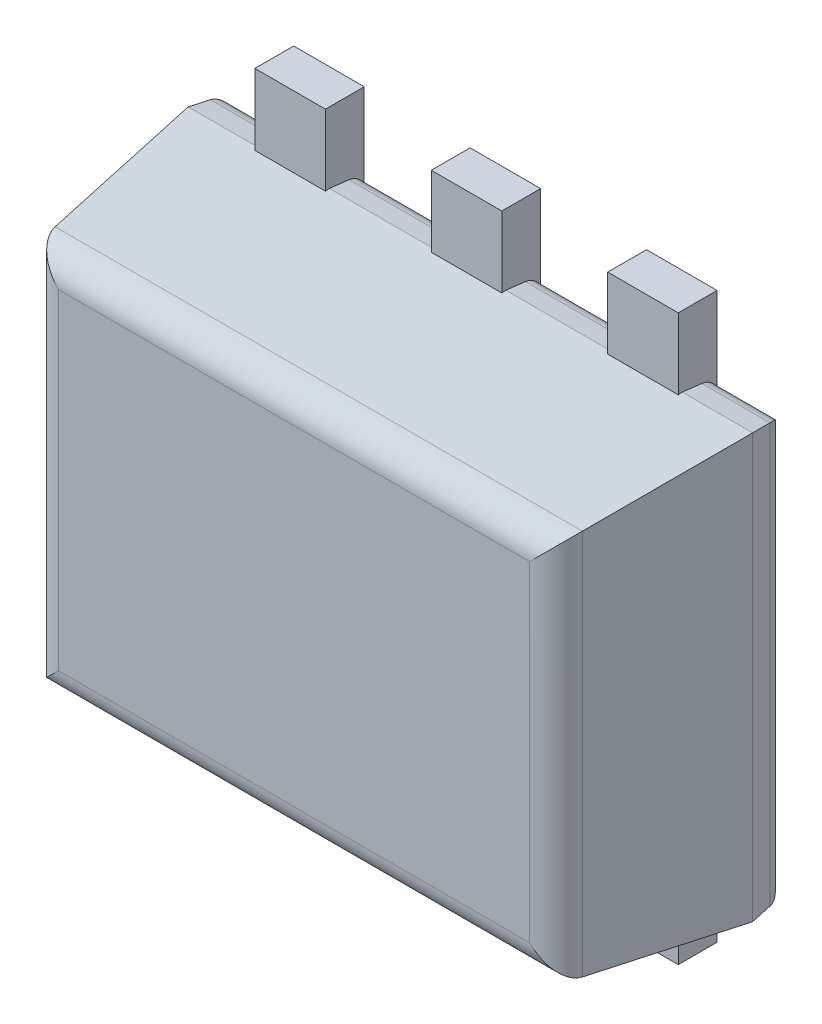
ISO-10303-21;
HEADER;
FILE_DESCRIPTION(('STEP AP214'),'2;1');
FILE_NAME('part.step','',(''),(''),'','','');
FILE_SCHEMA(('AUTOMOTIVE_DESIGN { 1 0 10303 214 1 1 1 1 }'));
ENDSEC;
DATA;
#1=APPLICATION_CONTEXT('core data for automotive mechanical design processes');
#2=APPLICATION_PROTOCOL_DEFINITION('international standard','automotive_design',2000,#1);
#3=PRODUCT_CONTEXT('',#1,'mechanical');
#4=PRODUCT('Part','Part','',(#3));
#5=PRODUCT_RELATED_PRODUCT_CATEGORY('part','',(#4));
#6=PRODUCT_DEFINITION_FORMATION('','',#4);
#7=PRODUCT_DEFINITION_CONTEXT('part definition',#1,'design');
#8=PRODUCT_DEFINITION('design','',#6,#7);
#9=PRODUCT_DEFINITION_SHAPE('','',#8);
#10=(LENGTH_UNIT() NAMED_UNIT(*) SI_UNIT(.MILLI.,.METRE.));
#11=(NAMED_UNIT(*) PLANE_ANGLE_UNIT() SI_UNIT($,.RADIAN.));
#12=(NAMED_UNIT(*) SI_UNIT($,.STERADIAN.) SOLID_ANGLE_UNIT());
#13=UNCERTAINTY_MEASURE_WITH_UNIT(LENGTH_MEASURE(1.E-05),#10,'distance_accuracy_value','');
#14=(GEOMETRIC_REPRESENTATION_CONTEXT(3) GLOBAL_UNCERTAINTY_ASSIGNED_CONTEXT((#13)) GLOBAL_UNIT_ASSIGNED_CONTEXT((#10,
#11,#12)) REPRESENTATION_CONTEXT('',''));
#15=CARTESIAN_POINT('',(0.,0.,0.));
#16=DIRECTION('',(0.,0.,1.));
#17=DIRECTION('',(1.,0.,0.));
#18=AXIS2_PLACEMENT_3D('',#15,#16,#17);
#19=CARTESIAN_POINT('',(2.899999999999,11.6520504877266,0.0900000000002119));
#20=DIRECTION('',(-0.992546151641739,6.8322092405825E-13,0.121869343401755));
#21=DIRECTION('',(6.88351793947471E-13,1.,0.));
#22=AXIS2_PLACEMENT_3D('',#19,#20,#21);
#23=PLANE('',#22);
#24=DIRECTION('',(-6.88343996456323E-13,-1.,0.));
#25=VECTOR('',#24,1.);
#26=CARTESIAN_POINT('',(2.899999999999,11.6520504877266,0.0900000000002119));
#27=LINE('',#26,#25);
#28=CARTESIAN_POINT('',(2.8999999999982,10.5000133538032,0.0900000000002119));
#29=VERTEX_POINT('',#28);
#30=CARTESIAN_POINT('',(2.89999999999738,9.30001335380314,0.090000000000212));
#31=VERTEX_POINT('',#30);
#32=EDGE_CURVE('P0_E11',#29,#31,#27,.T.);
#33=ORIENTED_EDGE('',*,*,#32,.T.);
#34=DIRECTION('',(0.120974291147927,-0.120974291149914,0.985256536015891));
#35=VECTOR('',#34,1.);
#36=CARTESIAN_POINT('',(2.85527382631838,9.34473952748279,-0.27426545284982));
#37=LINE('',#36,#35);
#38=CARTESIAN_POINT('',(2.89311258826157,9.30690076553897,0.0339065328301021));
#39=VERTEX_POINT('',#38);
#40=EDGE_CURVE('P0_E214',#39,#31,#37,.T.);
#41=ORIENTED_EDGE('',*,*,#40,.F.);
#42=DIRECTION('',(-6.88343996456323E-13,-1.,0.));
#43=VECTOR('',#42,1.);
#44=CARTESIAN_POINT('',(2.89311258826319,11.6520504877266,0.0339065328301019));
#45=LINE('',#44,#43);
#46=CARTESIAN_POINT('',(2.89311258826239,10.4931259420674,0.033906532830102));
#47=VERTEX_POINT('',#46);
#48=EDGE_CURVE('P0_E254',#47,#39,#45,.T.);
#49=ORIENTED_EDGE('',*,*,#48,.F.);
#50=DIRECTION('',(-0.120974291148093,-0.120974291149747,-0.985256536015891));
#51=VECTOR('',#50,1.);
#52=CARTESIAN_POINT('',(2.86206044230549,10.4620737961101,-0.2189929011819));
#53=LINE('',#52,#51);
#54=EDGE_CURVE('P0_E167',#29,#47,#53,.T.);
#55=ORIENTED_EDGE('',*,*,#54,.F.);
#56=EDGE_LOOP('',(#33,#41,#49,#55));
#57=FACE_BOUND('',#56,.T.);
#58=ADVANCED_FACE('P0_F17',(#57),#23,.F.);
#59=CARTESIAN_POINT('',(2.84723339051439,11.6520504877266,0.519749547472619));
#60=DIRECTION('',(-0.992546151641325,6.83205445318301E-13,-0.121869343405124));
#61=DIRECTION('',(-0.121869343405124,0.,0.992546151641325));
#62=AXIS2_PLACEMENT_3D('',#59,#60,#61);
#63=PLANE('',#62);
#64=ORIENTED_EDGE('',*,*,#32,.F.);
#65=DIRECTION('',(0.120974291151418,0.120974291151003,-0.985256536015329));
#66=VECTOR('',#65,1.);
#67=CARTESIAN_POINT('',(2.81006606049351,10.4100794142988,0.822453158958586));
#68=LINE('',#67,#66);
#69=CARTESIAN_POINT('',(2.84723339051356,10.4472467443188,0.519749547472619));
#70=VERTEX_POINT('',#69);
#71=EDGE_CURVE('P0_E160',#70,#29,#68,.T.);
#72=ORIENTED_EDGE('',*,*,#71,.F.);
#73=DIRECTION('',(-6.88343996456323E-13,-1.,0.));
#74=VECTOR('',#73,1.);
#75=CARTESIAN_POINT('',(2.84723339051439,11.6520504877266,0.519749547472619));
#76=LINE('',#75,#74);
#77=CARTESIAN_POINT('',(2.8472333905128,9.35277996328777,0.519749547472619));
#78=VERTEX_POINT('',#77);
#79=EDGE_CURVE('P0_E20',#70,#78,#76,.T.);
#80=ORIENTED_EDGE('',*,*,#79,.T.);
#81=DIRECTION('',(-0.120974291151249,0.120974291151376,0.985256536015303));
#82=VECTOR('',#81,1.);
#83=CARTESIAN_POINT('',(2.86206044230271,9.33795291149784,0.398992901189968));
#84=LINE('',#83,#82);
#85=EDGE_CURVE('P0_E231',#31,#78,#84,.T.);
#86=ORIENTED_EDGE('',*,*,#85,.F.);
#87=EDGE_LOOP('',(#64,#72,#80,#86));
#88=FACE_BOUND('',#87,.T.);
#89=ADVANCED_FACE('P0_F267',(#88),#63,.F.);
#90=CARTESIAN_POINT('',(2.76782969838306,11.6520504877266,0.510000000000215));
#91=DIRECTION('',(6.88343996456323E-13,1.,0.));
#92=DIRECTION('',(0.,0.,-1.));
#93=AXIS2_PLACEMENT_3D('',#90,#91,#92);
#94=CYLINDRICAL_SURFACE('',#93,0.0800000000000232);
#95=ORIENTED_EDGE('',*,*,#79,.F.);
#96=CARTESIAN_POINT('',(2.76782969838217,10.3678430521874,0.510000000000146));
#97=DIRECTION('',(-0.707106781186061,0.707106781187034,0.));
#98=DIRECTION('',(0.707106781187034,0.707106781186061,0.));
#99=AXIS2_PLACEMENT_3D('',#96,#97,#98);
#100=ELLIPSE('',#99,0.113137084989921,0.0800000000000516);
#101=CARTESIAN_POINT('',(2.76782969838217,10.3678430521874,0.590000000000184));
#102=VERTEX_POINT('',#101);
#103=EDGE_CURVE('P0_E135',#102,#70,#100,.T.);
#104=ORIENTED_EDGE('',*,*,#103,.F.);
#105=DIRECTION('',(-6.88343996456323E-13,-1.,0.));
#106=VECTOR('',#105,1.);
#107=CARTESIAN_POINT('',(2.76782969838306,11.6520504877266,0.590000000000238));
#108=LINE('',#107,#106);
#109=CARTESIAN_POINT('',(2.76782969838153,9.43218365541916,0.590000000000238));
#110=VERTEX_POINT('',#109);
#111=EDGE_CURVE('P0_E143',#102,#110,#108,.T.);
#112=ORIENTED_EDGE('',*,*,#111,.T.);
#113=CARTESIAN_POINT('',(2.76782969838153,9.43218365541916,0.510000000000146));
#114=DIRECTION('',(-0.707106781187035,-0.70710678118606,0.));
#115=DIRECTION('',(0.70710678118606,-0.707106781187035,0.));
#116=AXIS2_PLACEMENT_3D('',#113,#114,#115);
#117=ELLIPSE('',#116,0.113137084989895,0.0800000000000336);
#118=EDGE_CURVE('P0_E237',#78,#110,#117,.T.);
#119=ORIENTED_EDGE('',*,*,#118,.F.);
#120=EDGE_LOOP('',(#95,#104,#112,#119));
#121=FACE_BOUND('',#120,.T.);
#122=ADVANCED_FACE('P0_F269',(#121),#94,.T.);
#123=CARTESIAN_POINT('',(2.84348528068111,11.6520504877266,0.0400000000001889));
#124=DIRECTION('',(6.88343996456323E-13,1.,0.));
#125=DIRECTION('',(0.,0.,-1.));
#126=AXIS2_PLACEMENT_3D('',#123,#124,#125);
#127=CYLINDRICAL_SURFACE('',#126,0.0499999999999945);
#128=ORIENTED_EDGE('',*,*,#48,.T.);
#129=CARTESIAN_POINT('',(2.84348528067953,9.35652807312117,0.0400000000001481));
#130=DIRECTION('',(-0.707106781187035,-0.70710678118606,0.));
#131=DIRECTION('',(0.70710678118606,-0.707106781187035,0.));
#132=AXIS2_PLACEMENT_3D('',#129,#130,#131);
#133=ELLIPSE('',#132,0.0707106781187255,0.05000000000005);
#134=CARTESIAN_POINT('',(2.84348528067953,9.35652807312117,-0.00999999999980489));
#135=VERTEX_POINT('',#134);
#136=EDGE_CURVE('P0_E176',#135,#39,#133,.T.);
#137=ORIENTED_EDGE('',*,*,#136,.F.);
#138=DIRECTION('',(-6.88343996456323E-13,-1.,0.));
#139=VECTOR('',#138,1.);
#140=CARTESIAN_POINT('',(2.84348528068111,11.6520504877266,-0.00999999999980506));
#141=LINE('',#140,#139);
#142=CARTESIAN_POINT('',(2.84348528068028,10.4434986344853,-0.00999999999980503));
#143=VERTEX_POINT('',#142);
#144=EDGE_CURVE('P0_E145',#143,#135,#141,.T.);
#145=ORIENTED_EDGE('',*,*,#144,.F.);
#146=CARTESIAN_POINT('',(2.84348528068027,10.4434986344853,0.0400000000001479));
#147=DIRECTION('',(-0.707106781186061,0.707106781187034,0.));
#148=DIRECTION('',(0.707106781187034,0.707106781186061,0.));
#149=AXIS2_PLACEMENT_3D('',#146,#147,#148);
#150=ELLIPSE('',#149,0.0707106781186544,0.05);
#151=EDGE_CURVE('P0_E193',#47,#143,#150,.T.);
#152=ORIENTED_EDGE('',*,*,#151,.F.);
#153=EDGE_LOOP('',(#128,#137,#145,#152));
#154=FACE_BOUND('',#153,.T.);
#155=ADVANCED_FACE('P0_F311',(#154),#127,.T.);
#156=CARTESIAN_POINT('',(1.35276660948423,11.6520504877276,0.519749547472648));
#157=DIRECTION('',(0.992546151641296,-6.83220924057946E-13,-0.121869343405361));
#158=DIRECTION('',(0.,-1.,5.60617547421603E-12));
#159=AXIS2_PLACEMENT_3D('',#156,#157,#158);
#160=PLANE('',#159);
#161=DIRECTION('',(-6.88343996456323E-13,-1.,0.));
#162=VECTOR('',#161,1.);
#163=CARTESIAN_POINT('',(1.35276660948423,11.6520504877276,0.519749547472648));
#164=LINE('',#163,#162);
#165=CARTESIAN_POINT('',(1.3527666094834,10.4472467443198,0.519749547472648));
#166=VERTEX_POINT('',#165);
#167=CARTESIAN_POINT('',(1.35276660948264,9.3527799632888,0.519749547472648));
#168=VERTEX_POINT('',#167);
#169=EDGE_CURVE('P0_E49',#166,#168,#164,.T.);
#170=ORIENTED_EDGE('',*,*,#169,.F.);
#171=DIRECTION('',(0.120974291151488,-0.120974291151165,0.9852565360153));
#172=VECTOR('',#171,1.);
#173=CARTESIAN_POINT('',(1.3374704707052,10.4625428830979,0.395172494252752));
#174=LINE('',#173,#172);
#175=CARTESIAN_POINT('',(1.29999999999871,10.5000133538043,0.0900000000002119));
#176=VERTEX_POINT('',#175);
#177=EDGE_CURVE('P0_E244',#176,#166,#174,.T.);
#178=ORIENTED_EDGE('',*,*,#177,.F.);
#179=DIRECTION('',(-6.88343996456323E-13,-1.,0.));
#180=VECTOR('',#179,1.);
#181=CARTESIAN_POINT('',(1.29999999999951,11.6520504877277,0.0900000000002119));
#182=LINE('',#181,#180);
#183=CARTESIAN_POINT('',(1.29999999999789,9.30001335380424,0.0900000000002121));
#184=VERTEX_POINT('',#183);
#185=EDGE_CURVE('P0_E249',#176,#184,#182,.T.);
#186=ORIENTED_EDGE('',*,*,#185,.T.);
#187=DIRECTION('',(-0.120974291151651,-0.120974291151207,-0.985256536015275));
#188=VECTOR('',#187,1.);
#189=CARTESIAN_POINT('',(1.28547608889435,9.28548944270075,-0.0282877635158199));
#190=LINE('',#189,#188);
#191=EDGE_CURVE('P0_E213',#168,#184,#190,.T.);
#192=ORIENTED_EDGE('',*,*,#191,.F.);
#193=EDGE_LOOP('',(#170,#178,#186,#192));
#194=FACE_BOUND('',#193,.T.);
#195=ADVANCED_FACE('P0_F276',(#194),#160,.F.);
#196=CARTESIAN_POINT('',(1.43217030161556,11.6520504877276,0.510000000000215));
#197=DIRECTION('',(6.88343996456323E-13,1.,0.));
#198=DIRECTION('',(0.,0.,-1.));
#199=AXIS2_PLACEMENT_3D('',#196,#197,#198);
#200=CYLINDRICAL_SURFACE('',#199,0.0799999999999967);
#201=DIRECTION('',(-6.88343996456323E-13,-1.,0.));
#202=VECTOR('',#201,1.);
#203=CARTESIAN_POINT('',(1.43217030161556,11.6520504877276,0.590000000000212));
#204=LINE('',#203,#202);
#205=CARTESIAN_POINT('',(1.43217030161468,10.3678430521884,0.590000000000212));
#206=VERTEX_POINT('',#205);
#207=CARTESIAN_POINT('',(1.43217030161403,9.43218365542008,0.590000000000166));
#208=VERTEX_POINT('',#207);
#209=EDGE_CURVE('P0_E141',#206,#208,#204,.T.);
#210=ORIENTED_EDGE('',*,*,#209,.F.);
#211=CARTESIAN_POINT('',(1.43217030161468,10.3678430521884,0.510000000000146));
#212=DIRECTION('',(0.707106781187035,0.70710678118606,0.));
#213=DIRECTION('',(0.70710678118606,-0.707106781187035,0.));
#214=AXIS2_PLACEMENT_3D('',#211,#212,#213);
#215=ELLIPSE('',#214,0.113137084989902,0.0800000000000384);
#216=EDGE_CURVE('P0_E124',#166,#206,#215,.T.);
#217=ORIENTED_EDGE('',*,*,#216,.F.);
#218=ORIENTED_EDGE('',*,*,#169,.T.);
#219=CARTESIAN_POINT('',(1.43217030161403,9.43218365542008,0.510000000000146));
#220=DIRECTION('',(0.707106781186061,-0.707106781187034,0.));
#221=DIRECTION('',(0.707106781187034,0.707106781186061,0.));
#222=AXIS2_PLACEMENT_3D('',#219,#220,#221);
#223=ELLIPSE('',#222,0.113137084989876,0.0800000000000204);
#224=EDGE_CURVE('P0_E149',#208,#168,#223,.T.);
#225=ORIENTED_EDGE('',*,*,#224,.F.);
#226=EDGE_LOOP('',(#210,#217,#218,#225));
#227=FACE_BOUND('',#226,.T.);
#228=ADVANCED_FACE('P0_F147',(#227),#200,.T.);
#229=CARTESIAN_POINT('',(1.35651471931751,11.6520504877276,0.0400000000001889));
#230=DIRECTION('',(6.88343996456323E-13,1.,0.));
#231=DIRECTION('',(0.,0.,-1.));
#232=AXIS2_PLACEMENT_3D('',#229,#230,#231);
#233=CYLINDRICAL_SURFACE('',#232,0.0499999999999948);
#234=DIRECTION('',(-6.88343996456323E-13,-1.,0.));
#235=VECTOR('',#234,1.);
#236=CARTESIAN_POINT('',(1.35651471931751,11.6520504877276,-0.0099999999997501));
#237=LINE('',#236,#235);
#238=CARTESIAN_POINT('',(1.35651471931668,10.4434986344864,-0.00999999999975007));
#239=VERTEX_POINT('',#238);
#240=CARTESIAN_POINT('',(1.35651471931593,9.35652807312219,-0.00999999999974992));
#241=VERTEX_POINT('',#240);
#242=EDGE_CURVE('P0_E181',#239,#241,#237,.T.);
#243=ORIENTED_EDGE('',*,*,#242,.T.);
#244=CARTESIAN_POINT('',(1.35651471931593,9.35652807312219,0.0400000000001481));
#245=DIRECTION('',(0.707106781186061,-0.707106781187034,0.));
#246=DIRECTION('',(0.707106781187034,0.707106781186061,0.));
#247=AXIS2_PLACEMENT_3D('',#244,#245,#246);
#248=ELLIPSE('',#247,0.0707106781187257,0.0500000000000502);
#249=CARTESIAN_POINT('',(1.30688741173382,9.30690076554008,0.0339065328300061));
#250=VERTEX_POINT('',#249);
#251=EDGE_CURVE('P0_E175',#250,#241,#248,.T.);
#252=ORIENTED_EDGE('',*,*,#251,.F.);
#253=DIRECTION('',(-6.88343996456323E-13,-1.,0.));
#254=VECTOR('',#253,1.);
#255=CARTESIAN_POINT('',(1.30688741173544,11.6520504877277,0.0339065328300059));
#256=LINE('',#255,#254);
#257=CARTESIAN_POINT('',(1.30688741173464,10.4931259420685,0.0339065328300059));
#258=VERTEX_POINT('',#257);
#259=EDGE_CURVE('P0_E247',#258,#250,#256,.T.);
#260=ORIENTED_EDGE('',*,*,#259,.F.);
#261=CARTESIAN_POINT('',(1.35651471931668,10.4434986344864,0.0400000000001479));
#262=DIRECTION('',(0.707106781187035,0.70710678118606,0.));
#263=DIRECTION('',(0.70710678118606,-0.707106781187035,0.));
#264=AXIS2_PLACEMENT_3D('',#261,#262,#263);
#265=ELLIPSE('',#264,0.0707106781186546,0.05);
#266=EDGE_CURVE('P0_E203',#239,#258,#265,.T.);
#267=ORIENTED_EDGE('',*,*,#266,.F.);
#268=EDGE_LOOP('',(#243,#252,#260,#267));
#269=FACE_BOUND('',#268,.T.);
#270=ADVANCED_FACE('P0_F318',(#269),#233,.T.);
#271=CARTESIAN_POINT('',(1.29999999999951,11.6520504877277,0.0900000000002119));
#272=DIRECTION('',(0.992546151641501,-6.83205445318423E-13,0.12186934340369));
#273=DIRECTION('',(0.,-1.,-5.60604846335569E-12));
#274=AXIS2_PLACEMENT_3D('',#271,#272,#273);
#275=PLANE('',#274);
#276=ORIENTED_EDGE('',*,*,#259,.T.);
#277=DIRECTION('',(0.120974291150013,0.12097429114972,-0.985256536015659));
#278=VECTOR('',#277,1.);
#279=CARTESIAN_POINT('',(1.29226270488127,9.29227605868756,0.153015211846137));
#280=LINE('',#279,#278);
#281=EDGE_CURVE('P0_E221',#184,#250,#280,.T.);
#282=ORIENTED_EDGE('',*,*,#281,.F.);
#283=ORIENTED_EDGE('',*,*,#185,.F.);
#284=DIRECTION('',(-0.120974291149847,0.120974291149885,0.985256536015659));
#285=VECTOR('',#284,1.);
#286=CARTESIAN_POINT('',(1.28547608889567,10.5145372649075,0.208287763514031));
#287=LINE('',#286,#285);
#288=EDGE_CURVE('P0_E168',#258,#176,#287,.T.);
#289=ORIENTED_EDGE('',*,*,#288,.F.);
#290=EDGE_LOOP('',(#276,#282,#283,#289));
#291=FACE_BOUND('',#290,.T.);
#292=ADVANCED_FACE('P0_F279',(#291),#275,.F.);
#293=CARTESIAN_POINT('',(0.307575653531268,10.4472467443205,0.519749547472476));
#294=DIRECTION('',(-6.83207302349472E-13,-0.992546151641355,-0.121869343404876));
#295=DIRECTION('',(0.,0.121869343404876,-0.992546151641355));
#296=AXIS2_PLACEMENT_3D('',#293,#294,#295);
#297=PLANE('',#296);
#298=DIRECTION('',(1.,-6.88343996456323E-13,0.));
#299=VECTOR('',#298,1.);
#300=CARTESIAN_POINT('',(0.307575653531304,10.5000133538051,0.0899999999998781));
#301=LINE('',#300,#299);
#302=EDGE_CURVE('P0_E163',#176,#29,#301,.T.);
#303=ORIENTED_EDGE('',*,*,#302,.F.);
#304=ORIENTED_EDGE('',*,*,#177,.T.);
#305=DIRECTION('',(1.,-6.88343996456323E-13,0.));
#306=VECTOR('',#305,1.);
#307=CARTESIAN_POINT('',(0.307575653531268,10.4472467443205,0.519749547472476));
#308=LINE('',#307,#306);
#309=EDGE_CURVE('P0_E131',#166,#70,#308,.T.);
#310=ORIENTED_EDGE('',*,*,#309,.T.);
#311=ORIENTED_EDGE('',*,*,#71,.T.);
#312=EDGE_LOOP('',(#303,#304,#310,#311));
#313=FACE_BOUND('',#312,.T.);
#314=ADVANCED_FACE('P0_F289',(#313),#297,.F.);
#315=CARTESIAN_POINT('',(0.307575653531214,10.3678430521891,0.510000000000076));
#316=DIRECTION('',(-1.,6.88343996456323E-13,0.));
#317=DIRECTION('',(0.,0.,-1.));
#318=AXIS2_PLACEMENT_3D('',#315,#316,#317);
#319=CYLINDRICAL_SURFACE('',#318,0.08000000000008);
#320=ORIENTED_EDGE('',*,*,#309,.F.);
#321=ORIENTED_EDGE('',*,*,#216,.T.);
#322=DIRECTION('',(-1.,6.88343996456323E-13,0.));
#323=VECTOR('',#322,1.);
#324=CARTESIAN_POINT('',(0.307575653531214,10.3678430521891,0.590000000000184));
#325=LINE('',#324,#323);
#326=EDGE_CURVE('P0_E128',#102,#206,#325,.T.);
#327=ORIENTED_EDGE('',*,*,#326,.F.);
#328=ORIENTED_EDGE('',*,*,#103,.T.);
#329=EDGE_LOOP('',(#320,#321,#327,#328));
#330=FACE_BOUND('',#329,.T.);
#331=ADVANCED_FACE('P0_F126',(#330),#319,.T.);
#332=CARTESIAN_POINT('',(0.307575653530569,9.43218365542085,0.510000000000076));
#333=DIRECTION('',(-1.,6.88343996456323E-13,0.));
#334=DIRECTION('',(0.,0.,-1.));
#335=AXIS2_PLACEMENT_3D('',#332,#333,#334);
#336=CYLINDRICAL_SURFACE('',#335,0.080000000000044);
#337=DIRECTION('',(-1.,6.88343996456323E-13,0.));
#338=VECTOR('',#337,1.);
#339=CARTESIAN_POINT('',(0.307575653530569,9.43218365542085,0.590000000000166));
#340=LINE('',#339,#338);
#341=EDGE_CURVE('P0_E152',#110,#208,#340,.T.);
#342=ORIENTED_EDGE('',*,*,#341,.T.);
#343=ORIENTED_EDGE('',*,*,#224,.T.);
#344=DIRECTION('',(1.,-6.88343996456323E-13,0.));
#345=VECTOR('',#344,1.);
#346=CARTESIAN_POINT('',(0.307575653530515,9.3527799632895,0.519749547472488));
#347=LINE('',#346,#345);
#348=EDGE_CURVE('P0_E209',#168,#78,#347,.T.);
#349=ORIENTED_EDGE('',*,*,#348,.T.);
#350=ORIENTED_EDGE('',*,*,#118,.T.);
#351=EDGE_LOOP('',(#342,#343,#349,#350));
#352=FACE_BOUND('',#351,.T.);
#353=ADVANCED_FACE('P0_F275',(#352),#336,.T.);
#354=CARTESIAN_POINT('',(0.307575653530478,9.30001335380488,0.0899999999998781));
#355=DIRECTION('',(6.8321906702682E-13,0.99254615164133,-0.121869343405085));
#356=DIRECTION('',(-1.,0.,-5.60616023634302E-12));
#357=AXIS2_PLACEMENT_3D('',#354,#355,#356);
#358=PLANE('',#357);
#359=ORIENTED_EDGE('',*,*,#348,.F.);
#360=ORIENTED_EDGE('',*,*,#191,.T.);
#361=DIRECTION('',(1.,-6.88343996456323E-13,0.));
#362=VECTOR('',#361,1.);
#363=CARTESIAN_POINT('',(0.307575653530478,9.30001335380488,0.0899999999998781));
#364=LINE('',#363,#362);
#365=EDGE_CURVE('P0_E217',#184,#31,#364,.T.);
#366=ORIENTED_EDGE('',*,*,#365,.T.);
#367=ORIENTED_EDGE('',*,*,#85,.T.);
#368=EDGE_LOOP('',(#359,#360,#366,#367));
#369=FACE_BOUND('',#368,.T.);
#370=ADVANCED_FACE('P0_F273',(#369),#358,.F.);
#371=CARTESIAN_POINT('',(0.307575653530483,9.30690076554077,0.0339065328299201));
#372=DIRECTION('',(6.83207302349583E-13,0.992546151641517,0.121869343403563));
#373=DIRECTION('',(1.,0.,-5.60606370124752E-12));
#374=AXIS2_PLACEMENT_3D('',#371,#372,#373);
#375=PLANE('',#374);
#376=ORIENTED_EDGE('',*,*,#365,.F.);
#377=ORIENTED_EDGE('',*,*,#281,.T.);
#378=DIRECTION('',(1.,-6.88343996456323E-13,0.));
#379=VECTOR('',#378,1.);
#380=CARTESIAN_POINT('',(0.307575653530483,9.30690076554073,0.0339065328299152));
#381=LINE('',#380,#379);
#382=EDGE_CURVE('P0_E171',#250,#39,#381,.T.);
#383=ORIENTED_EDGE('',*,*,#382,.T.);
#384=ORIENTED_EDGE('',*,*,#40,.T.);
#385=EDGE_LOOP('',(#376,#377,#383,#384));
#386=FACE_BOUND('',#385,.T.);
#387=ADVANCED_FACE('P0_F283',(#386),#375,.F.);
#388=CARTESIAN_POINT('',(0.307575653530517,9.35652807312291,0.0400000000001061));
#389=DIRECTION('',(-1.,6.88343996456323E-13,0.));
#390=DIRECTION('',(0.,0.,-1.));
#391=AXIS2_PLACEMENT_3D('',#388,#389,#390);
#392=CYLINDRICAL_SURFACE('',#391,0.0500000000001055);
#393=DIRECTION('',(1.,-6.88343996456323E-13,0.));
#394=VECTOR('',#393,1.);
#395=CARTESIAN_POINT('',(0.307575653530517,9.35652807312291,-0.01));
#396=LINE('',#395,#394);
#397=EDGE_CURVE('P0_E180',#241,#135,#396,.T.);
#398=ORIENTED_EDGE('',*,*,#397,.T.);
#399=ORIENTED_EDGE('',*,*,#136,.T.);
#400=ORIENTED_EDGE('',*,*,#382,.F.);
#401=ORIENTED_EDGE('',*,*,#251,.T.);
#402=EDGE_LOOP('',(#398,#399,#400,#401));
#403=FACE_BOUND('',#402,.T.);
#404=ADVANCED_FACE('P0_F305',(#403),#392,.T.);
#405=CARTESIAN_POINT('',(0.307575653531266,10.4434986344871,0.0400000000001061));
#406=DIRECTION('',(-1.,6.88343996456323E-13,0.));
#407=DIRECTION('',(0.,0.,-1.));
#408=AXIS2_PLACEMENT_3D('',#405,#406,#407);
#409=CYLINDRICAL_SURFACE('',#408,0.050000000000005);
#410=DIRECTION('',(1.,-6.88343996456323E-13,0.));
#411=VECTOR('',#410,1.);
#412=CARTESIAN_POINT('',(0.3075756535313,10.4931259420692,0.0339065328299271));
#413=LINE('',#412,#411);
#414=EDGE_CURVE('P0_E189',#258,#47,#413,.T.);
#415=ORIENTED_EDGE('',*,*,#414,.T.);
#416=ORIENTED_EDGE('',*,*,#151,.T.);
#417=DIRECTION('',(1.,-6.88343996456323E-13,0.));
#418=VECTOR('',#417,1.);
#419=CARTESIAN_POINT('',(0.307575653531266,10.4434986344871,-0.01));
#420=LINE('',#419,#418);
#421=EDGE_CURVE('P0_E185',#239,#143,#420,.T.);
#422=ORIENTED_EDGE('',*,*,#421,.F.);
#423=ORIENTED_EDGE('',*,*,#266,.T.);
#424=EDGE_LOOP('',(#415,#416,#422,#423));
#425=FACE_BOUND('',#424,.T.);
#426=ADVANCED_FACE('P0_F316',(#425),#409,.T.);
#427=CARTESIAN_POINT('',(0.307575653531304,10.5000133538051,0.0899999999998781));
#428=DIRECTION('',(-6.83219067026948E-13,-0.992546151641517,0.121869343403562));
#429=DIRECTION('',(-1.,6.88349922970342E-13,0.));
#430=AXIS2_PLACEMENT_3D('',#427,#428,#429);
#431=PLANE('',#430);
#432=ORIENTED_EDGE('',*,*,#414,.F.);
#433=ORIENTED_EDGE('',*,*,#288,.T.);
#434=ORIENTED_EDGE('',*,*,#302,.T.);
#435=ORIENTED_EDGE('',*,*,#54,.T.);
#436=EDGE_LOOP('',(#432,#433,#434,#435));
#437=FACE_BOUND('',#436,.T.);
#438=ADVANCED_FACE('P0_F315',(#437),#431,.F.);
#439=CARTESIAN_POINT('',(0.307575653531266,10.4434986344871,-0.01));
#440=DIRECTION('',(0.,0.,1.));
#441=DIRECTION('',(1.,0.,0.));
#442=AXIS2_PLACEMENT_3D('',#439,#440,#441);
#443=PLANE('',#442);
#444=ORIENTED_EDGE('',*,*,#144,.T.);
#445=ORIENTED_EDGE('',*,*,#397,.F.);
#446=ORIENTED_EDGE('',*,*,#242,.F.);
#447=ORIENTED_EDGE('',*,*,#421,.T.);
#448=EDGE_LOOP('',(#444,#445,#446,#447));
#449=FACE_BOUND('',#448,.T.);
#450=ADVANCED_FACE('P0_F309',(#449),#443,.F.);
#451=CARTESIAN_POINT('',(2.21151313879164,9.90522856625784,0.590000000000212));
#452=DIRECTION('',(0.,0.,-1.));
#453=DIRECTION('',(-1.,0.,0.));
#454=AXIS2_PLACEMENT_3D('',#451,#452,#453);
#455=PLANE('',#454);
#456=ORIENTED_EDGE('',*,*,#209,.T.);
#457=ORIENTED_EDGE('',*,*,#341,.F.);
#458=ORIENTED_EDGE('',*,*,#111,.F.);
#459=ORIENTED_EDGE('',*,*,#326,.T.);
#460=EDGE_LOOP('',(#456,#457,#458,#459));
#461=FACE_BOUND('',#460,.T.);
#462=ADVANCED_FACE('P0_F139',(#461),#455,.F.);
#463=CLOSED_SHELL('',(#58,#89,#122,#155,#195,#228,#270,#292,#314,#331,#353,#370,#387,#404,#426,
#438,#450,#462));
#464=MANIFOLD_SOLID_BREP('P0_B1',#463);
#465=CARTESIAN_POINT('',(2.19999999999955,10.7,-0.752358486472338));
#466=DIRECTION('',(-1.,0.,0.));
#467=DIRECTION('',(0.,1.,0.));
#468=AXIS2_PLACEMENT_3D('',#465,#466,#467);
#469=PLANE('',#468);
#470=DIRECTION('',(0.,0.,1.));
#471=VECTOR('',#470,1.);
#472=CARTESIAN_POINT('',(2.19999999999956,10.3499999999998,-0.752358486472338));
#473=LINE('',#472,#471);
#474=CARTESIAN_POINT('',(2.19999999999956,10.3499999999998,0.090900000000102));
#475=VERTEX_POINT('',#474);
#476=CARTESIAN_POINT('',(2.19999999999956,10.3499999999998,0.2009));
#477=VERTEX_POINT('',#476);
#478=EDGE_CURVE('P1_E133',#475,#477,#473,.T.);
#479=ORIENTED_EDGE('',*,*,#478,.F.);
#480=DIRECTION('',(0.,1.,0.));
#481=VECTOR('',#480,1.);
#482=CARTESIAN_POINT('',(2.19999999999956,10.2236637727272,0.090900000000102));
#483=LINE('',#482,#481);
#484=CARTESIAN_POINT('',(2.19999999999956,10.2999999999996,0.090900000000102));
#485=VERTEX_POINT('',#484);
#486=EDGE_CURVE('P1_E127',#485,#475,#483,.T.);
#487=ORIENTED_EDGE('',*,*,#486,.F.);
#488=DIRECTION('',(0.,0.447213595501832,-0.894427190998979));
#489=VECTOR('',#488,1.);
#490=CARTESIAN_POINT('',(2.19999999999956,10.3499999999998,-0.00909999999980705));
#491=LINE('',#490,#489);
#492=CARTESIAN_POINT('',(2.19999999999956,10.3499999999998,-0.00909999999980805));
#493=VERTEX_POINT('',#492);
#494=EDGE_CURVE('P1_E131',#485,#493,#491,.T.);
#495=ORIENTED_EDGE('',*,*,#494,.T.);
#496=DIRECTION('',(0.,-1.,0.));
#497=VECTOR('',#496,1.);
#498=CARTESIAN_POINT('',(2.19999999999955,10.7,-0.00909999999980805));
#499=LINE('',#498,#497);
#500=CARTESIAN_POINT('',(2.19999999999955,10.7,-0.00909999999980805));
#501=VERTEX_POINT('',#500);
#502=EDGE_CURVE('P1_E171',#501,#493,#499,.T.);
#503=ORIENTED_EDGE('',*,*,#502,.F.);
#504=DIRECTION('',(0.,0.,1.));
#505=VECTOR('',#504,1.);
#506=CARTESIAN_POINT('',(2.19999999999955,10.7,-0.752358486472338));
#507=LINE('',#506,#505);
#508=CARTESIAN_POINT('',(2.19999999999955,10.7,0.100900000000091));
#509=VERTEX_POINT('',#508);
#510=EDGE_CURVE('P1_E218',#501,#509,#507,.T.);
#511=ORIENTED_EDGE('',*,*,#510,.T.);
#512=DIRECTION('',(0.,1.,0.));
#513=VECTOR('',#512,1.);
#514=CARTESIAN_POINT('',(2.19999999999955,10.3999999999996,0.100900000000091));
#515=LINE('',#514,#513);
#516=CARTESIAN_POINT('',(2.19999999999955,10.3999999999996,0.100900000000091));
#517=VERTEX_POINT('',#516);
#518=EDGE_CURVE('P1_E196',#517,#509,#515,.T.);
#519=ORIENTED_EDGE('',*,*,#518,.F.);
#520=DIRECTION('',(0.,0.447213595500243,-0.894427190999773));
#521=VECTOR('',#520,1.);
#522=CARTESIAN_POINT('',(2.19999999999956,10.3499999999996,0.200899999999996));
#523=LINE('',#522,#521);
#524=EDGE_CURVE('P1_E246',#477,#517,#523,.T.);
#525=ORIENTED_EDGE('',*,*,#524,.F.);
#526=EDGE_LOOP('',(#479,#487,#495,#503,#511,#519,#525));
#527=FACE_BOUND('',#526,.T.);
#528=ADVANCED_FACE('P1_F17',(#527),#469,.F.);
#529=CARTESIAN_POINT('',(1.99999999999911,10.3499999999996,-0.752358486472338));
#530=DIRECTION('',(1.,-1.42749083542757E-12,0.));
#531=DIRECTION('',(-1.42749083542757E-12,-1.,0.));
#532=AXIS2_PLACEMENT_3D('',#529,#530,#531);
#533=PLANE('',#532);
#534=DIRECTION('',(-1.42749083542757E-12,-1.,0.));
#535=VECTOR('',#534,1.);
#536=CARTESIAN_POINT('',(1.99999999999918,10.3999999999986,0.100900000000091));
#537=LINE('',#536,#535);
#538=CARTESIAN_POINT('',(1.99999999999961,10.7,0.100900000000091));
#539=VERTEX_POINT('',#538);
#540=CARTESIAN_POINT('',(1.99999999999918,10.3999999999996,0.100900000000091));
#541=VERTEX_POINT('',#540);
#542=EDGE_CURVE('P1_E199',#539,#541,#537,.T.);
#543=ORIENTED_EDGE('',*,*,#542,.F.);
#544=DIRECTION('',(0.,0.,1.));
#545=VECTOR('',#544,1.);
#546=CARTESIAN_POINT('',(1.99999999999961,10.7,-0.752358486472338));
#547=LINE('',#546,#545);
#548=CARTESIAN_POINT('',(1.99999999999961,10.7,-0.00909999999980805));
#549=VERTEX_POINT('',#548);
#550=EDGE_CURVE('P1_E222',#549,#539,#547,.T.);
#551=ORIENTED_EDGE('',*,*,#550,.F.);
#552=DIRECTION('',(1.42749083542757E-12,1.,0.));
#553=VECTOR('',#552,1.);
#554=CARTESIAN_POINT('',(1.99999999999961,10.6999999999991,-0.00909999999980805));
#555=LINE('',#554,#553);
#556=CARTESIAN_POINT('',(1.99999999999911,10.3499999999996,-0.00909999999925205));
#557=VERTEX_POINT('',#556);
#558=EDGE_CURVE('P1_E210',#557,#549,#555,.T.);
#559=ORIENTED_EDGE('',*,*,#558,.F.);
#560=DIRECTION('',(0.,0.,1.));
#561=VECTOR('',#560,1.);
#562=CARTESIAN_POINT('',(1.99999999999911,10.3499999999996,-0.752358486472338));
#563=LINE('',#562,#561);
#564=CARTESIAN_POINT('',(1.99999999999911,10.3499999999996,0.2009));
#565=VERTEX_POINT('',#564);
#566=EDGE_CURVE('P1_E20',#557,#565,#563,.T.);
#567=ORIENTED_EDGE('',*,*,#566,.T.);
#568=DIRECTION('',(-6.38338541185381E-13,-0.447213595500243,0.894427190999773));
#569=VECTOR('',#568,1.);
#570=CARTESIAN_POINT('',(1.99999999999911,10.3499999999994,0.200900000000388));
#571=LINE('',#570,#569);
#572=EDGE_CURVE('P1_E174',#541,#565,#571,.T.);
#573=ORIENTED_EDGE('',*,*,#572,.F.);
#574=EDGE_LOOP('',(#543,#551,#559,#567,#573));
#575=FACE_BOUND('',#574,.T.);
#576=ADVANCED_FACE('P1_F283',(#575),#533,.F.);
#577=CARTESIAN_POINT('',(2.33999999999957,10.1499999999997,-0.752358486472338));
#578=DIRECTION('',(0.,1.,0.));
#579=DIRECTION('',(1.,0.,0.));
#580=AXIS2_PLACEMENT_3D('',#577,#578,#579);
#581=PLANE('',#580);
#582=DIRECTION('',(0.,0.,1.));
#583=VECTOR('',#582,1.);
#584=CARTESIAN_POINT('',(2.33999999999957,10.1499999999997,-0.752358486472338));
#585=LINE('',#584,#583);
#586=CARTESIAN_POINT('',(2.33999999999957,10.1499999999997,0.090900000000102));
#587=VERTEX_POINT('',#586);
#588=CARTESIAN_POINT('',(2.33999999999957,10.1499999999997,0.2009));
#589=VERTEX_POINT('',#588);
#590=EDGE_CURVE('P1_E189',#587,#589,#585,.T.);
#591=ORIENTED_EDGE('',*,*,#590,.T.);
#592=DIRECTION('',(-1.,0.,0.));
#593=VECTOR('',#592,1.);
#594=CARTESIAN_POINT('',(2.33999999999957,10.1499999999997,0.2009));
#595=LINE('',#594,#593);
#596=CARTESIAN_POINT('',(2.09999999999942,10.1499999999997,0.2009));
#597=VERTEX_POINT('',#596);
#598=EDGE_CURVE('P1_E232',#589,#597,#595,.T.);
#599=ORIENTED_EDGE('',*,*,#598,.T.);
#600=DIRECTION('',(0.,0.,1.));
#601=VECTOR('',#600,1.);
#602=CARTESIAN_POINT('',(2.09999999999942,10.1499999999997,-0.752358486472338));
#603=LINE('',#602,#601);
#604=CARTESIAN_POINT('',(2.09999999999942,10.1499999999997,0.090900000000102));
#605=VERTEX_POINT('',#604);
#606=EDGE_CURVE('P1_E11',#605,#597,#603,.T.);
#607=ORIENTED_EDGE('',*,*,#606,.F.);
#608=DIRECTION('',(-1.,0.,0.));
#609=VECTOR('',#608,1.);
#610=CARTESIAN_POINT('',(1.31999999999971,10.1499999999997,0.090900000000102));
#611=LINE('',#610,#609);
#612=EDGE_CURVE('P1_E137',#587,#605,#611,.T.);
#613=ORIENTED_EDGE('',*,*,#612,.F.);
#614=EDGE_LOOP('',(#591,#599,#607,#613));
#615=FACE_BOUND('',#614,.T.);
#616=ADVANCED_FACE('P1_F271',(#615),#581,.F.);
#617=CARTESIAN_POINT('',(2.09999999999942,10.1499999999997,-0.752358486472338));
#618=DIRECTION('',(1.,0.,0.));
#619=DIRECTION('',(0.,0.,-1.));
#620=AXIS2_PLACEMENT_3D('',#617,#618,#619);
#621=PLANE('',#620);
#622=ORIENTED_EDGE('',*,*,#606,.T.);
#623=DIRECTION('',(0.,1.,0.));
#624=VECTOR('',#623,1.);
#625=CARTESIAN_POINT('',(2.09999999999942,10.1499999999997,0.2009));
#626=LINE('',#625,#624);
#627=CARTESIAN_POINT('',(2.09999999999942,10.2499999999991,0.2009));
#628=VERTEX_POINT('',#627);
#629=EDGE_CURVE('P1_E243',#597,#628,#626,.T.);
#630=ORIENTED_EDGE('',*,*,#629,.T.);
#631=DIRECTION('',(0.,0.,1.));
#632=VECTOR('',#631,1.);
#633=CARTESIAN_POINT('',(2.09999999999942,10.2499999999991,-0.752358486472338));
#634=LINE('',#633,#632);
#635=CARTESIAN_POINT('',(2.09999999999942,10.2499999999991,0.090900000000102));
#636=VERTEX_POINT('',#635);
#637=EDGE_CURVE('P1_E39',#636,#628,#634,.T.);
#638=ORIENTED_EDGE('',*,*,#637,.F.);
#639=DIRECTION('',(0.,1.,0.));
#640=VECTOR('',#639,1.);
#641=CARTESIAN_POINT('',(2.09999999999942,10.2999999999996,0.090900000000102));
#642=LINE('',#641,#640);
#643=EDGE_CURVE('P1_E163',#605,#636,#642,.T.);
#644=ORIENTED_EDGE('',*,*,#643,.F.);
#645=EDGE_LOOP('',(#622,#630,#638,#644));
#646=FACE_BOUND('',#645,.T.);
#647=ADVANCED_FACE('P1_F274',(#646),#621,.F.);
#648=CARTESIAN_POINT('',(2.09999999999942,10.2499999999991,-0.752358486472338));
#649=DIRECTION('',(0.707106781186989,0.707106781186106,0.));
#650=DIRECTION('',(0.,0.,-1.));
#651=AXIS2_PLACEMENT_3D('',#648,#649,#650);
#652=PLANE('',#651);
#653=DIRECTION('',(-0.707106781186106,0.707106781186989,0.));
#654=VECTOR('',#653,1.);
#655=CARTESIAN_POINT('',(1.68499999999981,10.6649999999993,0.090900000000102));
#656=LINE('',#655,#654);
#657=CARTESIAN_POINT('',(2.04999999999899,10.2999999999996,0.090900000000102));
#658=VERTEX_POINT('',#657);
#659=EDGE_CURVE('P1_E144',#636,#658,#656,.T.);
#660=ORIENTED_EDGE('',*,*,#659,.F.);
#661=ORIENTED_EDGE('',*,*,#637,.T.);
#662=DIRECTION('',(-0.707106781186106,0.707106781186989,0.));
#663=VECTOR('',#662,1.);
#664=CARTESIAN_POINT('',(2.09999999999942,10.2499999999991,0.2009));
#665=LINE('',#664,#663);
#666=EDGE_CURVE('P1_E240',#628,#565,#665,.T.);
#667=ORIENTED_EDGE('',*,*,#666,.T.);
#668=ORIENTED_EDGE('',*,*,#566,.F.);
#669=DIRECTION('',(-0.408248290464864,0.408248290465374,-0.81649658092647));
#670=VECTOR('',#669,1.);
#671=CARTESIAN_POINT('',(1.88666666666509,10.4633333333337,-0.235766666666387));
#672=LINE('',#671,#670);
#673=EDGE_CURVE('P1_E149',#658,#557,#672,.T.);
#674=ORIENTED_EDGE('',*,*,#673,.F.);
#675=EDGE_LOOP('',(#660,#661,#667,#668,#674));
#676=FACE_BOUND('',#675,.T.);
#677=ADVANCED_FACE('P1_F258',(#676),#652,.F.);
#678=CARTESIAN_POINT('',(1.31999999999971,10.3499999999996,0.2009));
#679=DIRECTION('',(0.,-0.894427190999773,-0.447213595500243));
#680=DIRECTION('',(0.,0.447213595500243,-0.894427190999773));
#681=AXIS2_PLACEMENT_3D('',#678,#679,#680);
#682=PLANE('',#681);
#683=DIRECTION('',(1.,0.,0.));
#684=VECTOR('',#683,1.);
#685=CARTESIAN_POINT('',(1.31999999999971,10.3499999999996,0.2009));
#686=LINE('',#685,#684);
#687=EDGE_CURVE('P1_E236',#565,#477,#686,.T.);
#688=ORIENTED_EDGE('',*,*,#687,.T.);
#689=ORIENTED_EDGE('',*,*,#524,.T.);
#690=DIRECTION('',(1.,0.,0.));
#691=VECTOR('',#690,1.);
#692=CARTESIAN_POINT('',(1.31999999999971,10.3999999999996,0.100900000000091));
#693=LINE('',#692,#691);
#694=EDGE_CURVE('P1_E200',#541,#517,#693,.T.);
#695=ORIENTED_EDGE('',*,*,#694,.F.);
#696=ORIENTED_EDGE('',*,*,#572,.T.);
#697=EDGE_LOOP('',(#688,#689,#695,#696));
#698=FACE_BOUND('',#697,.T.);
#699=ADVANCED_FACE('P1_F254',(#698),#682,.F.);
#700=CARTESIAN_POINT('',(1.31999999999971,9.44999999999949,0.2009));
#701=DIRECTION('',(0.,0.,-1.));
#702=DIRECTION('',(-1.,0.,0.));
#703=AXIS2_PLACEMENT_3D('',#700,#701,#702);
#704=PLANE('',#703);
#705=ORIENTED_EDGE('',*,*,#598,.F.);
#706=DIRECTION('',(0.,-1.,0.));
#707=VECTOR('',#706,1.);
#708=CARTESIAN_POINT('',(2.33999999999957,10.3499999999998,0.2009));
#709=LINE('',#708,#707);
#710=CARTESIAN_POINT('',(2.33999999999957,10.3499999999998,0.2009));
#711=VERTEX_POINT('',#710);
#712=EDGE_CURVE('P1_E182',#711,#589,#709,.T.);
#713=ORIENTED_EDGE('',*,*,#712,.F.);
#714=DIRECTION('',(1.,0.,0.));
#715=VECTOR('',#714,1.);
#716=CARTESIAN_POINT('',(2.19999999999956,10.3499999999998,0.2009));
#717=LINE('',#716,#715);
#718=EDGE_CURVE('P1_E138',#477,#711,#717,.T.);
#719=ORIENTED_EDGE('',*,*,#718,.F.);
#720=ORIENTED_EDGE('',*,*,#687,.F.);
#721=ORIENTED_EDGE('',*,*,#666,.F.);
#722=ORIENTED_EDGE('',*,*,#629,.F.);
#723=EDGE_LOOP('',(#705,#713,#719,#720,#721,#722));
#724=FACE_BOUND('',#723,.T.);
#725=ADVANCED_FACE('P1_F261',(#724),#704,.F.);
#726=CARTESIAN_POINT('',(1.31999999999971,10.3999999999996,0.100900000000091));
#727=DIRECTION('',(0.,0.,-1.));
#728=DIRECTION('',(-1.,0.,0.));
#729=AXIS2_PLACEMENT_3D('',#726,#727,#728);
#730=PLANE('',#729);
#731=ORIENTED_EDGE('',*,*,#694,.T.);
#732=ORIENTED_EDGE('',*,*,#518,.T.);
#733=DIRECTION('',(1.,0.,0.));
#734=VECTOR('',#733,1.);
#735=CARTESIAN_POINT('',(1.31999999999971,10.7,0.100900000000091));
#736=LINE('',#735,#734);
#737=EDGE_CURVE('P1_E214',#539,#509,#736,.T.);
#738=ORIENTED_EDGE('',*,*,#737,.F.);
#739=ORIENTED_EDGE('',*,*,#542,.T.);
#740=EDGE_LOOP('',(#731,#732,#738,#739));
#741=FACE_BOUND('',#740,.T.);
#742=ADVANCED_FACE('P1_F297',(#741),#730,.F.);
#743=CARTESIAN_POINT('',(1.31999999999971,10.7,0.100900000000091));
#744=DIRECTION('',(0.,-1.,0.));
#745=DIRECTION('',(0.,0.,-1.));
#746=AXIS2_PLACEMENT_3D('',#743,#744,#745);
#747=PLANE('',#746);
#748=ORIENTED_EDGE('',*,*,#737,.T.);
#749=ORIENTED_EDGE('',*,*,#510,.F.);
#750=DIRECTION('',(1.,0.,0.));
#751=VECTOR('',#750,1.);
#752=CARTESIAN_POINT('',(1.31999999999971,10.7,-0.00909999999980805));
#753=LINE('',#752,#751);
#754=EDGE_CURVE('P1_E162',#549,#501,#753,.T.);
#755=ORIENTED_EDGE('',*,*,#754,.F.);
#756=ORIENTED_EDGE('',*,*,#550,.T.);
#757=EDGE_LOOP('',(#748,#749,#755,#756));
#758=FACE_BOUND('',#757,.T.);
#759=ADVANCED_FACE('P1_F295',(#758),#747,.F.);
#760=CARTESIAN_POINT('',(1.31999999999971,10.7,-0.00909999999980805));
#761=DIRECTION('',(0.,0.,1.));
#762=DIRECTION('',(0.,-1.,0.));
#763=AXIS2_PLACEMENT_3D('',#760,#761,#762);
#764=PLANE('',#763);
#765=ORIENTED_EDGE('',*,*,#754,.T.);
#766=ORIENTED_EDGE('',*,*,#502,.T.);
#767=DIRECTION('',(1.,0.,0.));
#768=VECTOR('',#767,1.);
#769=CARTESIAN_POINT('',(1.31999999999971,10.3499999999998,-0.00909999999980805));
#770=LINE('',#769,#768);
#771=EDGE_CURVE('P1_E154',#557,#493,#770,.T.);
#772=ORIENTED_EDGE('',*,*,#771,.F.);
#773=ORIENTED_EDGE('',*,*,#558,.T.);
#774=EDGE_LOOP('',(#765,#766,#772,#773));
#775=FACE_BOUND('',#774,.T.);
#776=ADVANCED_FACE('P1_F327',(#775),#764,.F.);
#777=CARTESIAN_POINT('',(1.31999999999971,10.2999999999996,0.090900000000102));
#778=DIRECTION('',(0.,0.,1.));
#779=DIRECTION('',(0.,-1.,0.));
#780=AXIS2_PLACEMENT_3D('',#777,#778,#779);
#781=PLANE('',#780);
#782=DIRECTION('',(1.,0.,0.));
#783=VECTOR('',#782,1.);
#784=CARTESIAN_POINT('',(1.31999999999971,10.2999999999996,0.090900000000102));
#785=LINE('',#784,#783);
#786=EDGE_CURVE('P1_E141',#658,#485,#785,.T.);
#787=ORIENTED_EDGE('',*,*,#786,.T.);
#788=ORIENTED_EDGE('',*,*,#486,.T.);
#789=DIRECTION('',(-1.,0.,0.));
#790=VECTOR('',#789,1.);
#791=CARTESIAN_POINT('',(2.33999999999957,10.3499999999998,0.090900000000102));
#792=LINE('',#791,#790);
#793=CARTESIAN_POINT('',(2.33999999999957,10.3499999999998,0.090900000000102));
#794=VERTEX_POINT('',#793);
#795=EDGE_CURVE('P1_E190',#794,#475,#792,.T.);
#796=ORIENTED_EDGE('',*,*,#795,.F.);
#797=DIRECTION('',(0.,-1.,0.));
#798=VECTOR('',#797,1.);
#799=CARTESIAN_POINT('',(2.33999999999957,10.2999999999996,0.090900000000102));
#800=LINE('',#799,#798);
#801=EDGE_CURVE('P1_E177',#794,#587,#800,.T.);
#802=ORIENTED_EDGE('',*,*,#801,.T.);
#803=ORIENTED_EDGE('',*,*,#612,.T.);
#804=ORIENTED_EDGE('',*,*,#643,.T.);
#805=ORIENTED_EDGE('',*,*,#659,.T.);
#806=EDGE_LOOP('',(#787,#788,#796,#802,#803,#804,#805));
#807=FACE_BOUND('',#806,.T.);
#808=ADVANCED_FACE('P1_F142',(#807),#781,.F.);
#809=CARTESIAN_POINT('',(2.19999999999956,10.3499999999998,-0.752358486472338));
#810=DIRECTION('',(0.,-1.,0.));
#811=DIRECTION('',(-1.,0.,0.));
#812=AXIS2_PLACEMENT_3D('',#809,#810,#811);
#813=PLANE('',#812);
#814=ORIENTED_EDGE('',*,*,#795,.T.);
#815=ORIENTED_EDGE('',*,*,#478,.T.);
#816=ORIENTED_EDGE('',*,*,#718,.T.);
#817=DIRECTION('',(0.,0.,1.));
#818=VECTOR('',#817,1.);
#819=CARTESIAN_POINT('',(2.33999999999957,10.3499999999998,-0.752358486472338));
#820=LINE('',#819,#818);
#821=EDGE_CURVE('P1_E178',#794,#711,#820,.T.);
#822=ORIENTED_EDGE('',*,*,#821,.F.);
#823=EDGE_LOOP('',(#814,#815,#816,#822));
#824=FACE_BOUND('',#823,.T.);
#825=ADVANCED_FACE('P1_F265',(#824),#813,.F.);
#826=CARTESIAN_POINT('',(2.33999999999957,10.3499999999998,-0.752358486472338));
#827=DIRECTION('',(-1.,0.,0.));
#828=DIRECTION('',(0.,1.,0.));
#829=AXIS2_PLACEMENT_3D('',#826,#827,#828);
#830=PLANE('',#829);
#831=ORIENTED_EDGE('',*,*,#801,.F.);
#832=ORIENTED_EDGE('',*,*,#821,.T.);
#833=ORIENTED_EDGE('',*,*,#712,.T.);
#834=ORIENTED_EDGE('',*,*,#590,.F.);
#835=EDGE_LOOP('',(#831,#832,#833,#834));
#836=FACE_BOUND('',#835,.T.);
#837=ADVANCED_FACE('P1_F269',(#836),#830,.F.);
#838=CARTESIAN_POINT('',(1.31999999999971,10.3499999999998,-0.00909999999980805));
#839=DIRECTION('',(0.,0.894427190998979,0.447213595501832));
#840=DIRECTION('',(1.,0.,0.));
#841=AXIS2_PLACEMENT_3D('',#838,#839,#840);
#842=PLANE('',#841);
#843=ORIENTED_EDGE('',*,*,#494,.F.);
#844=ORIENTED_EDGE('',*,*,#786,.F.);
#845=ORIENTED_EDGE('',*,*,#673,.T.);
#846=ORIENTED_EDGE('',*,*,#771,.T.);
#847=EDGE_LOOP('',(#843,#844,#845,#846));
#848=FACE_BOUND('',#847,.T.);
#849=ADVANCED_FACE('P1_F152',(#848),#842,.F.);
#850=CLOSED_SHELL('',(#528,#576,#616,#647,#677,#699,#725,#742,#759,#776,#808,#825,#837,#849));
#851=MANIFOLD_SOLID_BREP('P1_B1',#850);
#852=CARTESIAN_POINT('',(1.69999999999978,10.7,-0.752358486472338));
#853=DIRECTION('',(-1.,0.,0.));
#854=DIRECTION('',(0.,1.,0.));
#855=AXIS2_PLACEMENT_3D('',#852,#853,#854);
#856=PLANE('',#855);
#857=DIRECTION('',(0.,0.,1.));
#858=VECTOR('',#857,1.);
#859=CARTESIAN_POINT('',(1.69999999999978,10.35,-0.752358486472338));
#860=LINE('',#859,#858);
#861=CARTESIAN_POINT('',(1.69999999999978,10.35,0.090900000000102));
#862=VERTEX_POINT('',#861);
#863=CARTESIAN_POINT('',(1.69999999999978,10.35,0.2009));
#864=VERTEX_POINT('',#863);
#865=EDGE_CURVE('P2_E146',#862,#864,#860,.T.);
#866=ORIENTED_EDGE('',*,*,#865,.F.);
#867=DIRECTION('',(0.,1.,0.));
#868=VECTOR('',#867,1.);
#869=CARTESIAN_POINT('',(1.69999999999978,10.0211707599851,0.0909000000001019));
#870=LINE('',#869,#868);
#871=CARTESIAN_POINT('',(1.69999999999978,10.2999999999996,0.090900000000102));
#872=VERTEX_POINT('',#871);
#873=EDGE_CURVE('P2_E140',#872,#862,#870,.T.);
#874=ORIENTED_EDGE('',*,*,#873,.F.);
#875=DIRECTION('',(0.,0.447213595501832,-0.894427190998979));
#876=VECTOR('',#875,1.);
#877=CARTESIAN_POINT('',(1.69999999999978,10.3499999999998,-0.00909999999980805));
#878=LINE('',#877,#876);
#879=CARTESIAN_POINT('',(1.69999999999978,10.35,-0.00910000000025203));
#880=VERTEX_POINT('',#879);
#881=EDGE_CURVE('P2_E144',#872,#880,#878,.T.);
#882=ORIENTED_EDGE('',*,*,#881,.T.);
#883=DIRECTION('',(0.,-1.,0.));
#884=VECTOR('',#883,1.);
#885=CARTESIAN_POINT('',(1.69999999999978,10.7,-0.00909999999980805));
#886=LINE('',#885,#884);
#887=CARTESIAN_POINT('',(1.69999999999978,10.7,-0.00909999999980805));
#888=VERTEX_POINT('',#887);
#889=EDGE_CURVE('P2_E239',#888,#880,#886,.T.);
#890=ORIENTED_EDGE('',*,*,#889,.F.);
#891=DIRECTION('',(0.,0.,1.));
#892=VECTOR('',#891,1.);
#893=CARTESIAN_POINT('',(1.69999999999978,10.7,-0.752358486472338));
#894=LINE('',#893,#892);
#895=CARTESIAN_POINT('',(1.69999999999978,10.7,0.100900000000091));
#896=VERTEX_POINT('',#895);
#897=EDGE_CURVE('P2_E250',#888,#896,#894,.T.);
#898=ORIENTED_EDGE('',*,*,#897,.T.);
#899=DIRECTION('',(0.,1.,0.));
#900=VECTOR('',#899,1.);
#901=CARTESIAN_POINT('',(1.69999999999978,10.3999999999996,0.100900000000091));
#902=LINE('',#901,#900);
#903=CARTESIAN_POINT('',(1.69999999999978,10.3999999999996,0.100900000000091));
#904=VERTEX_POINT('',#903);
#905=EDGE_CURVE('P2_E249',#904,#896,#902,.T.);
#906=ORIENTED_EDGE('',*,*,#905,.F.);
#907=DIRECTION('',(0.,0.447213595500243,-0.894427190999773));
#908=VECTOR('',#907,1.);
#909=CARTESIAN_POINT('',(1.69999999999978,10.3499999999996,0.2009));
#910=LINE('',#909,#908);
#911=EDGE_CURVE('P2_E209',#864,#904,#910,.T.);
#912=ORIENTED_EDGE('',*,*,#911,.F.);
#913=EDGE_LOOP('',(#866,#874,#882,#890,#898,#906,#912));
#914=FACE_BOUND('',#913,.T.);
#915=ADVANCED_FACE('P2_F17',(#914),#856,.F.);
#916=CARTESIAN_POINT('',(1.49999999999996,10.35,-0.752358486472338));
#917=DIRECTION('',(1.,1.01103473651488E-12,0.));
#918=DIRECTION('',(-1.01103473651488E-12,1.,0.));
#919=AXIS2_PLACEMENT_3D('',#916,#917,#918);
#920=PLANE('',#919);
#921=DIRECTION('',(1.01103473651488E-12,-1.,0.));
#922=VECTOR('',#921,1.);
#923=CARTESIAN_POINT('',(1.49999999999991,10.3999999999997,0.100900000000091));
#924=LINE('',#923,#922);
#925=CARTESIAN_POINT('',(1.49999999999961,10.7,0.100900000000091));
#926=VERTEX_POINT('',#925);
#927=CARTESIAN_POINT('',(1.49999999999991,10.3999999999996,0.100900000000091));
#928=VERTEX_POINT('',#927);
#929=EDGE_CURVE('P2_E187',#926,#928,#924,.T.);
#930=ORIENTED_EDGE('',*,*,#929,.F.);
#931=DIRECTION('',(0.,0.,1.));
#932=VECTOR('',#931,1.);
#933=CARTESIAN_POINT('',(1.49999999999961,10.7,-0.752358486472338));
#934=LINE('',#933,#932);
#935=CARTESIAN_POINT('',(1.49999999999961,10.7,-0.00909999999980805));
#936=VERTEX_POINT('',#935);
#937=EDGE_CURVE('P2_E254',#936,#926,#934,.T.);
#938=ORIENTED_EDGE('',*,*,#937,.F.);
#939=DIRECTION('',(-1.01103473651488E-12,1.,0.));
#940=VECTOR('',#939,1.);
#941=CARTESIAN_POINT('',(1.49999999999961,10.7000000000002,-0.00909999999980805));
#942=LINE('',#941,#940);
#943=CARTESIAN_POINT('',(1.50000000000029,10.35,-0.00910000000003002));
#944=VERTEX_POINT('',#943);
#945=EDGE_CURVE('P2_E242',#944,#936,#942,.T.);
#946=ORIENTED_EDGE('',*,*,#945,.F.);
#947=DIRECTION('',(-3.07786830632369E-13,-0.447213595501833,0.894427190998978));
#948=VECTOR('',#947,1.);
#949=CARTESIAN_POINT('',(1.50000000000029,10.35,-0.00910000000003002));
#950=LINE('',#949,#948);
#951=CARTESIAN_POINT('',(1.50000000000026,10.2999999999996,0.090900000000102));
#952=VERTEX_POINT('',#951);
#953=EDGE_CURVE('P2_E163',#944,#952,#950,.T.);
#954=ORIENTED_EDGE('',*,*,#953,.T.);
#955=DIRECTION('',(6.88354740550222E-13,1.,0.));
#956=VECTOR('',#955,1.);
#957=CARTESIAN_POINT('',(1.50000000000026,10.2999999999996,0.090900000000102));
#958=LINE('',#957,#956);
#959=CARTESIAN_POINT('',(1.49999999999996,10.35,0.090900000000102));
#960=VERTEX_POINT('',#959);
#961=EDGE_CURVE('P2_E158',#952,#960,#958,.T.);
#962=ORIENTED_EDGE('',*,*,#961,.T.);
#963=DIRECTION('',(0.,0.,1.));
#964=VECTOR('',#963,1.);
#965=CARTESIAN_POINT('',(1.49999999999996,10.35,-0.752358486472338));
#966=LINE('',#965,#964);
#967=CARTESIAN_POINT('',(1.49999999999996,10.35,0.2009));
#968=VERTEX_POINT('',#967);
#969=EDGE_CURVE('P2_E11',#960,#968,#966,.T.);
#970=ORIENTED_EDGE('',*,*,#969,.T.);
#971=DIRECTION('',(4.5220324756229E-13,-0.447213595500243,0.894427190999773));
#972=VECTOR('',#971,1.);
#973=CARTESIAN_POINT('',(1.49999999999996,10.3499999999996,0.200899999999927));
#974=LINE('',#973,#972);
#975=EDGE_CURVE('P2_E212',#928,#968,#974,.T.);
#976=ORIENTED_EDGE('',*,*,#975,.F.);
#977=EDGE_LOOP('',(#930,#938,#946,#954,#962,#970,#976));
#978=FACE_BOUND('',#977,.T.);
#979=ADVANCED_FACE('P2_F19',(#978),#920,.F.);
#980=CARTESIAN_POINT('',(1.42000000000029,10.35,-0.752358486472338));
#981=DIRECTION('',(0.,-1.,0.));
#982=DIRECTION('',(-1.,0.,0.));
#983=AXIS2_PLACEMENT_3D('',#980,#981,#982);
#984=PLANE('',#983);
#985=ORIENTED_EDGE('',*,*,#969,.F.);
#986=DIRECTION('',(-1.,6.88434506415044E-13,0.));
#987=VECTOR('',#986,1.);
#988=CARTESIAN_POINT('',(1.50000000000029,10.35,0.090900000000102));
#989=LINE('',#988,#987);
#990=CARTESIAN_POINT('',(1.42000000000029,10.35,0.090900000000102));
#991=VERTEX_POINT('',#990);
#992=EDGE_CURVE('P2_E201',#960,#991,#989,.T.);
#993=ORIENTED_EDGE('',*,*,#992,.T.);
#994=DIRECTION('',(0.,0.,1.));
#995=VECTOR('',#994,1.);
#996=CARTESIAN_POINT('',(1.42000000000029,10.35,-0.752358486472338));
#997=LINE('',#996,#995);
#998=CARTESIAN_POINT('',(1.42000000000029,10.35,0.2009));
#999=VERTEX_POINT('',#998);
#1000=EDGE_CURVE('P2_E50',#991,#999,#997,.T.);
#1001=ORIENTED_EDGE('',*,*,#1000,.T.);
#1002=DIRECTION('',(1.,0.,0.));
#1003=VECTOR('',#1002,1.);
#1004=CARTESIAN_POINT('',(1.31999999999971,10.3499999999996,0.2009));
#1005=LINE('',#1004,#1003);
#1006=EDGE_CURVE('P2_E267',#999,#968,#1005,.T.);
#1007=ORIENTED_EDGE('',*,*,#1006,.T.);
#1008=EDGE_LOOP('',(#985,#993,#1001,#1007));
#1009=FACE_BOUND('',#1008,.T.);
#1010=ADVANCED_FACE('P2_F328',(#1009),#984,.F.);
#1011=CARTESIAN_POINT('',(2.0199999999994,10.2168629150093,-0.752358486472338));
#1012=DIRECTION('',(-1.,0.,0.));
#1013=DIRECTION('',(0.,1.,0.));
#1014=AXIS2_PLACEMENT_3D('',#1011,#1012,#1013);
#1015=PLANE('',#1014);
#1016=DIRECTION('',(0.,0.,1.));
#1017=VECTOR('',#1016,1.);
#1018=CARTESIAN_POINT('',(2.0199999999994,10.2168629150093,-0.752358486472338));
#1019=LINE('',#1018,#1017);
#1020=CARTESIAN_POINT('',(2.0199999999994,10.2168629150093,0.090900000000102));
#1021=VERTEX_POINT('',#1020);
#1022=CARTESIAN_POINT('',(2.0199999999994,10.2168629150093,0.2009));
#1023=VERTEX_POINT('',#1022);
#1024=EDGE_CURVE('P2_E200',#1021,#1023,#1019,.T.);
#1025=ORIENTED_EDGE('',*,*,#1024,.T.);
#1026=DIRECTION('',(0.,-1.,0.));
#1027=VECTOR('',#1026,1.);
#1028=CARTESIAN_POINT('',(2.0199999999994,10.2168629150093,0.2009));
#1029=LINE('',#1028,#1027);
#1030=CARTESIAN_POINT('',(2.0199999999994,9.73,0.2009));
#1031=VERTEX_POINT('',#1030);
#1032=EDGE_CURVE('P2_E183',#1023,#1031,#1029,.T.);
#1033=ORIENTED_EDGE('',*,*,#1032,.T.);
#1034=DIRECTION('',(0.,0.,1.));
#1035=VECTOR('',#1034,1.);
#1036=CARTESIAN_POINT('',(2.0199999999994,9.73,-0.752358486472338));
#1037=LINE('',#1036,#1035);
#1038=CARTESIAN_POINT('',(2.0199999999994,9.73,0.0909000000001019));
#1039=VERTEX_POINT('',#1038);
#1040=EDGE_CURVE('P2_E26',#1039,#1031,#1037,.T.);
#1041=ORIENTED_EDGE('',*,*,#1040,.F.);
#1042=DIRECTION('',(0.,-1.,0.));
#1043=VECTOR('',#1042,1.);
#1044=CARTESIAN_POINT('',(2.0199999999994,10.2999999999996,0.090900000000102));
#1045=LINE('',#1044,#1043);
#1046=EDGE_CURVE('P2_E150',#1021,#1039,#1045,.T.);
#1047=ORIENTED_EDGE('',*,*,#1046,.F.);
#1048=EDGE_LOOP('',(#1025,#1033,#1041,#1047));
#1049=FACE_BOUND('',#1048,.T.);
#1050=ADVANCED_FACE('P2_F333',(#1049),#1015,.F.);
#1051=CARTESIAN_POINT('',(2.0199999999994,9.73,-0.752358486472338));
#1052=DIRECTION('',(0.,1.,0.));
#1053=DIRECTION('',(1.,0.,0.));
#1054=AXIS2_PLACEMENT_3D('',#1051,#1052,#1053);
#1055=PLANE('',#1054);
#1056=ORIENTED_EDGE('',*,*,#1040,.T.);
#1057=DIRECTION('',(-1.,0.,0.));
#1058=VECTOR('',#1057,1.);
#1059=CARTESIAN_POINT('',(2.0199999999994,9.73,0.2009));
#1060=LINE('',#1059,#1058);
#1061=CARTESIAN_POINT('',(1.41999999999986,9.73,0.2009));
#1062=VERTEX_POINT('',#1061);
#1063=EDGE_CURVE('P2_E213',#1031,#1062,#1060,.T.);
#1064=ORIENTED_EDGE('',*,*,#1063,.T.);
#1065=DIRECTION('',(0.,0.,1.));
#1066=VECTOR('',#1065,1.);
#1067=CARTESIAN_POINT('',(1.41999999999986,9.73,-0.752358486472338));
#1068=LINE('',#1067,#1066);
#1069=CARTESIAN_POINT('',(1.41999999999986,9.73,0.0909000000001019));
#1070=VERTEX_POINT('',#1069);
#1071=EDGE_CURVE('P2_E39',#1070,#1062,#1068,.T.);
#1072=ORIENTED_EDGE('',*,*,#1071,.F.);
#1073=DIRECTION('',(-1.,0.,0.));
#1074=VECTOR('',#1073,1.);
#1075=CARTESIAN_POINT('',(1.31999999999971,9.73,0.0909000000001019));
#1076=LINE('',#1075,#1074);
#1077=EDGE_CURVE('P2_E216',#1039,#1070,#1076,.T.);
#1078=ORIENTED_EDGE('',*,*,#1077,.F.);
#1079=EDGE_LOOP('',(#1056,#1064,#1072,#1078));
#1080=FACE_BOUND('',#1079,.T.);
#1081=ADVANCED_FACE('P2_F354',(#1080),#1055,.F.);
#1082=CARTESIAN_POINT('',(1.41999999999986,9.73,-0.752358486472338));
#1083=DIRECTION('',(1.,-6.88354740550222E-13,0.));
#1084=DIRECTION('',(-6.88354740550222E-13,-1.,0.));
#1085=AXIS2_PLACEMENT_3D('',#1082,#1083,#1084);
#1086=PLANE('',#1085);
#1087=ORIENTED_EDGE('',*,*,#1000,.F.);
#1088=DIRECTION('',(6.88354740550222E-13,1.,0.));
#1089=VECTOR('',#1088,1.);
#1090=CARTESIAN_POINT('',(1.42000000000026,10.2999999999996,0.090900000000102));
#1091=LINE('',#1090,#1089);
#1092=EDGE_CURVE('P2_E204',#1070,#991,#1091,.T.);
#1093=ORIENTED_EDGE('',*,*,#1092,.F.);
#1094=ORIENTED_EDGE('',*,*,#1071,.T.);
#1095=DIRECTION('',(6.88354740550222E-13,1.,0.));
#1096=VECTOR('',#1095,1.);
#1097=CARTESIAN_POINT('',(1.41999999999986,9.73,0.2009));
#1098=LINE('',#1097,#1096);
#1099=EDGE_CURVE('P2_E229',#1062,#999,#1098,.T.);
#1100=ORIENTED_EDGE('',*,*,#1099,.T.);
#1101=EDGE_LOOP('',(#1087,#1093,#1094,#1100));
#1102=FACE_BOUND('',#1101,.T.);
#1103=ADVANCED_FACE('P2_F308',(#1102),#1086,.F.);
#1104=CARTESIAN_POINT('',(1.31999999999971,10.3499999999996,0.2009));
#1105=DIRECTION('',(0.,-0.894427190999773,-0.447213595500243));
#1106=DIRECTION('',(0.,0.447213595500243,-0.894427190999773));
#1107=AXIS2_PLACEMENT_3D('',#1104,#1105,#1106);
#1108=PLANE('',#1107);
#1109=DIRECTION('',(1.,0.,0.));
#1110=VECTOR('',#1109,1.);
#1111=CARTESIAN_POINT('',(1.31999999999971,10.3499999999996,0.2009));
#1112=LINE('',#1111,#1110);
#1113=EDGE_CURVE('P2_E186',#968,#864,#1112,.T.);
#1114=ORIENTED_EDGE('',*,*,#1113,.T.);
#1115=ORIENTED_EDGE('',*,*,#911,.T.);
#1116=DIRECTION('',(1.,0.,0.));
#1117=VECTOR('',#1116,1.);
#1118=CARTESIAN_POINT('',(1.31999999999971,10.3999999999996,0.100900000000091));
#1119=LINE('',#1118,#1117);
#1120=EDGE_CURVE('P2_E258',#928,#904,#1119,.T.);
#1121=ORIENTED_EDGE('',*,*,#1120,.F.);
#1122=ORIENTED_EDGE('',*,*,#975,.T.);
#1123=EDGE_LOOP('',(#1114,#1115,#1121,#1122));
#1124=FACE_BOUND('',#1123,.T.);
#1125=ADVANCED_FACE('P2_F302',(#1124),#1108,.F.);
#1126=CARTESIAN_POINT('',(1.31999999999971,9.44999999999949,0.2009));
#1127=DIRECTION('',(0.,0.,-1.));
#1128=DIRECTION('',(-1.,0.,0.));
#1129=AXIS2_PLACEMENT_3D('',#1126,#1127,#1128);
#1130=PLANE('',#1129);
#1131=ORIENTED_EDGE('',*,*,#1032,.F.);
#1132=DIRECTION('',(0.707106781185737,-0.707106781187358,0.));
#1133=VECTOR('',#1132,1.);
#1134=CARTESIAN_POINT('',(1.88686291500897,10.35,0.2009));
#1135=LINE('',#1134,#1133);
#1136=CARTESIAN_POINT('',(1.88686291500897,10.35,0.2009));
#1137=VERTEX_POINT('',#1136);
#1138=EDGE_CURVE('P2_E195',#1137,#1023,#1135,.T.);
#1139=ORIENTED_EDGE('',*,*,#1138,.F.);
#1140=DIRECTION('',(1.,0.,0.));
#1141=VECTOR('',#1140,1.);
#1142=CARTESIAN_POINT('',(1.69999999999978,10.35,0.2009));
#1143=LINE('',#1142,#1141);
#1144=EDGE_CURVE('P2_E151',#864,#1137,#1143,.T.);
#1145=ORIENTED_EDGE('',*,*,#1144,.F.);
#1146=ORIENTED_EDGE('',*,*,#1113,.F.);
#1147=ORIENTED_EDGE('',*,*,#1006,.F.);
#1148=ORIENTED_EDGE('',*,*,#1099,.F.);
#1149=ORIENTED_EDGE('',*,*,#1063,.F.);
#1150=EDGE_LOOP('',(#1131,#1139,#1145,#1146,#1147,#1148,#1149));
#1151=FACE_BOUND('',#1150,.T.);
#1152=ADVANCED_FACE('P2_F307',(#1151),#1130,.F.);
#1153=CARTESIAN_POINT('',(1.31999999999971,10.3999999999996,0.100900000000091));
#1154=DIRECTION('',(0.,0.,-1.));
#1155=DIRECTION('',(-1.,0.,0.));
#1156=AXIS2_PLACEMENT_3D('',#1153,#1154,#1155);
#1157=PLANE('',#1156);
#1158=ORIENTED_EDGE('',*,*,#1120,.T.);
#1159=ORIENTED_EDGE('',*,*,#905,.T.);
#1160=DIRECTION('',(1.,0.,0.));
#1161=VECTOR('',#1160,1.);
#1162=CARTESIAN_POINT('',(1.31999999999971,10.7,0.100900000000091));
#1163=LINE('',#1162,#1161);
#1164=EDGE_CURVE('P2_E177',#926,#896,#1163,.T.);
#1165=ORIENTED_EDGE('',*,*,#1164,.F.);
#1166=ORIENTED_EDGE('',*,*,#929,.T.);
#1167=EDGE_LOOP('',(#1158,#1159,#1165,#1166));
#1168=FACE_BOUND('',#1167,.T.);
#1169=ADVANCED_FACE('P2_F394',(#1168),#1157,.F.);
#1170=CARTESIAN_POINT('',(1.31999999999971,10.7,0.100900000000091));
#1171=DIRECTION('',(0.,-1.,0.));
#1172=DIRECTION('',(0.,0.,-1.));
#1173=AXIS2_PLACEMENT_3D('',#1170,#1171,#1172);
#1174=PLANE('',#1173);
#1175=ORIENTED_EDGE('',*,*,#1164,.T.);
#1176=ORIENTED_EDGE('',*,*,#897,.F.);
#1177=DIRECTION('',(1.,0.,0.));
#1178=VECTOR('',#1177,1.);
#1179=CARTESIAN_POINT('',(1.31999999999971,10.7,-0.00909999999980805));
#1180=LINE('',#1179,#1178);
#1181=EDGE_CURVE('P2_E235',#936,#888,#1180,.T.);
#1182=ORIENTED_EDGE('',*,*,#1181,.F.);
#1183=ORIENTED_EDGE('',*,*,#937,.T.);
#1184=EDGE_LOOP('',(#1175,#1176,#1182,#1183));
#1185=FACE_BOUND('',#1184,.T.);
#1186=ADVANCED_FACE('P2_F374',(#1185),#1174,.F.);
#1187=CARTESIAN_POINT('',(1.31999999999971,10.7,-0.00909999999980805));
#1188=DIRECTION('',(0.,0.,1.));
#1189=DIRECTION('',(0.,-1.,0.));
#1190=AXIS2_PLACEMENT_3D('',#1187,#1188,#1189);
#1191=PLANE('',#1190);
#1192=ORIENTED_EDGE('',*,*,#1181,.T.);
#1193=ORIENTED_EDGE('',*,*,#889,.T.);
#1194=DIRECTION('',(1.,0.,0.));
#1195=VECTOR('',#1194,1.);
#1196=CARTESIAN_POINT('',(1.31999999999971,10.3499999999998,-0.00909999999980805));
#1197=LINE('',#1196,#1195);
#1198=EDGE_CURVE('P2_E168',#944,#880,#1197,.T.);
#1199=ORIENTED_EDGE('',*,*,#1198,.F.);
#1200=ORIENTED_EDGE('',*,*,#945,.T.);
#1201=EDGE_LOOP('',(#1192,#1193,#1199,#1200));
#1202=FACE_BOUND('',#1201,.T.);
#1203=ADVANCED_FACE('P2_F364',(#1202),#1191,.F.);
#1204=CARTESIAN_POINT('',(1.31999999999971,10.2999999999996,0.090900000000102));
#1205=DIRECTION('',(0.,0.,1.));
#1206=DIRECTION('',(0.,-1.,0.));
#1207=AXIS2_PLACEMENT_3D('',#1204,#1205,#1206);
#1208=PLANE('',#1207);
#1209=DIRECTION('',(1.,0.,0.));
#1210=VECTOR('',#1209,1.);
#1211=CARTESIAN_POINT('',(1.31999999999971,10.2999999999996,0.090900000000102));
#1212=LINE('',#1211,#1210);
#1213=EDGE_CURVE('P2_E154',#952,#872,#1212,.T.);
#1214=ORIENTED_EDGE('',*,*,#1213,.T.);
#1215=ORIENTED_EDGE('',*,*,#873,.T.);
#1216=DIRECTION('',(-1.,0.,0.));
#1217=VECTOR('',#1216,1.);
#1218=CARTESIAN_POINT('',(1.93686291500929,10.35,0.090900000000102));
#1219=LINE('',#1218,#1217);
#1220=CARTESIAN_POINT('',(1.88686291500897,10.35,0.090900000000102));
#1221=VERTEX_POINT('',#1220);
#1222=EDGE_CURVE('P2_E208',#1221,#862,#1219,.T.);
#1223=ORIENTED_EDGE('',*,*,#1222,.F.);
#1224=DIRECTION('',(0.707106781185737,-0.707106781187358,0.));
#1225=VECTOR('',#1224,1.);
#1226=CARTESIAN_POINT('',(1.62843145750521,10.6084314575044,0.090900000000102));
#1227=LINE('',#1226,#1225);
#1228=EDGE_CURVE('P2_E179',#1221,#1021,#1227,.T.);
#1229=ORIENTED_EDGE('',*,*,#1228,.T.);
#1230=ORIENTED_EDGE('',*,*,#1046,.T.);
#1231=ORIENTED_EDGE('',*,*,#1077,.T.);
#1232=ORIENTED_EDGE('',*,*,#1092,.T.);
#1233=ORIENTED_EDGE('',*,*,#992,.F.);
#1234=ORIENTED_EDGE('',*,*,#961,.F.);
#1235=EDGE_LOOP('',(#1214,#1215,#1223,#1229,#1230,#1231,#1232,#1233,#1234));
#1236=FACE_BOUND('',#1235,.T.);
#1237=ADVANCED_FACE('P2_F155',(#1236),#1208,.F.);
#1238=CARTESIAN_POINT('',(1.69999999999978,10.35,-0.752358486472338));
#1239=DIRECTION('',(0.,-1.,0.));
#1240=DIRECTION('',(-1.,0.,0.));
#1241=AXIS2_PLACEMENT_3D('',#1238,#1239,#1240);
#1242=PLANE('',#1241);
#1243=ORIENTED_EDGE('',*,*,#1222,.T.);
#1244=ORIENTED_EDGE('',*,*,#865,.T.);
#1245=ORIENTED_EDGE('',*,*,#1144,.T.);
#1246=DIRECTION('',(0.,0.,1.));
#1247=VECTOR('',#1246,1.);
#1248=CARTESIAN_POINT('',(1.88686291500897,10.35,-0.752358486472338));
#1249=LINE('',#1248,#1247);
#1250=EDGE_CURVE('P2_E182',#1221,#1137,#1249,.T.);
#1251=ORIENTED_EDGE('',*,*,#1250,.F.);
#1252=EDGE_LOOP('',(#1243,#1244,#1245,#1251));
#1253=FACE_BOUND('',#1252,.T.);
#1254=ADVANCED_FACE('P2_F320',(#1253),#1242,.F.);
#1255=CARTESIAN_POINT('',(1.88686291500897,10.35,-0.752358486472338));
#1256=DIRECTION('',(-0.707106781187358,-0.707106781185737,0.));
#1257=DIRECTION('',(-0.707106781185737,0.707106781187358,0.));
#1258=AXIS2_PLACEMENT_3D('',#1255,#1256,#1257);
#1259=PLANE('',#1258);
#1260=ORIENTED_EDGE('',*,*,#1228,.F.);
#1261=ORIENTED_EDGE('',*,*,#1250,.T.);
#1262=ORIENTED_EDGE('',*,*,#1138,.T.);
#1263=ORIENTED_EDGE('',*,*,#1024,.F.);
#1264=EDGE_LOOP('',(#1260,#1261,#1262,#1263));
#1265=FACE_BOUND('',#1264,.T.);
#1266=ADVANCED_FACE('P2_F294',(#1265),#1259,.F.);
#1267=CARTESIAN_POINT('',(1.31999999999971,10.3499999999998,-0.00909999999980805));
#1268=DIRECTION('',(0.,0.894427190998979,0.447213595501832));
#1269=DIRECTION('',(1.,0.,0.));
#1270=AXIS2_PLACEMENT_3D('',#1267,#1268,#1269);
#1271=PLANE('',#1270);
#1272=ORIENTED_EDGE('',*,*,#881,.F.);
#1273=ORIENTED_EDGE('',*,*,#1213,.F.);
#1274=ORIENTED_EDGE('',*,*,#953,.F.);
#1275=ORIENTED_EDGE('',*,*,#1198,.T.);
#1276=EDGE_LOOP('',(#1272,#1273,#1274,#1275));
#1277=FACE_BOUND('',#1276,.T.);
#1278=ADVANCED_FACE('P2_F166',(#1277),#1271,.F.);
#1279=CLOSED_SHELL('',(#915,#979,#1010,#1050,#1081,#1103,#1125,#1152,#1169,#1186,#1203,#1237,
#1254,#1266,#1278));
#1280=MANIFOLD_SOLID_BREP('P2_B1',#1279);
#1281=CARTESIAN_POINT('',(1.49999999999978,9.1,-0.752358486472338));
#1282=DIRECTION('',(1.,-5.05609216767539E-13,0.));
#1283=DIRECTION('',(-5.05609216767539E-13,-1.,0.));
#1284=AXIS2_PLACEMENT_3D('',#1281,#1282,#1283);
#1285=PLANE('',#1284);
#1286=DIRECTION('',(0.,0.,1.));
#1287=VECTOR('',#1286,1.);
#1288=CARTESIAN_POINT('',(1.49999999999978,9.1,-0.752358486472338));
#1289=LINE('',#1288,#1287);
#1290=CARTESIAN_POINT('',(1.49999999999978,9.1,-0.00910000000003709));
#1291=VERTEX_POINT('',#1290);
#1292=CARTESIAN_POINT('',(1.49999999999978,9.1,0.100899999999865));
#1293=VERTEX_POINT('',#1292);
#1294=EDGE_CURVE('P3_E103',#1291,#1293,#1289,.T.);
#1295=ORIENTED_EDGE('',*,*,#1294,.T.);
#1296=DIRECTION('',(-5.05609216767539E-13,-1.,0.));
#1297=VECTOR('',#1296,1.);
#1298=CARTESIAN_POINT('',(1.49999999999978,9.09999999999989,0.100899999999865));
#1299=LINE('',#1298,#1297);
#1300=CARTESIAN_POINT('',(1.49999999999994,9.39999999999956,0.100899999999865));
#1301=VERTEX_POINT('',#1300);
#1302=EDGE_CURVE('P3_E106',#1301,#1293,#1299,.T.);
#1303=ORIENTED_EDGE('',*,*,#1302,.F.);
#1304=DIRECTION('',(-2.26170083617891E-13,-0.447213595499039,-0.894427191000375));
#1305=VECTOR('',#1304,1.);
#1306=CARTESIAN_POINT('',(1.49999999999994,9.39999999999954,0.100899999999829));
#1307=LINE('',#1306,#1305);
#1308=CARTESIAN_POINT('',(1.49999999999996,9.45,0.2009));
#1309=VERTEX_POINT('',#1308);
#1310=EDGE_CURVE('P3_E174',#1309,#1301,#1307,.T.);
#1311=ORIENTED_EDGE('',*,*,#1310,.F.);
#1312=DIRECTION('',(0.,0.,1.));
#1313=VECTOR('',#1312,1.);
#1314=CARTESIAN_POINT('',(1.49999999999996,9.45,-0.752358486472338));
#1315=LINE('',#1314,#1313);
#1316=CARTESIAN_POINT('',(1.49999999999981,9.45,0.0909000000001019));
#1317=VERTEX_POINT('',#1316);
#1318=EDGE_CURVE('P3_E213',#1317,#1309,#1315,.T.);
#1319=ORIENTED_EDGE('',*,*,#1318,.F.);
#1320=DIRECTION('',(0.,-1.,0.));
#1321=VECTOR('',#1320,1.);
#1322=CARTESIAN_POINT('',(1.49999999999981,9.49999999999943,0.0909000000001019));
#1323=LINE('',#1322,#1321);
#1324=CARTESIAN_POINT('',(1.49999999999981,9.49999999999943,0.0909000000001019));
#1325=VERTEX_POINT('',#1324);
#1326=EDGE_CURVE('P3_E146',#1325,#1317,#1323,.T.);
#1327=ORIENTED_EDGE('',*,*,#1326,.F.);
#1328=DIRECTION('',(0.,0.447213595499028,0.894427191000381));
#1329=VECTOR('',#1328,1.);
#1330=CARTESIAN_POINT('',(1.49999999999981,9.45,-0.00909999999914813));
#1331=LINE('',#1330,#1329);
#1332=CARTESIAN_POINT('',(1.49999999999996,9.45,-0.00909999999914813));
#1333=VERTEX_POINT('',#1332);
#1334=EDGE_CURVE('P3_E144',#1333,#1325,#1331,.T.);
#1335=ORIENTED_EDGE('',*,*,#1334,.F.);
#1336=DIRECTION('',(5.05609216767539E-13,1.,0.));
#1337=VECTOR('',#1336,1.);
#1338=CARTESIAN_POINT('',(1.49999999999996,9.4499999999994,-0.00910000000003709));
#1339=LINE('',#1338,#1337);
#1340=EDGE_CURVE('P3_E91',#1291,#1333,#1339,.T.);
#1341=ORIENTED_EDGE('',*,*,#1340,.F.);
#1342=EDGE_LOOP('',(#1295,#1303,#1311,#1319,#1327,#1335,#1341));
#1343=FACE_BOUND('',#1342,.T.);
#1344=ADVANCED_FACE('P3_F17',(#1343),#1285,.F.);
#1345=CARTESIAN_POINT('',(1.7,9.44999999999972,-0.752358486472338));
#1346=DIRECTION('',(-1.,0.,0.));
#1347=DIRECTION('',(0.,1.,0.));
#1348=AXIS2_PLACEMENT_3D('',#1345,#1346,#1347);
#1349=PLANE('',#1348);
#1350=DIRECTION('',(0.,-1.,0.));
#1351=VECTOR('',#1350,1.);
#1352=CARTESIAN_POINT('',(1.7,9.4499999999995,-0.00910000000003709));
#1353=LINE('',#1352,#1351);
#1354=CARTESIAN_POINT('',(1.7,9.44999999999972,-0.00910000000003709));
#1355=VERTEX_POINT('',#1354);
#1356=CARTESIAN_POINT('',(1.7,9.1,-0.00910000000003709));
#1357=VERTEX_POINT('',#1356);
#1358=EDGE_CURVE('P3_E21',#1355,#1357,#1353,.T.);
#1359=ORIENTED_EDGE('',*,*,#1358,.F.);
#1360=DIRECTION('',(1.2412396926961E-12,-0.447213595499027,-0.894427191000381));
#1361=VECTOR('',#1360,1.);
#1362=CARTESIAN_POINT('',(1.69999999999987,9.49999999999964,0.0909000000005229));
#1363=LINE('',#1362,#1361);
#1364=CARTESIAN_POINT('',(1.69999999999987,9.49999999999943,0.0909000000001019));
#1365=VERTEX_POINT('',#1364);
#1366=EDGE_CURVE('P3_E141',#1365,#1355,#1363,.T.);
#1367=ORIENTED_EDGE('',*,*,#1366,.F.);
#1368=DIRECTION('',(2.77549632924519E-12,-1.,0.));
#1369=VECTOR('',#1368,1.);
#1370=CARTESIAN_POINT('',(1.69999999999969,9.5639432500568,0.0909000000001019));
#1371=LINE('',#1370,#1369);
#1372=CARTESIAN_POINT('',(1.7,9.44999999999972,0.0909000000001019));
#1373=VERTEX_POINT('',#1372);
#1374=EDGE_CURVE('P3_E151',#1365,#1373,#1371,.T.);
#1375=ORIENTED_EDGE('',*,*,#1374,.T.);
#1376=DIRECTION('',(0.,0.,1.));
#1377=VECTOR('',#1376,1.);
#1378=CARTESIAN_POINT('',(1.7,9.44999999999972,-0.752358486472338));
#1379=LINE('',#1378,#1377);
#1380=CARTESIAN_POINT('',(1.7,9.44999999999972,0.2009));
#1381=VERTEX_POINT('',#1380);
#1382=EDGE_CURVE('P3_E124',#1373,#1381,#1379,.T.);
#1383=ORIENTED_EDGE('',*,*,#1382,.T.);
#1384=DIRECTION('',(0.,0.447213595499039,0.894427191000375));
#1385=VECTOR('',#1384,1.);
#1386=CARTESIAN_POINT('',(1.7,9.39999999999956,0.100899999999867));
#1387=LINE('',#1386,#1385);
#1388=CARTESIAN_POINT('',(1.7,9.39999999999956,0.100899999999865));
#1389=VERTEX_POINT('',#1388);
#1390=EDGE_CURVE('P3_E98',#1389,#1381,#1387,.T.);
#1391=ORIENTED_EDGE('',*,*,#1390,.F.);
#1392=DIRECTION('',(0.,1.,0.));
#1393=VECTOR('',#1392,1.);
#1394=CARTESIAN_POINT('',(1.7,9.1,0.100899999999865));
#1395=LINE('',#1394,#1393);
#1396=CARTESIAN_POINT('',(1.7,9.1,0.100899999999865));
#1397=VERTEX_POINT('',#1396);
#1398=EDGE_CURVE('P3_E94',#1397,#1389,#1395,.T.);
#1399=ORIENTED_EDGE('',*,*,#1398,.F.);
#1400=DIRECTION('',(0.,0.,1.));
#1401=VECTOR('',#1400,1.);
#1402=CARTESIAN_POINT('',(1.7,9.1,-0.752358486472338));
#1403=LINE('',#1402,#1401);
#1404=EDGE_CURVE('P3_E81',#1357,#1397,#1403,.T.);
#1405=ORIENTED_EDGE('',*,*,#1404,.F.);
#1406=EDGE_LOOP('',(#1359,#1367,#1375,#1383,#1391,#1399,#1405));
#1407=FACE_BOUND('',#1406,.T.);
#1408=ADVANCED_FACE('P3_F95',(#1407),#1349,.F.);
#1409=CARTESIAN_POINT('',(1.41999999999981,9.65,-0.752358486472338));
#1410=DIRECTION('',(0.,-1.,0.));
#1411=DIRECTION('',(-1.,0.,0.));
#1412=AXIS2_PLACEMENT_3D('',#1409,#1410,#1411);
#1413=PLANE('',#1412);
#1414=DIRECTION('',(0.,0.,1.));
#1415=VECTOR('',#1414,1.);
#1416=CARTESIAN_POINT('',(1.41999999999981,9.65,-0.752358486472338));
#1417=LINE('',#1416,#1415);
#1418=CARTESIAN_POINT('',(1.41999999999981,9.65,0.0909000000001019));
#1419=VERTEX_POINT('',#1418);
#1420=CARTESIAN_POINT('',(1.41999999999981,9.65,0.2009));
#1421=VERTEX_POINT('',#1420);
#1422=EDGE_CURVE('P3_E227',#1419,#1421,#1417,.T.);
#1423=ORIENTED_EDGE('',*,*,#1422,.T.);
#1424=DIRECTION('',(1.,0.,0.));
#1425=VECTOR('',#1424,1.);
#1426=CARTESIAN_POINT('',(1.41999999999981,9.65,0.2009));
#1427=LINE('',#1426,#1425);
#1428=CARTESIAN_POINT('',(1.77999999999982,9.65,0.2009));
#1429=VERTEX_POINT('',#1428);
#1430=EDGE_CURVE('P3_E158',#1421,#1429,#1427,.T.);
#1431=ORIENTED_EDGE('',*,*,#1430,.T.);
#1432=DIRECTION('',(0.,0.,1.));
#1433=VECTOR('',#1432,1.);
#1434=CARTESIAN_POINT('',(1.77999999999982,9.65,-0.752358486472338));
#1435=LINE('',#1434,#1433);
#1436=CARTESIAN_POINT('',(1.77999999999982,9.65,0.0909000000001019));
#1437=VERTEX_POINT('',#1436);
#1438=EDGE_CURVE('P3_E11',#1437,#1429,#1435,.T.);
#1439=ORIENTED_EDGE('',*,*,#1438,.F.);
#1440=DIRECTION('',(1.,0.,0.));
#1441=VECTOR('',#1440,1.);
#1442=CARTESIAN_POINT('',(1.31999999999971,9.65,0.0909000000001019));
#1443=LINE('',#1442,#1441);
#1444=EDGE_CURVE('P3_E150',#1419,#1437,#1443,.T.);
#1445=ORIENTED_EDGE('',*,*,#1444,.F.);
#1446=EDGE_LOOP('',(#1423,#1431,#1439,#1445));
#1447=FACE_BOUND('',#1446,.T.);
#1448=ADVANCED_FACE('P3_F19',(#1447),#1413,.F.);
#1449=CARTESIAN_POINT('',(1.77999999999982,9.65,-0.752358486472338));
#1450=DIRECTION('',(-1.,2.27254898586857E-12,0.));
#1451=DIRECTION('',(0.,0.,1.));
#1452=AXIS2_PLACEMENT_3D('',#1449,#1450,#1451);
#1453=PLANE('',#1452);
#1454=DIRECTION('',(0.,0.,1.));
#1455=VECTOR('',#1454,1.);
#1456=CARTESIAN_POINT('',(1.77999999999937,9.45,-0.752358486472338));
#1457=LINE('',#1456,#1455);
#1458=CARTESIAN_POINT('',(1.77999999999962,9.45,0.0909000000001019));
#1459=VERTEX_POINT('',#1458);
#1460=CARTESIAN_POINT('',(1.77999999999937,9.45,0.2009));
#1461=VERTEX_POINT('',#1460);
#1462=EDGE_CURVE('P3_E28',#1459,#1461,#1457,.T.);
#1463=ORIENTED_EDGE('',*,*,#1462,.F.);
#1464=DIRECTION('',(-2.27254898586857E-12,-1.,0.));
#1465=VECTOR('',#1464,1.);
#1466=CARTESIAN_POINT('',(1.7800000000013,10.2999999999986,0.090900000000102));
#1467=LINE('',#1466,#1465);
#1468=EDGE_CURVE('P3_E298',#1437,#1459,#1467,.T.);
#1469=ORIENTED_EDGE('',*,*,#1468,.F.);
#1470=ORIENTED_EDGE('',*,*,#1438,.T.);
#1471=DIRECTION('',(-2.27254898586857E-12,-1.,0.));
#1472=VECTOR('',#1471,1.);
#1473=CARTESIAN_POINT('',(1.77999999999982,9.65,0.2009));
#1474=LINE('',#1473,#1472);
#1475=EDGE_CURVE('P3_E170',#1429,#1461,#1474,.T.);
#1476=ORIENTED_EDGE('',*,*,#1475,.T.);
#1477=EDGE_LOOP('',(#1463,#1469,#1470,#1476));
#1478=FACE_BOUND('',#1477,.T.);
#1479=ADVANCED_FACE('P3_F306',(#1478),#1453,.F.);
#1480=CARTESIAN_POINT('',(1.77999999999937,9.45,-0.752358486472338));
#1481=DIRECTION('',(-2.77549632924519E-12,1.,0.));
#1482=DIRECTION('',(1.,2.77549632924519E-12,0.));
#1483=AXIS2_PLACEMENT_3D('',#1480,#1481,#1482);
#1484=PLANE('',#1483);
#1485=ORIENTED_EDGE('',*,*,#1382,.F.);
#1486=DIRECTION('',(-1.,-2.77549632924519E-12,0.));
#1487=VECTOR('',#1486,1.);
#1488=CARTESIAN_POINT('',(1.77999999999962,9.45,0.0909000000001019));
#1489=LINE('',#1488,#1487);
#1490=EDGE_CURVE('P3_E154',#1459,#1373,#1489,.T.);
#1491=ORIENTED_EDGE('',*,*,#1490,.F.);
#1492=ORIENTED_EDGE('',*,*,#1462,.T.);
#1493=DIRECTION('',(-1.,-2.77549632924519E-12,0.));
#1494=VECTOR('',#1493,1.);
#1495=CARTESIAN_POINT('',(1.77999999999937,9.45,0.2009));
#1496=LINE('',#1495,#1494);
#1497=EDGE_CURVE('P3_E166',#1461,#1381,#1496,.T.);
#1498=ORIENTED_EDGE('',*,*,#1497,.T.);
#1499=EDGE_LOOP('',(#1485,#1491,#1492,#1498));
#1500=FACE_BOUND('',#1499,.T.);
#1501=ADVANCED_FACE('P3_F190',(#1500),#1484,.F.);
#1502=CARTESIAN_POINT('',(1.31999999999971,9.44999999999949,-0.00910000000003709));
#1503=DIRECTION('',(0.,0.,1.));
#1504=DIRECTION('',(0.,-1.,0.));
#1505=AXIS2_PLACEMENT_3D('',#1502,#1503,#1504);
#1506=PLANE('',#1505);
#1507=DIRECTION('',(1.,0.,0.));
#1508=VECTOR('',#1507,1.);
#1509=CARTESIAN_POINT('',(1.31999999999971,9.1,-0.00910000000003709));
#1510=LINE('',#1509,#1508);
#1511=EDGE_CURVE('P3_E88',#1291,#1357,#1510,.T.);
#1512=ORIENTED_EDGE('',*,*,#1511,.F.);
#1513=ORIENTED_EDGE('',*,*,#1340,.T.);
#1514=DIRECTION('',(1.,0.,0.));
#1515=VECTOR('',#1514,1.);
#1516=CARTESIAN_POINT('',(1.31999999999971,9.44999999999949,-0.00910000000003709));
#1517=LINE('',#1516,#1515);
#1518=EDGE_CURVE('P3_E143',#1333,#1355,#1517,.T.);
#1519=ORIENTED_EDGE('',*,*,#1518,.T.);
#1520=ORIENTED_EDGE('',*,*,#1358,.T.);
#1521=EDGE_LOOP('',(#1512,#1513,#1519,#1520));
#1522=FACE_BOUND('',#1521,.T.);
#1523=ADVANCED_FACE('P3_F364',(#1522),#1506,.F.);
#1524=CARTESIAN_POINT('',(1.31999999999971,9.1,-0.00910000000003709));
#1525=DIRECTION('',(0.,1.,0.));
#1526=DIRECTION('',(0.,0.,-1.));
#1527=AXIS2_PLACEMENT_3D('',#1524,#1525,#1526);
#1528=PLANE('',#1527);
#1529=DIRECTION('',(1.,0.,0.));
#1530=VECTOR('',#1529,1.);
#1531=CARTESIAN_POINT('',(1.31999999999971,9.1,0.100899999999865));
#1532=LINE('',#1531,#1530);
#1533=EDGE_CURVE('P3_E86',#1293,#1397,#1532,.T.);
#1534=ORIENTED_EDGE('',*,*,#1533,.F.);
#1535=ORIENTED_EDGE('',*,*,#1294,.F.);
#1536=ORIENTED_EDGE('',*,*,#1511,.T.);
#1537=ORIENTED_EDGE('',*,*,#1404,.T.);
#1538=EDGE_LOOP('',(#1534,#1535,#1536,#1537));
#1539=FACE_BOUND('',#1538,.T.);
#1540=ADVANCED_FACE('P3_F83',(#1539),#1528,.F.);
#1541=CARTESIAN_POINT('',(1.31999999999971,9.1,0.100899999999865));
#1542=DIRECTION('',(0.,0.,-1.));
#1543=DIRECTION('',(-1.,0.,0.));
#1544=AXIS2_PLACEMENT_3D('',#1541,#1542,#1543);
#1545=PLANE('',#1544);
#1546=DIRECTION('',(1.,0.,0.));
#1547=VECTOR('',#1546,1.);
#1548=CARTESIAN_POINT('',(1.31999999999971,9.39999999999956,0.100899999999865));
#1549=LINE('',#1548,#1547);
#1550=EDGE_CURVE('P3_E175',#1301,#1389,#1549,.T.);
#1551=ORIENTED_EDGE('',*,*,#1550,.F.);
#1552=ORIENTED_EDGE('',*,*,#1302,.T.);
#1553=ORIENTED_EDGE('',*,*,#1533,.T.);
#1554=ORIENTED_EDGE('',*,*,#1398,.T.);
#1555=EDGE_LOOP('',(#1551,#1552,#1553,#1554));
#1556=FACE_BOUND('',#1555,.T.);
#1557=ADVANCED_FACE('P3_F105',(#1556),#1545,.F.);
#1558=CARTESIAN_POINT('',(1.31999999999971,9.39999999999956,0.100899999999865));
#1559=DIRECTION('',(0.,0.894427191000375,-0.447213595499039));
#1560=DIRECTION('',(-1.,0.,0.));
#1561=AXIS2_PLACEMENT_3D('',#1558,#1559,#1560);
#1562=PLANE('',#1561);
#1563=DIRECTION('',(1.,0.,0.));
#1564=VECTOR('',#1563,1.);
#1565=CARTESIAN_POINT('',(1.31999999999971,9.44999999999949,0.2009));
#1566=LINE('',#1565,#1564);
#1567=EDGE_CURVE('P3_E162',#1309,#1381,#1566,.T.);
#1568=ORIENTED_EDGE('',*,*,#1567,.F.);
#1569=ORIENTED_EDGE('',*,*,#1310,.T.);
#1570=ORIENTED_EDGE('',*,*,#1550,.T.);
#1571=ORIENTED_EDGE('',*,*,#1390,.T.);
#1572=EDGE_LOOP('',(#1568,#1569,#1570,#1571));
#1573=FACE_BOUND('',#1572,.T.);
#1574=ADVANCED_FACE('P3_F182',(#1573),#1562,.F.);
#1575=CARTESIAN_POINT('',(1.31999999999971,9.44999999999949,0.2009));
#1576=DIRECTION('',(0.,0.,-1.));
#1577=DIRECTION('',(-1.,0.,0.));
#1578=AXIS2_PLACEMENT_3D('',#1575,#1576,#1577);
#1579=PLANE('',#1578);
#1580=ORIENTED_EDGE('',*,*,#1430,.F.);
#1581=DIRECTION('',(0.,1.,0.));
#1582=VECTOR('',#1581,1.);
#1583=CARTESIAN_POINT('',(1.41999999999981,9.45,0.2009));
#1584=LINE('',#1583,#1582);
#1585=CARTESIAN_POINT('',(1.41999999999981,9.45,0.2009));
#1586=VERTEX_POINT('',#1585);
#1587=EDGE_CURVE('P3_E202',#1586,#1421,#1584,.T.);
#1588=ORIENTED_EDGE('',*,*,#1587,.F.);
#1589=DIRECTION('',(1.,0.,0.));
#1590=VECTOR('',#1589,1.);
#1591=CARTESIAN_POINT('',(1.31999999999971,9.44999999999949,0.2009));
#1592=LINE('',#1591,#1590);
#1593=EDGE_CURVE('P3_E198',#1586,#1309,#1592,.T.);
#1594=ORIENTED_EDGE('',*,*,#1593,.T.);
#1595=ORIENTED_EDGE('',*,*,#1567,.T.);
#1596=ORIENTED_EDGE('',*,*,#1497,.F.);
#1597=ORIENTED_EDGE('',*,*,#1475,.F.);
#1598=EDGE_LOOP('',(#1580,#1588,#1594,#1595,#1596,#1597));
#1599=FACE_BOUND('',#1598,.T.);
#1600=ADVANCED_FACE('P3_F195',(#1599),#1579,.F.);
#1601=CARTESIAN_POINT('',(1.31999999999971,10.2999999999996,0.090900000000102));
#1602=DIRECTION('',(0.,0.,1.));
#1603=DIRECTION('',(0.,-1.,0.));
#1604=AXIS2_PLACEMENT_3D('',#1601,#1602,#1603);
#1605=PLANE('',#1604);
#1606=ORIENTED_EDGE('',*,*,#1468,.T.);
#1607=ORIENTED_EDGE('',*,*,#1490,.T.);
#1608=ORIENTED_EDGE('',*,*,#1374,.F.);
#1609=DIRECTION('',(1.,0.,0.));
#1610=VECTOR('',#1609,1.);
#1611=CARTESIAN_POINT('',(1.31999999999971,9.49999999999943,0.0909000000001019));
#1612=LINE('',#1611,#1610);
#1613=EDGE_CURVE('P3_E212',#1325,#1365,#1612,.T.);
#1614=ORIENTED_EDGE('',*,*,#1613,.F.);
#1615=ORIENTED_EDGE('',*,*,#1326,.T.);
#1616=DIRECTION('',(-1.,0.,0.));
#1617=VECTOR('',#1616,1.);
#1618=CARTESIAN_POINT('',(1.49999999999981,9.45,0.0909000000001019));
#1619=LINE('',#1618,#1617);
#1620=CARTESIAN_POINT('',(1.41999999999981,9.45,0.0909000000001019));
#1621=VERTEX_POINT('',#1620);
#1622=EDGE_CURVE('P3_E219',#1317,#1621,#1619,.T.);
#1623=ORIENTED_EDGE('',*,*,#1622,.T.);
#1624=DIRECTION('',(0.,1.,0.));
#1625=VECTOR('',#1624,1.);
#1626=CARTESIAN_POINT('',(1.41999999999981,10.2999999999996,0.090900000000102));
#1627=LINE('',#1626,#1625);
#1628=EDGE_CURVE('P3_E282',#1621,#1419,#1627,.T.);
#1629=ORIENTED_EDGE('',*,*,#1628,.T.);
#1630=ORIENTED_EDGE('',*,*,#1444,.T.);
#1631=EDGE_LOOP('',(#1606,#1607,#1608,#1614,#1615,#1623,#1629,#1630));
#1632=FACE_BOUND('',#1631,.T.);
#1633=ADVANCED_FACE('P3_F280',(#1632),#1605,.F.);
#1634=CARTESIAN_POINT('',(1.31999999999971,9.49999999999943,0.0909000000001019));
#1635=DIRECTION('',(0.,-0.894427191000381,0.447213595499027));
#1636=DIRECTION('',(-1.,0.,0.));
#1637=AXIS2_PLACEMENT_3D('',#1634,#1635,#1636);
#1638=PLANE('',#1637);
#1639=ORIENTED_EDGE('',*,*,#1613,.T.);
#1640=ORIENTED_EDGE('',*,*,#1366,.T.);
#1641=ORIENTED_EDGE('',*,*,#1518,.F.);
#1642=ORIENTED_EDGE('',*,*,#1334,.T.);
#1643=EDGE_LOOP('',(#1639,#1640,#1641,#1642));
#1644=FACE_BOUND('',#1643,.T.);
#1645=ADVANCED_FACE('P3_F246',(#1644),#1638,.F.);
#1646=CARTESIAN_POINT('',(1.49999999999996,9.45,-0.752358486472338));
#1647=DIRECTION('',(0.,1.,0.));
#1648=DIRECTION('',(1.,0.,0.));
#1649=AXIS2_PLACEMENT_3D('',#1646,#1647,#1648);
#1650=PLANE('',#1649);
#1651=ORIENTED_EDGE('',*,*,#1622,.F.);
#1652=ORIENTED_EDGE('',*,*,#1318,.T.);
#1653=ORIENTED_EDGE('',*,*,#1593,.F.);
#1654=DIRECTION('',(0.,0.,1.));
#1655=VECTOR('',#1654,1.);
#1656=CARTESIAN_POINT('',(1.41999999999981,9.45,-0.752358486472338));
#1657=LINE('',#1656,#1655);
#1658=EDGE_CURVE('P3_E283',#1621,#1586,#1657,.T.);
#1659=ORIENTED_EDGE('',*,*,#1658,.F.);
#1660=EDGE_LOOP('',(#1651,#1652,#1653,#1659));
#1661=FACE_BOUND('',#1660,.T.);
#1662=ADVANCED_FACE('P3_F217',(#1661),#1650,.F.);
#1663=CARTESIAN_POINT('',(1.41999999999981,9.45,-0.752358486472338));
#1664=DIRECTION('',(1.,0.,0.));
#1665=DIRECTION('',(0.,0.,-1.));
#1666=AXIS2_PLACEMENT_3D('',#1663,#1664,#1665);
#1667=PLANE('',#1666);
#1668=ORIENTED_EDGE('',*,*,#1628,.F.);
#1669=ORIENTED_EDGE('',*,*,#1658,.T.);
#1670=ORIENTED_EDGE('',*,*,#1587,.T.);
#1671=ORIENTED_EDGE('',*,*,#1422,.F.);
#1672=EDGE_LOOP('',(#1668,#1669,#1670,#1671));
#1673=FACE_BOUND('',#1672,.T.);
#1674=ADVANCED_FACE('P3_F288',(#1673),#1667,.F.);
#1675=CLOSED_SHELL('',(#1344,#1408,#1448,#1479,#1501,#1523,#1540,#1557,#1574,#1600,#1633,#1645,
#1662,#1674));
#1676=MANIFOLD_SOLID_BREP('P3_B1',#1675);
#1677=CARTESIAN_POINT('',(1.99999999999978,9.1,-0.752358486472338));
#1678=DIRECTION('',(1.,1.38716645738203E-13,0.));
#1679=DIRECTION('',(-1.38716645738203E-13,1.,0.));
#1680=AXIS2_PLACEMENT_3D('',#1677,#1678,#1679);
#1681=PLANE('',#1680);
#1682=DIRECTION('',(0.,0.,1.));
#1683=VECTOR('',#1682,1.);
#1684=CARTESIAN_POINT('',(1.99999999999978,9.1,-0.752358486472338));
#1685=LINE('',#1684,#1683);
#1686=CARTESIAN_POINT('',(1.99999999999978,9.1,-0.00910000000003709));
#1687=VERTEX_POINT('',#1686);
#1688=CARTESIAN_POINT('',(1.99999999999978,9.1,0.100899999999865));
#1689=VERTEX_POINT('',#1688);
#1690=EDGE_CURVE('P4_E212',#1687,#1689,#1685,.T.);
#1691=ORIENTED_EDGE('',*,*,#1690,.T.);
#1692=DIRECTION('',(1.38716645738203E-13,-1.,0.));
#1693=VECTOR('',#1692,1.);
#1694=CARTESIAN_POINT('',(1.99999999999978,9.1,0.100899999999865));
#1695=LINE('',#1694,#1693);
#1696=CARTESIAN_POINT('',(1.99999999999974,9.39999999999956,0.100899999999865));
#1697=VERTEX_POINT('',#1696);
#1698=EDGE_CURVE('P4_E236',#1697,#1689,#1695,.T.);
#1699=ORIENTED_EDGE('',*,*,#1698,.F.);
#1700=DIRECTION('',(0.,-0.447213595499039,-0.894427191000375));
#1701=VECTOR('',#1700,1.);
#1702=CARTESIAN_POINT('',(1.99999999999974,9.39999999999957,0.100899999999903));
#1703=LINE('',#1702,#1701);
#1704=CARTESIAN_POINT('',(1.99999999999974,9.45,0.2009));
#1705=VERTEX_POINT('',#1704);
#1706=EDGE_CURVE('P4_E227',#1705,#1697,#1703,.T.);
#1707=ORIENTED_EDGE('',*,*,#1706,.F.);
#1708=DIRECTION('',(0.,0.,1.));
#1709=VECTOR('',#1708,1.);
#1710=CARTESIAN_POINT('',(1.99999999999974,9.45,-0.752358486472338));
#1711=LINE('',#1710,#1709);
#1712=CARTESIAN_POINT('',(1.99999999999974,9.45,0.0909000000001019));
#1713=VERTEX_POINT('',#1712);
#1714=EDGE_CURVE('P4_E164',#1713,#1705,#1711,.T.);
#1715=ORIENTED_EDGE('',*,*,#1714,.F.);
#1716=DIRECTION('',(0.,-1.,0.));
#1717=VECTOR('',#1716,1.);
#1718=CARTESIAN_POINT('',(1.99999999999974,9.57006697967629,0.0909000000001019));
#1719=LINE('',#1718,#1717);
#1720=CARTESIAN_POINT('',(1.99999999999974,9.49999999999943,0.0909000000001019));
#1721=VERTEX_POINT('',#1720);
#1722=EDGE_CURVE('P4_E163',#1721,#1713,#1719,.T.);
#1723=ORIENTED_EDGE('',*,*,#1722,.F.);
#1724=DIRECTION('',(0.,-0.447213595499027,-0.894427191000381));
#1725=VECTOR('',#1724,1.);
#1726=CARTESIAN_POINT('',(1.99999999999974,9.49999999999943,0.0909000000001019));
#1727=LINE('',#1726,#1725);
#1728=CARTESIAN_POINT('',(1.99999999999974,9.45,-0.00909999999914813));
#1729=VERTEX_POINT('',#1728);
#1730=EDGE_CURVE('P4_E151',#1721,#1729,#1727,.T.);
#1731=ORIENTED_EDGE('',*,*,#1730,.T.);
#1732=DIRECTION('',(-1.38716645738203E-13,1.,0.));
#1733=VECTOR('',#1732,1.);
#1734=CARTESIAN_POINT('',(1.99999999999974,9.44999999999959,-0.00910000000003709));
#1735=LINE('',#1734,#1733);
#1736=EDGE_CURVE('P4_E49',#1687,#1729,#1735,.T.);
#1737=ORIENTED_EDGE('',*,*,#1736,.F.);
#1738=EDGE_LOOP('',(#1691,#1699,#1707,#1715,#1723,#1731,#1737));
#1739=FACE_BOUND('',#1738,.T.);
#1740=ADVANCED_FACE('P4_F17',(#1739),#1681,.F.);
#1741=CARTESIAN_POINT('',(2.2,9.45,-0.752358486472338));
#1742=DIRECTION('',(-1.,0.,0.));
#1743=DIRECTION('',(0.,1.,0.));
#1744=AXIS2_PLACEMENT_3D('',#1741,#1742,#1743);
#1745=PLANE('',#1744);
#1746=DIRECTION('',(0.,0.,1.));
#1747=VECTOR('',#1746,1.);
#1748=CARTESIAN_POINT('',(2.2,9.45,-0.752358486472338));
#1749=LINE('',#1748,#1747);
#1750=CARTESIAN_POINT('',(2.20000000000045,9.44999999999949,-0.00910000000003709));
#1751=VERTEX_POINT('',#1750);
#1752=CARTESIAN_POINT('',(2.2,9.45,0.2009));
#1753=VERTEX_POINT('',#1752);
#1754=EDGE_CURVE('P4_E25',#1751,#1753,#1749,.T.);
#1755=ORIENTED_EDGE('',*,*,#1754,.T.);
#1756=DIRECTION('',(0.,0.447213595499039,0.894427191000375));
#1757=VECTOR('',#1756,1.);
#1758=CARTESIAN_POINT('',(2.2,9.39999999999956,0.100899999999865));
#1759=LINE('',#1758,#1757);
#1760=CARTESIAN_POINT('',(2.2,9.39999999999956,0.100899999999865));
#1761=VERTEX_POINT('',#1760);
#1762=EDGE_CURVE('P4_E232',#1761,#1753,#1759,.T.);
#1763=ORIENTED_EDGE('',*,*,#1762,.F.);
#1764=DIRECTION('',(0.,1.,0.));
#1765=VECTOR('',#1764,1.);
#1766=CARTESIAN_POINT('',(2.2,9.1,0.100899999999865));
#1767=LINE('',#1766,#1765);
#1768=CARTESIAN_POINT('',(2.2,9.1,0.100899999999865));
#1769=VERTEX_POINT('',#1768);
#1770=EDGE_CURVE('P4_E210',#1769,#1761,#1767,.T.);
#1771=ORIENTED_EDGE('',*,*,#1770,.F.);
#1772=DIRECTION('',(0.,0.,1.));
#1773=VECTOR('',#1772,1.);
#1774=CARTESIAN_POINT('',(2.2,9.1,-0.752358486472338));
#1775=LINE('',#1774,#1773);
#1776=CARTESIAN_POINT('',(2.2,9.1,-0.00910000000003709));
#1777=VERTEX_POINT('',#1776);
#1778=EDGE_CURVE('P4_E191',#1777,#1769,#1775,.T.);
#1779=ORIENTED_EDGE('',*,*,#1778,.F.);
#1780=DIRECTION('',(0.,-1.,0.));
#1781=VECTOR('',#1780,1.);
#1782=CARTESIAN_POINT('',(2.2,9.44999999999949,-0.00910000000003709));
#1783=LINE('',#1782,#1781);
#1784=EDGE_CURVE('P4_E38',#1751,#1777,#1783,.T.);
#1785=ORIENTED_EDGE('',*,*,#1784,.F.);
#1786=EDGE_LOOP('',(#1755,#1763,#1771,#1779,#1785));
#1787=FACE_BOUND('',#1786,.T.);
#1788=ADVANCED_FACE('P4_F252',(#1787),#1745,.F.);
#1789=CARTESIAN_POINT('',(1.85999999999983,9.6500000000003,-0.752358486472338));
#1790=DIRECTION('',(-1.15654354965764E-12,-1.,0.));
#1791=DIRECTION('',(-1.,1.15654354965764E-12,0.));
#1792=AXIS2_PLACEMENT_3D('',#1789,#1790,#1791);
#1793=PLANE('',#1792);
#1794=DIRECTION('',(0.,0.,1.));
#1795=VECTOR('',#1794,1.);
#1796=CARTESIAN_POINT('',(1.85999999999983,9.6500000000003,-0.752358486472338));
#1797=LINE('',#1796,#1795);
#1798=CARTESIAN_POINT('',(1.85999999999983,9.6500000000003,0.0909000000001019));
#1799=VERTEX_POINT('',#1798);
#1800=CARTESIAN_POINT('',(1.85999999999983,9.6500000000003,0.2009));
#1801=VERTEX_POINT('',#1800);
#1802=EDGE_CURVE('P4_E165',#1799,#1801,#1797,.T.);
#1803=ORIENTED_EDGE('',*,*,#1802,.T.);
#1804=DIRECTION('',(1.,-1.15654354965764E-12,0.));
#1805=VECTOR('',#1804,1.);
#1806=CARTESIAN_POINT('',(1.85999999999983,9.6500000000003,0.2009));
#1807=LINE('',#1806,#1805);
#1808=CARTESIAN_POINT('',(2.09999999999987,9.65,0.2009));
#1809=VERTEX_POINT('',#1808);
#1810=EDGE_CURVE('P4_E139',#1801,#1809,#1807,.T.);
#1811=ORIENTED_EDGE('',*,*,#1810,.T.);
#1812=DIRECTION('',(0.,0.,1.));
#1813=VECTOR('',#1812,1.);
#1814=CARTESIAN_POINT('',(2.09999999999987,9.65,-0.752358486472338));
#1815=LINE('',#1814,#1813);
#1816=CARTESIAN_POINT('',(2.09999999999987,9.65,0.0909000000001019));
#1817=VERTEX_POINT('',#1816);
#1818=EDGE_CURVE('P4_E11',#1817,#1809,#1815,.T.);
#1819=ORIENTED_EDGE('',*,*,#1818,.F.);
#1820=DIRECTION('',(1.,-1.15654354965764E-12,0.));
#1821=VECTOR('',#1820,1.);
#1822=CARTESIAN_POINT('',(1.31999999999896,9.65000000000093,0.0909000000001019));
#1823=LINE('',#1822,#1821);
#1824=EDGE_CURVE('P4_E197',#1799,#1817,#1823,.T.);
#1825=ORIENTED_EDGE('',*,*,#1824,.F.);
#1826=EDGE_LOOP('',(#1803,#1811,#1819,#1825));
#1827=FACE_BOUND('',#1826,.T.);
#1828=ADVANCED_FACE('P4_F392',(#1827),#1793,.F.);
#1829=CARTESIAN_POINT('',(2.09999999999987,9.65,-0.752358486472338));
#1830=DIRECTION('',(-1.,0.,0.));
#1831=DIRECTION('',(0.,1.,0.));
#1832=AXIS2_PLACEMENT_3D('',#1829,#1830,#1831);
#1833=PLANE('',#1832);
#1834=ORIENTED_EDGE('',*,*,#1818,.T.);
#1835=DIRECTION('',(0.,-1.,0.));
#1836=VECTOR('',#1835,1.);
#1837=CARTESIAN_POINT('',(2.09999999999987,9.65,0.2009));
#1838=LINE('',#1837,#1836);
#1839=CARTESIAN_POINT('',(2.09999999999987,9.54999999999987,0.2009));
#1840=VERTEX_POINT('',#1839);
#1841=EDGE_CURVE('P4_E221',#1809,#1840,#1838,.T.);
#1842=ORIENTED_EDGE('',*,*,#1841,.T.);
#1843=DIRECTION('',(0.,0.,1.));
#1844=VECTOR('',#1843,1.);
#1845=CARTESIAN_POINT('',(2.09999999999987,9.54999999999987,-0.752358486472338));
#1846=LINE('',#1845,#1844);
#1847=CARTESIAN_POINT('',(2.09999999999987,9.54999999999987,0.0909000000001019));
#1848=VERTEX_POINT('',#1847);
#1849=EDGE_CURVE('P4_E176',#1848,#1840,#1846,.T.);
#1850=ORIENTED_EDGE('',*,*,#1849,.F.);
#1851=DIRECTION('',(0.,-1.,0.));
#1852=VECTOR('',#1851,1.);
#1853=CARTESIAN_POINT('',(2.09999999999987,10.2999999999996,0.090900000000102));
#1854=LINE('',#1853,#1852);
#1855=EDGE_CURVE('P4_E136',#1817,#1848,#1854,.T.);
#1856=ORIENTED_EDGE('',*,*,#1855,.F.);
#1857=EDGE_LOOP('',(#1834,#1842,#1850,#1856));
#1858=FACE_BOUND('',#1857,.T.);
#1859=ADVANCED_FACE('P4_F396',(#1858),#1833,.F.);
#1860=CARTESIAN_POINT('',(2.09999999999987,9.54999999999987,-0.752358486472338));
#1861=DIRECTION('',(-0.707106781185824,-0.707106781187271,0.));
#1862=DIRECTION('',(-0.707106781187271,0.707106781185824,0.));
#1863=AXIS2_PLACEMENT_3D('',#1860,#1861,#1862);
#1864=PLANE('',#1863);
#1865=ORIENTED_EDGE('',*,*,#1849,.T.);
#1866=DIRECTION('',(0.707106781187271,-0.707106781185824,0.));
#1867=VECTOR('',#1866,1.);
#1868=CARTESIAN_POINT('',(2.09999999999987,9.54999999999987,0.2009));
#1869=LINE('',#1868,#1867);
#1870=EDGE_CURVE('P4_E218',#1840,#1753,#1869,.T.);
#1871=ORIENTED_EDGE('',*,*,#1870,.T.);
#1872=ORIENTED_EDGE('',*,*,#1754,.F.);
#1873=DIRECTION('',(0.408248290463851,-0.408248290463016,-0.816496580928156));
#1874=VECTOR('',#1873,1.);
#1875=CARTESIAN_POINT('',(2.01166666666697,9.63833333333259,0.367566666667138));
#1876=LINE('',#1875,#1874);
#1877=CARTESIAN_POINT('',(2.15000000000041,9.49999999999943,0.0909000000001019));
#1878=VERTEX_POINT('',#1877);
#1879=EDGE_CURVE('P4_E142',#1878,#1751,#1876,.T.);
#1880=ORIENTED_EDGE('',*,*,#1879,.F.);
#1881=DIRECTION('',(0.707106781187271,-0.707106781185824,0.));
#1882=VECTOR('',#1881,1.);
#1883=CARTESIAN_POINT('',(1.33499999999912,10.3149999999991,0.090900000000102));
#1884=LINE('',#1883,#1882);
#1885=EDGE_CURVE('P4_E128',#1848,#1878,#1884,.T.);
#1886=ORIENTED_EDGE('',*,*,#1885,.F.);
#1887=EDGE_LOOP('',(#1865,#1871,#1872,#1880,#1886));
#1888=FACE_BOUND('',#1887,.T.);
#1889=ADVANCED_FACE('P4_F143',(#1888),#1864,.F.);
#1890=CARTESIAN_POINT('',(1.31999999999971,9.44999999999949,-0.00910000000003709));
#1891=DIRECTION('',(0.,0.,1.));
#1892=DIRECTION('',(0.,-1.,0.));
#1893=AXIS2_PLACEMENT_3D('',#1890,#1891,#1892);
#1894=PLANE('',#1893);
#1895=DIRECTION('',(1.,0.,0.));
#1896=VECTOR('',#1895,1.);
#1897=CARTESIAN_POINT('',(1.31999999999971,9.1,-0.00910000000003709));
#1898=LINE('',#1897,#1896);
#1899=EDGE_CURVE('P4_E194',#1687,#1777,#1898,.T.);
#1900=ORIENTED_EDGE('',*,*,#1899,.F.);
#1901=ORIENTED_EDGE('',*,*,#1736,.T.);
#1902=DIRECTION('',(1.,0.,0.));
#1903=VECTOR('',#1902,1.);
#1904=CARTESIAN_POINT('',(1.31999999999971,9.44999999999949,-0.00910000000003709));
#1905=LINE('',#1904,#1903);
#1906=EDGE_CURVE('P4_E148',#1729,#1751,#1905,.T.);
#1907=ORIENTED_EDGE('',*,*,#1906,.T.);
#1908=ORIENTED_EDGE('',*,*,#1784,.T.);
#1909=EDGE_LOOP('',(#1900,#1901,#1907,#1908));
#1910=FACE_BOUND('',#1909,.T.);
#1911=ADVANCED_FACE('P4_F419',(#1910),#1894,.F.);
#1912=CARTESIAN_POINT('',(1.31999999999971,9.1,-0.00910000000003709));
#1913=DIRECTION('',(0.,1.,0.));
#1914=DIRECTION('',(0.,0.,-1.));
#1915=AXIS2_PLACEMENT_3D('',#1912,#1913,#1914);
#1916=PLANE('',#1915);
#1917=DIRECTION('',(1.,0.,0.));
#1918=VECTOR('',#1917,1.);
#1919=CARTESIAN_POINT('',(1.31999999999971,9.1,0.100899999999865));
#1920=LINE('',#1919,#1918);
#1921=EDGE_CURVE('P4_E213',#1689,#1769,#1920,.T.);
#1922=ORIENTED_EDGE('',*,*,#1921,.F.);
#1923=ORIENTED_EDGE('',*,*,#1690,.F.);
#1924=ORIENTED_EDGE('',*,*,#1899,.T.);
#1925=ORIENTED_EDGE('',*,*,#1778,.T.);
#1926=EDGE_LOOP('',(#1922,#1923,#1924,#1925));
#1927=FACE_BOUND('',#1926,.T.);
#1928=ADVANCED_FACE('P4_F448',(#1927),#1916,.F.);
#1929=CARTESIAN_POINT('',(1.31999999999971,9.1,0.100899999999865));
#1930=DIRECTION('',(0.,0.,-1.));
#1931=DIRECTION('',(-1.,0.,0.));
#1932=AXIS2_PLACEMENT_3D('',#1929,#1930,#1931);
#1933=PLANE('',#1932);
#1934=DIRECTION('',(1.,0.,0.));
#1935=VECTOR('',#1934,1.);
#1936=CARTESIAN_POINT('',(1.31999999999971,9.39999999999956,0.100899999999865));
#1937=LINE('',#1936,#1935);
#1938=EDGE_CURVE('P4_E231',#1697,#1761,#1937,.T.);
#1939=ORIENTED_EDGE('',*,*,#1938,.F.);
#1940=ORIENTED_EDGE('',*,*,#1698,.T.);
#1941=ORIENTED_EDGE('',*,*,#1921,.T.);
#1942=ORIENTED_EDGE('',*,*,#1770,.T.);
#1943=EDGE_LOOP('',(#1939,#1940,#1941,#1942));
#1944=FACE_BOUND('',#1943,.T.);
#1945=ADVANCED_FACE('P4_F272',(#1944),#1933,.F.);
#1946=CARTESIAN_POINT('',(1.31999999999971,9.39999999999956,0.100899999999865));
#1947=DIRECTION('',(0.,0.894427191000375,-0.447213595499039));
#1948=DIRECTION('',(-1.,0.,0.));
#1949=AXIS2_PLACEMENT_3D('',#1946,#1947,#1948);
#1950=PLANE('',#1949);
#1951=DIRECTION('',(1.,0.,0.));
#1952=VECTOR('',#1951,1.);
#1953=CARTESIAN_POINT('',(1.31999999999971,9.44999999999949,0.2009));
#1954=LINE('',#1953,#1952);
#1955=EDGE_CURVE('P4_E190',#1705,#1753,#1954,.T.);
#1956=ORIENTED_EDGE('',*,*,#1955,.F.);
#1957=ORIENTED_EDGE('',*,*,#1706,.T.);
#1958=ORIENTED_EDGE('',*,*,#1938,.T.);
#1959=ORIENTED_EDGE('',*,*,#1762,.T.);
#1960=EDGE_LOOP('',(#1956,#1957,#1958,#1959));
#1961=FACE_BOUND('',#1960,.T.);
#1962=ADVANCED_FACE('P4_F257',(#1961),#1950,.F.);
#1963=CARTESIAN_POINT('',(1.31999999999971,9.44999999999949,0.2009));
#1964=DIRECTION('',(0.,0.,-1.));
#1965=DIRECTION('',(-1.,0.,0.));
#1966=AXIS2_PLACEMENT_3D('',#1963,#1964,#1965);
#1967=PLANE('',#1966);
#1968=ORIENTED_EDGE('',*,*,#1810,.F.);
#1969=DIRECTION('',(0.,1.,0.));
#1970=VECTOR('',#1969,1.);
#1971=CARTESIAN_POINT('',(1.85999999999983,9.45,0.2009));
#1972=LINE('',#1971,#1970);
#1973=CARTESIAN_POINT('',(1.85999999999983,9.45,0.2009));
#1974=VERTEX_POINT('',#1973);
#1975=EDGE_CURVE('P4_E170',#1974,#1801,#1972,.T.);
#1976=ORIENTED_EDGE('',*,*,#1975,.F.);
#1977=DIRECTION('',(-1.,0.,0.));
#1978=VECTOR('',#1977,1.);
#1979=CARTESIAN_POINT('',(1.99999999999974,9.45,0.2009));
#1980=LINE('',#1979,#1978);
#1981=EDGE_CURVE('P4_E160',#1705,#1974,#1980,.T.);
#1982=ORIENTED_EDGE('',*,*,#1981,.F.);
#1983=ORIENTED_EDGE('',*,*,#1955,.T.);
#1984=ORIENTED_EDGE('',*,*,#1870,.F.);
#1985=ORIENTED_EDGE('',*,*,#1841,.F.);
#1986=EDGE_LOOP('',(#1968,#1976,#1982,#1983,#1984,#1985));
#1987=FACE_BOUND('',#1986,.T.);
#1988=ADVANCED_FACE('P4_F263',(#1987),#1967,.F.);
#1989=CARTESIAN_POINT('',(1.31999999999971,10.2999999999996,0.090900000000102));
#1990=DIRECTION('',(0.,0.,1.));
#1991=DIRECTION('',(0.,-1.,0.));
#1992=AXIS2_PLACEMENT_3D('',#1989,#1990,#1991);
#1993=PLANE('',#1992);
#1994=DIRECTION('',(1.,0.,0.));
#1995=VECTOR('',#1994,1.);
#1996=CARTESIAN_POINT('',(1.31999999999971,9.49999999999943,0.0909000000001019));
#1997=LINE('',#1996,#1995);
#1998=EDGE_CURVE('P4_E132',#1721,#1878,#1997,.T.);
#1999=ORIENTED_EDGE('',*,*,#1998,.F.);
#2000=ORIENTED_EDGE('',*,*,#1722,.T.);
#2001=DIRECTION('',(1.,0.,0.));
#2002=VECTOR('',#2001,1.);
#2003=CARTESIAN_POINT('',(1.85999999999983,9.45,0.0909000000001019));
#2004=LINE('',#2003,#2002);
#2005=CARTESIAN_POINT('',(1.85999999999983,9.45,0.0909000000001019));
#2006=VERTEX_POINT('',#2005);
#2007=EDGE_CURVE('P4_E169',#2006,#1713,#2004,.T.);
#2008=ORIENTED_EDGE('',*,*,#2007,.F.);
#2009=DIRECTION('',(0.,1.,0.));
#2010=VECTOR('',#2009,1.);
#2011=CARTESIAN_POINT('',(1.85999999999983,10.2999999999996,0.090900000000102));
#2012=LINE('',#2011,#2010);
#2013=EDGE_CURVE('P4_E173',#2006,#1799,#2012,.T.);
#2014=ORIENTED_EDGE('',*,*,#2013,.T.);
#2015=ORIENTED_EDGE('',*,*,#1824,.T.);
#2016=ORIENTED_EDGE('',*,*,#1855,.T.);
#2017=ORIENTED_EDGE('',*,*,#1885,.T.);
#2018=EDGE_LOOP('',(#1999,#2000,#2008,#2014,#2015,#2016,#2017));
#2019=FACE_BOUND('',#2018,.T.);
#2020=ADVANCED_FACE('P4_F130',(#2019),#1993,.F.);
#2021=CARTESIAN_POINT('',(1.99999999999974,9.45,-0.752358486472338));
#2022=DIRECTION('',(0.,1.,0.));
#2023=DIRECTION('',(1.,0.,0.));
#2024=AXIS2_PLACEMENT_3D('',#2021,#2022,#2023);
#2025=PLANE('',#2024);
#2026=ORIENTED_EDGE('',*,*,#2007,.T.);
#2027=ORIENTED_EDGE('',*,*,#1714,.T.);
#2028=ORIENTED_EDGE('',*,*,#1981,.T.);
#2029=DIRECTION('',(0.,0.,1.));
#2030=VECTOR('',#2029,1.);
#2031=CARTESIAN_POINT('',(1.85999999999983,9.45,-0.752358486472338));
#2032=LINE('',#2031,#2030);
#2033=EDGE_CURVE('P4_E180',#2006,#1974,#2032,.T.);
#2034=ORIENTED_EDGE('',*,*,#2033,.F.);
#2035=EDGE_LOOP('',(#2026,#2027,#2028,#2034));
#2036=FACE_BOUND('',#2035,.T.);
#2037=ADVANCED_FACE('P4_F268',(#2036),#2025,.F.);
#2038=CARTESIAN_POINT('',(1.85999999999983,9.45,-0.752358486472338));
#2039=DIRECTION('',(1.,0.,0.));
#2040=DIRECTION('',(0.,0.,-1.));
#2041=AXIS2_PLACEMENT_3D('',#2038,#2039,#2040);
#2042=PLANE('',#2041);
#2043=ORIENTED_EDGE('',*,*,#2013,.F.);
#2044=ORIENTED_EDGE('',*,*,#2033,.T.);
#2045=ORIENTED_EDGE('',*,*,#1975,.T.);
#2046=ORIENTED_EDGE('',*,*,#1802,.F.);
#2047=EDGE_LOOP('',(#2043,#2044,#2045,#2046));
#2048=FACE_BOUND('',#2047,.T.);
#2049=ADVANCED_FACE('P4_F379',(#2048),#2042,.F.);
#2050=CARTESIAN_POINT('',(1.31999999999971,9.49999999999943,0.0909000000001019));
#2051=DIRECTION('',(0.,-0.894427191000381,0.447213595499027));
#2052=DIRECTION('',(-1.,0.,0.));
#2053=AXIS2_PLACEMENT_3D('',#2050,#2051,#2052);
#2054=PLANE('',#2053);
#2055=ORIENTED_EDGE('',*,*,#1730,.F.);
#2056=ORIENTED_EDGE('',*,*,#1998,.T.);
#2057=ORIENTED_EDGE('',*,*,#1879,.T.);
#2058=ORIENTED_EDGE('',*,*,#1906,.F.);
#2059=EDGE_LOOP('',(#2055,#2056,#2057,#2058));
#2060=FACE_BOUND('',#2059,.T.);
#2061=ADVANCED_FACE('P4_F150',(#2060),#2054,.F.);
#2062=CLOSED_SHELL('',(#1740,#1788,#1828,#1859,#1889,#1911,#1928,#1945,#1962,#1988,#2020,#2037,
#2049,#2061));
#2063=MANIFOLD_SOLID_BREP('P4_B1',#2062);
#2064=CARTESIAN_POINT('',(2.49999999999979,9.1,-0.752358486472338));
#2065=DIRECTION('',(1.,-1.15984778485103E-12,0.));
#2066=DIRECTION('',(-1.15984778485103E-12,-1.,0.));
#2067=AXIS2_PLACEMENT_3D('',#2064,#2065,#2066);
#2068=PLANE('',#2067);
#2069=DIRECTION('',(0.,0.,1.));
#2070=VECTOR('',#2069,1.);
#2071=CARTESIAN_POINT('',(2.49999999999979,9.1,-0.752358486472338));
#2072=LINE('',#2071,#2070);
#2073=CARTESIAN_POINT('',(2.49999999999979,9.1,-0.00910000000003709));
#2074=VERTEX_POINT('',#2073);
#2075=CARTESIAN_POINT('',(2.49999999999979,9.1,0.100899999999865));
#2076=VERTEX_POINT('',#2075);
#2077=EDGE_CURVE('P5_E177',#2074,#2076,#2072,.T.);
#2078=ORIENTED_EDGE('',*,*,#2077,.T.);
#2079=DIRECTION('',(-1.15984778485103E-12,-1.,0.));
#2080=VECTOR('',#2079,1.);
#2081=CARTESIAN_POINT('',(2.49999999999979,9.09999999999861,0.100899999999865));
#2082=LINE('',#2081,#2080);
#2083=CARTESIAN_POINT('',(2.50000000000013,9.39999999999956,0.100899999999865));
#2084=VERTEX_POINT('',#2083);
#2085=EDGE_CURVE('P5_E239',#2084,#2076,#2082,.T.);
#2086=ORIENTED_EDGE('',*,*,#2085,.F.);
#2087=DIRECTION('',(-5.18754465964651E-13,-0.447213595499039,-0.894427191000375));
#2088=VECTOR('',#2087,1.);
#2089=CARTESIAN_POINT('',(2.50000000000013,9.39999999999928,0.100899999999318));
#2090=LINE('',#2089,#2088);
#2091=CARTESIAN_POINT('',(2.50000000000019,9.44999999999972,0.2009));
#2092=VERTEX_POINT('',#2091);
#2093=EDGE_CURVE('P5_E222',#2092,#2084,#2090,.T.);
#2094=ORIENTED_EDGE('',*,*,#2093,.F.);
#2095=DIRECTION('',(0.,0.,1.));
#2096=VECTOR('',#2095,1.);
#2097=CARTESIAN_POINT('',(2.50000000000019,9.44999999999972,-0.752358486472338));
#2098=LINE('',#2097,#2096);
#2099=CARTESIAN_POINT('',(2.50000000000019,9.44999999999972,0.0909000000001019));
#2100=VERTEX_POINT('',#2099);
#2101=EDGE_CURVE('P5_E142',#2100,#2092,#2098,.T.);
#2102=ORIENTED_EDGE('',*,*,#2101,.F.);
#2103=DIRECTION('',(0.,-1.,0.));
#2104=VECTOR('',#2103,1.);
#2105=CARTESIAN_POINT('',(2.50000000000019,9.67098418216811,0.0909000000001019));
#2106=LINE('',#2105,#2104);
#2107=CARTESIAN_POINT('',(2.50000000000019,9.49999999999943,0.0909000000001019));
#2108=VERTEX_POINT('',#2107);
#2109=EDGE_CURVE('P5_E137',#2108,#2100,#2106,.T.);
#2110=ORIENTED_EDGE('',*,*,#2109,.F.);
#2111=DIRECTION('',(0.,-0.447213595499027,-0.894427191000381));
#2112=VECTOR('',#2111,1.);
#2113=CARTESIAN_POINT('',(2.50000000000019,9.49999999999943,0.0909000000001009));
#2114=LINE('',#2113,#2112);
#2115=CARTESIAN_POINT('',(2.50000000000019,9.44999999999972,-0.00909999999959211));
#2116=VERTEX_POINT('',#2115);
#2117=EDGE_CURVE('P5_E140',#2108,#2116,#2114,.T.);
#2118=ORIENTED_EDGE('',*,*,#2117,.T.);
#2119=DIRECTION('',(1.15984778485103E-12,1.,0.));
#2120=VECTOR('',#2119,1.);
#2121=CARTESIAN_POINT('',(2.50000000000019,9.44999999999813,-0.00910000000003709));
#2122=LINE('',#2121,#2120);
#2123=EDGE_CURVE('P5_E50',#2074,#2116,#2122,.T.);
#2124=ORIENTED_EDGE('',*,*,#2123,.F.);
#2125=EDGE_LOOP('',(#2078,#2086,#2094,#2102,#2110,#2118,#2124));
#2126=FACE_BOUND('',#2125,.T.);
#2127=ADVANCED_FACE('P5_F17',(#2126),#2068,.F.);
#2128=CARTESIAN_POINT('',(2.69999999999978,9.45,-0.752358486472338));
#2129=DIRECTION('',(-1.,0.,0.));
#2130=DIRECTION('',(0.,1.,0.));
#2131=AXIS2_PLACEMENT_3D('',#2128,#2129,#2130);
#2132=PLANE('',#2131);
#2133=DIRECTION('',(0.,-1.,0.));
#2134=VECTOR('',#2133,1.);
#2135=CARTESIAN_POINT('',(2.69999999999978,9.44999999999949,-0.00910000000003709));
#2136=LINE('',#2135,#2134);
#2137=CARTESIAN_POINT('',(2.69999999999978,9.45,-0.00910000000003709));
#2138=VERTEX_POINT('',#2137);
#2139=CARTESIAN_POINT('',(2.69999999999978,9.1,-0.00910000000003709));
#2140=VERTEX_POINT('',#2139);
#2141=EDGE_CURVE('P5_E39',#2138,#2140,#2136,.T.);
#2142=ORIENTED_EDGE('',*,*,#2141,.F.);
#2143=DIRECTION('',(-1.24129446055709E-12,-0.447213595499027,-0.894427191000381));
#2144=VECTOR('',#2143,1.);
#2145=CARTESIAN_POINT('',(2.69999999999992,9.49999999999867,0.0908999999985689));
#2146=LINE('',#2145,#2144);
#2147=CARTESIAN_POINT('',(2.69999999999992,9.49999999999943,0.0909000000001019));
#2148=VERTEX_POINT('',#2147);
#2149=EDGE_CURVE('P5_E159',#2148,#2138,#2146,.T.);
#2150=ORIENTED_EDGE('',*,*,#2149,.F.);
#2151=DIRECTION('',(-2.77561879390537E-12,-1.,0.));
#2152=VECTOR('',#2151,1.);
#2153=CARTESIAN_POINT('',(2.70000000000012,9.57257858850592,0.0909000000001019));
#2154=LINE('',#2153,#2152);
#2155=CARTESIAN_POINT('',(2.69999999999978,9.45,0.0909000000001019));
#2156=VERTEX_POINT('',#2155);
#2157=EDGE_CURVE('P5_E154',#2148,#2156,#2154,.T.);
#2158=ORIENTED_EDGE('',*,*,#2157,.T.);
#2159=DIRECTION('',(0.,0.,1.));
#2160=VECTOR('',#2159,1.);
#2161=CARTESIAN_POINT('',(2.69999999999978,9.45,-0.752358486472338));
#2162=LINE('',#2161,#2160);
#2163=CARTESIAN_POINT('',(2.69999999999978,9.45,0.2009));
#2164=VERTEX_POINT('',#2163);
#2165=EDGE_CURVE('P5_E211',#2156,#2164,#2162,.T.);
#2166=ORIENTED_EDGE('',*,*,#2165,.T.);
#2167=DIRECTION('',(0.,0.447213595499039,0.894427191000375));
#2168=VECTOR('',#2167,1.);
#2169=CARTESIAN_POINT('',(2.69999999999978,9.39999999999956,0.100899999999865));
#2170=LINE('',#2169,#2168);
#2171=CARTESIAN_POINT('',(2.69999999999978,9.39999999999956,0.100899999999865));
#2172=VERTEX_POINT('',#2171);
#2173=EDGE_CURVE('P5_E229',#2172,#2164,#2170,.T.);
#2174=ORIENTED_EDGE('',*,*,#2173,.F.);
#2175=DIRECTION('',(0.,1.,0.));
#2176=VECTOR('',#2175,1.);
#2177=CARTESIAN_POINT('',(2.69999999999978,9.1,0.100899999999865));
#2178=LINE('',#2177,#2176);
#2179=CARTESIAN_POINT('',(2.69999999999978,9.1,0.100899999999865));
#2180=VERTEX_POINT('',#2179);
#2181=EDGE_CURVE('P5_E181',#2180,#2172,#2178,.T.);
#2182=ORIENTED_EDGE('',*,*,#2181,.F.);
#2183=DIRECTION('',(0.,0.,1.));
#2184=VECTOR('',#2183,1.);
#2185=CARTESIAN_POINT('',(2.69999999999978,9.1,-0.752358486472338));
#2186=LINE('',#2185,#2184);
#2187=EDGE_CURVE('P5_E266',#2140,#2180,#2186,.T.);
#2188=ORIENTED_EDGE('',*,*,#2187,.F.);
#2189=EDGE_LOOP('',(#2142,#2150,#2158,#2166,#2174,#2182,#2188));
#2190=FACE_BOUND('',#2189,.T.);
#2191=ADVANCED_FACE('P5_F277',(#2190),#2132,.F.);
#2192=CARTESIAN_POINT('',(2.17999999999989,9.58313708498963,-0.752358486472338));
#2193=DIRECTION('',(1.,0.,0.));
#2194=DIRECTION('',(0.,0.,-1.));
#2195=AXIS2_PLACEMENT_3D('',#2192,#2193,#2194);
#2196=PLANE('',#2195);
#2197=DIRECTION('',(0.,0.,1.));
#2198=VECTOR('',#2197,1.);
#2199=CARTESIAN_POINT('',(2.17999999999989,9.58313708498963,-0.752358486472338));
#2200=LINE('',#2199,#2198);
#2201=CARTESIAN_POINT('',(2.17999999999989,9.58313708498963,0.0909000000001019));
#2202=VERTEX_POINT('',#2201);
#2203=CARTESIAN_POINT('',(2.17999999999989,9.58313708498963,0.2009));
#2204=VERTEX_POINT('',#2203);
#2205=EDGE_CURVE('P5_E202',#2202,#2204,#2200,.T.);
#2206=ORIENTED_EDGE('',*,*,#2205,.T.);
#2207=DIRECTION('',(0.,1.,0.));
#2208=VECTOR('',#2207,1.);
#2209=CARTESIAN_POINT('',(2.17999999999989,9.58313708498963,0.2009));
#2210=LINE('',#2209,#2208);
#2211=CARTESIAN_POINT('',(2.17999999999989,10.0699999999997,0.2009));
#2212=VERTEX_POINT('',#2211);
#2213=EDGE_CURVE('P5_E198',#2204,#2212,#2210,.T.);
#2214=ORIENTED_EDGE('',*,*,#2213,.T.);
#2215=DIRECTION('',(0.,0.,1.));
#2216=VECTOR('',#2215,1.);
#2217=CARTESIAN_POINT('',(2.17999999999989,10.0699999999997,-0.752358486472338));
#2218=LINE('',#2217,#2216);
#2219=CARTESIAN_POINT('',(2.17999999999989,10.0699999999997,0.090900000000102));
#2220=VERTEX_POINT('',#2219);
#2221=EDGE_CURVE('P5_E11',#2220,#2212,#2218,.T.);
#2222=ORIENTED_EDGE('',*,*,#2221,.F.);
#2223=DIRECTION('',(0.,1.,0.));
#2224=VECTOR('',#2223,1.);
#2225=CARTESIAN_POINT('',(2.17999999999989,10.2999999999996,0.090900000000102));
#2226=LINE('',#2225,#2224);
#2227=EDGE_CURVE('P5_E146',#2202,#2220,#2226,.T.);
#2228=ORIENTED_EDGE('',*,*,#2227,.F.);
#2229=EDGE_LOOP('',(#2206,#2214,#2222,#2228));
#2230=FACE_BOUND('',#2229,.T.);
#2231=ADVANCED_FACE('P5_F301',(#2230),#2196,.F.);
#2232=CARTESIAN_POINT('',(2.17999999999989,10.0699999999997,-0.752358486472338));
#2233=DIRECTION('',(0.,-1.,0.));
#2234=DIRECTION('',(-1.,0.,0.));
#2235=AXIS2_PLACEMENT_3D('',#2232,#2233,#2234);
#2236=PLANE('',#2235);
#2237=ORIENTED_EDGE('',*,*,#2221,.T.);
#2238=DIRECTION('',(1.,0.,0.));
#2239=VECTOR('',#2238,1.);
#2240=CARTESIAN_POINT('',(2.17999999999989,10.0699999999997,0.2009));
#2241=LINE('',#2240,#2239);
#2242=CARTESIAN_POINT('',(2.77999999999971,10.0699999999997,0.2009));
#2243=VERTEX_POINT('',#2242);
#2244=EDGE_CURVE('P5_E219',#2212,#2243,#2241,.T.);
#2245=ORIENTED_EDGE('',*,*,#2244,.T.);
#2246=DIRECTION('',(0.,0.,1.));
#2247=VECTOR('',#2246,1.);
#2248=CARTESIAN_POINT('',(2.77999999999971,10.0699999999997,-0.752358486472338));
#2249=LINE('',#2248,#2247);
#2250=CARTESIAN_POINT('',(2.77999999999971,10.0699999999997,0.090900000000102));
#2251=VERTEX_POINT('',#2250);
#2252=EDGE_CURVE('P5_E26',#2251,#2243,#2249,.T.);
#2253=ORIENTED_EDGE('',*,*,#2252,.F.);
#2254=DIRECTION('',(1.,0.,0.));
#2255=VECTOR('',#2254,1.);
#2256=CARTESIAN_POINT('',(1.31999999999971,10.0699999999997,0.090900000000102));
#2257=LINE('',#2256,#2255);
#2258=EDGE_CURVE('P5_E188',#2220,#2251,#2257,.T.);
#2259=ORIENTED_EDGE('',*,*,#2258,.F.);
#2260=EDGE_LOOP('',(#2237,#2245,#2253,#2259));
#2261=FACE_BOUND('',#2260,.T.);
#2262=ADVANCED_FACE('P5_F19',(#2261),#2236,.F.);
#2263=CARTESIAN_POINT('',(2.77999999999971,10.0699999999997,-0.752358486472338));
#2264=DIRECTION('',(-1.,0.,0.));
#2265=DIRECTION('',(0.,1.,0.));
#2266=AXIS2_PLACEMENT_3D('',#2263,#2264,#2265);
#2267=PLANE('',#2266);
#2268=DIRECTION('',(0.,0.,1.));
#2269=VECTOR('',#2268,1.);
#2270=CARTESIAN_POINT('',(2.77999999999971,9.44999999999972,-0.752358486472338));
#2271=LINE('',#2270,#2269);
#2272=CARTESIAN_POINT('',(2.77999999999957,9.44999999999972,0.0909000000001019));
#2273=VERTEX_POINT('',#2272);
#2274=CARTESIAN_POINT('',(2.77999999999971,9.44999999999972,0.2009));
#2275=VERTEX_POINT('',#2274);
#2276=EDGE_CURVE('P5_E259',#2273,#2275,#2271,.T.);
#2277=ORIENTED_EDGE('',*,*,#2276,.F.);
#2278=DIRECTION('',(0.,-1.,0.));
#2279=VECTOR('',#2278,1.);
#2280=CARTESIAN_POINT('',(2.77999999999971,10.2999999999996,0.090900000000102));
#2281=LINE('',#2280,#2279);
#2282=EDGE_CURVE('P5_E192',#2251,#2273,#2281,.T.);
#2283=ORIENTED_EDGE('',*,*,#2282,.F.);
#2284=ORIENTED_EDGE('',*,*,#2252,.T.);
#2285=DIRECTION('',(0.,-1.,0.));
#2286=VECTOR('',#2285,1.);
#2287=CARTESIAN_POINT('',(2.77999999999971,10.0699999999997,0.2009));
#2288=LINE('',#2287,#2286);
#2289=EDGE_CURVE('P5_E223',#2243,#2275,#2288,.T.);
#2290=ORIENTED_EDGE('',*,*,#2289,.T.);
#2291=EDGE_LOOP('',(#2277,#2283,#2284,#2290));
#2292=FACE_BOUND('',#2291,.T.);
#2293=ADVANCED_FACE('P5_F453',(#2292),#2267,.F.);
#2294=CARTESIAN_POINT('',(2.77999999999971,9.44999999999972,-0.752358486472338));
#2295=DIRECTION('',(2.77561879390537E-12,1.,0.));
#2296=DIRECTION('',(1.,-2.77561879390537E-12,0.));
#2297=AXIS2_PLACEMENT_3D('',#2294,#2295,#2296);
#2298=PLANE('',#2297);
#2299=ORIENTED_EDGE('',*,*,#2165,.F.);
#2300=DIRECTION('',(-1.,2.77561879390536E-12,0.));
#2301=VECTOR('',#2300,1.);
#2302=CARTESIAN_POINT('',(2.77999999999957,9.44999999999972,0.0909000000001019));
#2303=LINE('',#2302,#2301);
#2304=EDGE_CURVE('P5_E233',#2273,#2156,#2303,.T.);
#2305=ORIENTED_EDGE('',*,*,#2304,.F.);
#2306=ORIENTED_EDGE('',*,*,#2276,.T.);
#2307=DIRECTION('',(-1.,2.77561879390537E-12,0.));
#2308=VECTOR('',#2307,1.);
#2309=CARTESIAN_POINT('',(2.77999999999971,9.44999999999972,0.2009));
#2310=LINE('',#2309,#2308);
#2311=EDGE_CURVE('P5_E197',#2275,#2164,#2310,.T.);
#2312=ORIENTED_EDGE('',*,*,#2311,.T.);
#2313=EDGE_LOOP('',(#2299,#2305,#2306,#2312));
#2314=FACE_BOUND('',#2313,.T.);
#2315=ADVANCED_FACE('P5_F287',(#2314),#2298,.F.);
#2316=CARTESIAN_POINT('',(1.31999999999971,9.44999999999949,-0.00910000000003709));
#2317=DIRECTION('',(0.,0.,1.));
#2318=DIRECTION('',(0.,-1.,0.));
#2319=AXIS2_PLACEMENT_3D('',#2316,#2317,#2318);
#2320=PLANE('',#2319);
#2321=DIRECTION('',(1.,0.,0.));
#2322=VECTOR('',#2321,1.);
#2323=CARTESIAN_POINT('',(1.31999999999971,9.1,-0.00910000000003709));
#2324=LINE('',#2323,#2322);
#2325=EDGE_CURVE('P5_E180',#2074,#2140,#2324,.T.);
#2326=ORIENTED_EDGE('',*,*,#2325,.F.);
#2327=ORIENTED_EDGE('',*,*,#2123,.T.);
#2328=DIRECTION('',(1.,0.,0.));
#2329=VECTOR('',#2328,1.);
#2330=CARTESIAN_POINT('',(1.31999999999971,9.44999999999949,-0.00910000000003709));
#2331=LINE('',#2330,#2329);
#2332=EDGE_CURVE('P5_E163',#2116,#2138,#2331,.T.);
#2333=ORIENTED_EDGE('',*,*,#2332,.T.);
#2334=ORIENTED_EDGE('',*,*,#2141,.T.);
#2335=EDGE_LOOP('',(#2326,#2327,#2333,#2334));
#2336=FACE_BOUND('',#2335,.T.);
#2337=ADVANCED_FACE('P5_F476',(#2336),#2320,.F.);
#2338=CARTESIAN_POINT('',(1.31999999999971,9.1,-0.00910000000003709));
#2339=DIRECTION('',(0.,1.,0.));
#2340=DIRECTION('',(0.,0.,-1.));
#2341=AXIS2_PLACEMENT_3D('',#2338,#2339,#2340);
#2342=PLANE('',#2341);
#2343=DIRECTION('',(1.,0.,0.));
#2344=VECTOR('',#2343,1.);
#2345=CARTESIAN_POINT('',(1.31999999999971,9.1,0.100899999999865));
#2346=LINE('',#2345,#2344);
#2347=EDGE_CURVE('P5_E218',#2076,#2180,#2346,.T.);
#2348=ORIENTED_EDGE('',*,*,#2347,.F.);
#2349=ORIENTED_EDGE('',*,*,#2077,.F.);
#2350=ORIENTED_EDGE('',*,*,#2325,.T.);
#2351=ORIENTED_EDGE('',*,*,#2187,.T.);
#2352=EDGE_LOOP('',(#2348,#2349,#2350,#2351));
#2353=FACE_BOUND('',#2352,.T.);
#2354=ADVANCED_FACE('P5_F480',(#2353),#2342,.F.);
#2355=CARTESIAN_POINT('',(1.31999999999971,9.1,0.100899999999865));
#2356=DIRECTION('',(0.,0.,-1.));
#2357=DIRECTION('',(-1.,0.,0.));
#2358=AXIS2_PLACEMENT_3D('',#2355,#2356,#2357);
#2359=PLANE('',#2358);
#2360=DIRECTION('',(1.,0.,0.));
#2361=VECTOR('',#2360,1.);
#2362=CARTESIAN_POINT('',(1.31999999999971,9.39999999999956,0.100899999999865));
#2363=LINE('',#2362,#2361);
#2364=EDGE_CURVE('P5_E225',#2084,#2172,#2363,.T.);
#2365=ORIENTED_EDGE('',*,*,#2364,.F.);
#2366=ORIENTED_EDGE('',*,*,#2085,.T.);
#2367=ORIENTED_EDGE('',*,*,#2347,.T.);
#2368=ORIENTED_EDGE('',*,*,#2181,.T.);
#2369=EDGE_LOOP('',(#2365,#2366,#2367,#2368));
#2370=FACE_BOUND('',#2369,.T.);
#2371=ADVANCED_FACE('P5_F488',(#2370),#2359,.F.);
#2372=CARTESIAN_POINT('',(1.31999999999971,9.39999999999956,0.100899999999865));
#2373=DIRECTION('',(0.,0.894427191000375,-0.447213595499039));
#2374=DIRECTION('',(-1.,0.,0.));
#2375=AXIS2_PLACEMENT_3D('',#2372,#2373,#2374);
#2376=PLANE('',#2375);
#2377=DIRECTION('',(1.,0.,0.));
#2378=VECTOR('',#2377,1.);
#2379=CARTESIAN_POINT('',(1.31999999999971,9.44999999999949,0.2009));
#2380=LINE('',#2379,#2378);
#2381=EDGE_CURVE('P5_E193',#2092,#2164,#2380,.T.);
#2382=ORIENTED_EDGE('',*,*,#2381,.F.);
#2383=ORIENTED_EDGE('',*,*,#2093,.T.);
#2384=ORIENTED_EDGE('',*,*,#2364,.T.);
#2385=ORIENTED_EDGE('',*,*,#2173,.T.);
#2386=EDGE_LOOP('',(#2382,#2383,#2384,#2385));
#2387=FACE_BOUND('',#2386,.T.);
#2388=ADVANCED_FACE('P5_F283',(#2387),#2376,.F.);
#2389=CARTESIAN_POINT('',(1.31999999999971,9.44999999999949,0.2009));
#2390=DIRECTION('',(0.,0.,-1.));
#2391=DIRECTION('',(-1.,0.,0.));
#2392=AXIS2_PLACEMENT_3D('',#2389,#2390,#2391);
#2393=PLANE('',#2392);
#2394=ORIENTED_EDGE('',*,*,#2213,.F.);
#2395=DIRECTION('',(-0.707106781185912,0.707106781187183,0.));
#2396=VECTOR('',#2395,1.);
#2397=CARTESIAN_POINT('',(2.31313708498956,9.44999999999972,0.2009));
#2398=LINE('',#2397,#2396);
#2399=CARTESIAN_POINT('',(2.31313708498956,9.44999999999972,0.2009));
#2400=VERTEX_POINT('',#2399);
#2401=EDGE_CURVE('P5_E187',#2400,#2204,#2398,.T.);
#2402=ORIENTED_EDGE('',*,*,#2401,.F.);
#2403=DIRECTION('',(-1.,0.,0.));
#2404=VECTOR('',#2403,1.);
#2405=CARTESIAN_POINT('',(2.50000000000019,9.44999999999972,0.2009));
#2406=LINE('',#2405,#2404);
#2407=EDGE_CURVE('P5_E147',#2092,#2400,#2406,.T.);
#2408=ORIENTED_EDGE('',*,*,#2407,.F.);
#2409=ORIENTED_EDGE('',*,*,#2381,.T.);
#2410=ORIENTED_EDGE('',*,*,#2311,.F.);
#2411=ORIENTED_EDGE('',*,*,#2289,.F.);
#2412=ORIENTED_EDGE('',*,*,#2244,.F.);
#2413=EDGE_LOOP('',(#2394,#2402,#2408,#2409,#2410,#2411,#2412));
#2414=FACE_BOUND('',#2413,.T.);
#2415=ADVANCED_FACE('P5_F290',(#2414),#2393,.F.);
#2416=CARTESIAN_POINT('',(1.31999999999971,10.2999999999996,0.090900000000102));
#2417=DIRECTION('',(0.,0.,1.));
#2418=DIRECTION('',(0.,-1.,0.));
#2419=AXIS2_PLACEMENT_3D('',#2416,#2417,#2418);
#2420=PLANE('',#2419);
#2421=DIRECTION('',(1.,0.,0.));
#2422=VECTOR('',#2421,1.);
#2423=CARTESIAN_POINT('',(1.31999999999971,9.49999999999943,0.0909000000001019));
#2424=LINE('',#2423,#2422);
#2425=EDGE_CURVE('P5_E150',#2108,#2148,#2424,.T.);
#2426=ORIENTED_EDGE('',*,*,#2425,.F.);
#2427=ORIENTED_EDGE('',*,*,#2109,.T.);
#2428=DIRECTION('',(1.,0.,0.));
#2429=VECTOR('',#2428,1.);
#2430=CARTESIAN_POINT('',(2.26313708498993,9.44999999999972,0.0909000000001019));
#2431=LINE('',#2430,#2429);
#2432=CARTESIAN_POINT('',(2.31313708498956,9.44999999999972,0.0909000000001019));
#2433=VERTEX_POINT('',#2432);
#2434=EDGE_CURVE('P5_E205',#2433,#2100,#2431,.T.);
#2435=ORIENTED_EDGE('',*,*,#2434,.F.);
#2436=DIRECTION('',(-0.707106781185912,0.707106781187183,0.));
#2437=VECTOR('',#2436,1.);
#2438=CARTESIAN_POINT('',(1.39156854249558,10.3715685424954,0.090900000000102));
#2439=LINE('',#2438,#2437);
#2440=EDGE_CURVE('P5_E172',#2433,#2202,#2439,.T.);
#2441=ORIENTED_EDGE('',*,*,#2440,.T.);
#2442=ORIENTED_EDGE('',*,*,#2227,.T.);
#2443=ORIENTED_EDGE('',*,*,#2258,.T.);
#2444=ORIENTED_EDGE('',*,*,#2282,.T.);
#2445=ORIENTED_EDGE('',*,*,#2304,.T.);
#2446=ORIENTED_EDGE('',*,*,#2157,.F.);
#2447=EDGE_LOOP('',(#2426,#2427,#2435,#2441,#2442,#2443,#2444,#2445,#2446));
#2448=FACE_BOUND('',#2447,.T.);
#2449=ADVANCED_FACE('P5_F151',(#2448),#2420,.F.);
#2450=CARTESIAN_POINT('',(2.50000000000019,9.44999999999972,-0.752358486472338));
#2451=DIRECTION('',(0.,1.,0.));
#2452=DIRECTION('',(1.,0.,0.));
#2453=AXIS2_PLACEMENT_3D('',#2450,#2451,#2452);
#2454=PLANE('',#2453);
#2455=ORIENTED_EDGE('',*,*,#2434,.T.);
#2456=ORIENTED_EDGE('',*,*,#2101,.T.);
#2457=ORIENTED_EDGE('',*,*,#2407,.T.);
#2458=DIRECTION('',(0.,0.,1.));
#2459=VECTOR('',#2458,1.);
#2460=CARTESIAN_POINT('',(2.31313708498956,9.44999999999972,-0.752358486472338));
#2461=LINE('',#2460,#2459);
#2462=EDGE_CURVE('P5_E176',#2433,#2400,#2461,.T.);
#2463=ORIENTED_EDGE('',*,*,#2462,.F.);
#2464=EDGE_LOOP('',(#2455,#2456,#2457,#2463));
#2465=FACE_BOUND('',#2464,.T.);
#2466=ADVANCED_FACE('P5_F294',(#2465),#2454,.F.);
#2467=CARTESIAN_POINT('',(2.31313708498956,9.44999999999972,-0.752358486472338));
#2468=DIRECTION('',(0.707106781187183,0.707106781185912,0.));
#2469=DIRECTION('',(0.,0.,-1.));
#2470=AXIS2_PLACEMENT_3D('',#2467,#2468,#2469);
#2471=PLANE('',#2470);
#2472=ORIENTED_EDGE('',*,*,#2440,.F.);
#2473=ORIENTED_EDGE('',*,*,#2462,.T.);
#2474=ORIENTED_EDGE('',*,*,#2401,.T.);
#2475=ORIENTED_EDGE('',*,*,#2205,.F.);
#2476=EDGE_LOOP('',(#2472,#2473,#2474,#2475));
#2477=FACE_BOUND('',#2476,.T.);
#2478=ADVANCED_FACE('P5_F299',(#2477),#2471,.F.);
#2479=CARTESIAN_POINT('',(1.31999999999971,9.49999999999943,0.0909000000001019));
#2480=DIRECTION('',(0.,-0.894427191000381,0.447213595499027));
#2481=DIRECTION('',(-1.,0.,0.));
#2482=AXIS2_PLACEMENT_3D('',#2479,#2480,#2481);
#2483=PLANE('',#2482);
#2484=ORIENTED_EDGE('',*,*,#2117,.F.);
#2485=ORIENTED_EDGE('',*,*,#2425,.T.);
#2486=ORIENTED_EDGE('',*,*,#2149,.T.);
#2487=ORIENTED_EDGE('',*,*,#2332,.F.);
#2488=EDGE_LOOP('',(#2484,#2485,#2486,#2487));
#2489=FACE_BOUND('',#2488,.T.);
#2490=ADVANCED_FACE('P5_F162',(#2489),#2483,.F.);
#2491=CLOSED_SHELL('',(#2127,#2191,#2231,#2262,#2293,#2315,#2337,#2354,#2371,#2388,#2415,#2449,
#2466,#2478,#2490));
#2492=MANIFOLD_SOLID_BREP('P5_B1',#2491);
#2493=CARTESIAN_POINT('',(2.77999999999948,10.1499999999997,-0.752358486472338));
#2494=DIRECTION('',(0.,1.,0.));
#2495=DIRECTION('',(1.,0.,0.));
#2496=AXIS2_PLACEMENT_3D('',#2493,#2494,#2495);
#2497=PLANE('',#2496);
#2498=DIRECTION('',(0.,0.,1.));
#2499=VECTOR('',#2498,1.);
#2500=CARTESIAN_POINT('',(2.77999999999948,10.1499999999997,-0.752358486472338));
#2501=LINE('',#2500,#2499);
#2502=CARTESIAN_POINT('',(2.77999999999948,10.1499999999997,0.090900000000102));
#2503=VERTEX_POINT('',#2502);
#2504=CARTESIAN_POINT('',(2.77999999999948,10.1499999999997,0.2009));
#2505=VERTEX_POINT('',#2504);
#2506=EDGE_CURVE('P6_E137',#2503,#2505,#2501,.T.);
#2507=ORIENTED_EDGE('',*,*,#2506,.T.);
#2508=DIRECTION('',(-1.,0.,0.));
#2509=VECTOR('',#2508,1.);
#2510=CARTESIAN_POINT('',(2.77999999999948,10.1499999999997,0.2009));
#2511=LINE('',#2510,#2509);
#2512=CARTESIAN_POINT('',(2.41999999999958,10.1499999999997,0.2009));
#2513=VERTEX_POINT('',#2512);
#2514=EDGE_CURVE('P6_E131',#2505,#2513,#2511,.T.);
#2515=ORIENTED_EDGE('',*,*,#2514,.T.);
#2516=DIRECTION('',(0.,0.,1.));
#2517=VECTOR('',#2516,1.);
#2518=CARTESIAN_POINT('',(2.41999999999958,10.1499999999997,-0.752358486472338));
#2519=LINE('',#2518,#2517);
#2520=CARTESIAN_POINT('',(2.41999999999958,10.1499999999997,0.090900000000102));
#2521=VERTEX_POINT('',#2520);
#2522=EDGE_CURVE('P6_E134',#2521,#2513,#2519,.T.);
#2523=ORIENTED_EDGE('',*,*,#2522,.F.);
#2524=DIRECTION('',(-1.,0.,0.));
#2525=VECTOR('',#2524,1.);
#2526=CARTESIAN_POINT('',(1.31999999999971,10.1499999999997,0.090900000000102));
#2527=LINE('',#2526,#2525);
#2528=EDGE_CURVE('P6_E26',#2503,#2521,#2527,.T.);
#2529=ORIENTED_EDGE('',*,*,#2528,.F.);
#2530=EDGE_LOOP('',(#2507,#2515,#2523,#2529));
#2531=FACE_BOUND('',#2530,.T.);
#2532=ADVANCED_FACE('P6_F17',(#2531),#2497,.F.);
#2533=CARTESIAN_POINT('',(2.41999999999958,10.3499999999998,-0.752358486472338));
#2534=DIRECTION('',(0.,-1.,0.));
#2535=DIRECTION('',(-1.,0.,0.));
#2536=AXIS2_PLACEMENT_3D('',#2533,#2534,#2535);
#2537=PLANE('',#2536);
#2538=DIRECTION('',(0.,0.,1.));
#2539=VECTOR('',#2538,1.);
#2540=CARTESIAN_POINT('',(2.49999999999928,10.3499999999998,-0.752358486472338));
#2541=LINE('',#2540,#2539);
#2542=CARTESIAN_POINT('',(2.49999999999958,10.35,0.090900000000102));
#2543=VERTEX_POINT('',#2542);
#2544=CARTESIAN_POINT('',(2.49999999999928,10.3499999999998,0.2009));
#2545=VERTEX_POINT('',#2544);
#2546=EDGE_CURVE('P6_E11',#2543,#2545,#2541,.T.);
#2547=ORIENTED_EDGE('',*,*,#2546,.F.);
#2548=DIRECTION('',(-1.,0.,0.));
#2549=VECTOR('',#2548,1.);
#2550=CARTESIAN_POINT('',(2.49999999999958,10.35,0.090900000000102));
#2551=LINE('',#2550,#2549);
#2552=CARTESIAN_POINT('',(2.41999999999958,10.35,0.090900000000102));
#2553=VERTEX_POINT('',#2552);
#2554=EDGE_CURVE('P6_E192',#2543,#2553,#2551,.T.);
#2555=ORIENTED_EDGE('',*,*,#2554,.T.);
#2556=DIRECTION('',(0.,0.,1.));
#2557=VECTOR('',#2556,1.);
#2558=CARTESIAN_POINT('',(2.41999999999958,10.3499999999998,-0.752358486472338));
#2559=LINE('',#2558,#2557);
#2560=CARTESIAN_POINT('',(2.41999999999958,10.3499999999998,0.2009));
#2561=VERTEX_POINT('',#2560);
#2562=EDGE_CURVE('P6_E162',#2553,#2561,#2559,.T.);
#2563=ORIENTED_EDGE('',*,*,#2562,.T.);
#2564=DIRECTION('',(1.,0.,0.));
#2565=VECTOR('',#2564,1.);
#2566=CARTESIAN_POINT('',(2.41999999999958,10.3499999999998,0.2009));
#2567=LINE('',#2566,#2565);
#2568=EDGE_CURVE('P6_E147',#2561,#2545,#2567,.T.);
#2569=ORIENTED_EDGE('',*,*,#2568,.T.);
#2570=EDGE_LOOP('',(#2547,#2555,#2563,#2569));
#2571=FACE_BOUND('',#2570,.T.);
#2572=ADVANCED_FACE('P6_F19',(#2571),#2537,.F.);
#2573=CARTESIAN_POINT('',(2.49999999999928,10.3499999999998,-0.752358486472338));
#2574=DIRECTION('',(1.,-9.41768262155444E-13,0.));
#2575=DIRECTION('',(-9.41768262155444E-13,-1.,0.));
#2576=AXIS2_PLACEMENT_3D('',#2573,#2574,#2575);
#2577=PLANE('',#2576);
#2578=DIRECTION('',(0.,1.,0.));
#2579=VECTOR('',#2578,1.);
#2580=CARTESIAN_POINT('',(2.49999999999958,10.3003999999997,0.090900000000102));
#2581=LINE('',#2580,#2579);
#2582=CARTESIAN_POINT('',(2.49999999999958,10.2999999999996,0.090900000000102));
#2583=VERTEX_POINT('',#2582);
#2584=EDGE_CURVE('P6_E188',#2583,#2543,#2581,.T.);
#2585=ORIENTED_EDGE('',*,*,#2584,.T.);
#2586=ORIENTED_EDGE('',*,*,#2546,.T.);
#2587=DIRECTION('',(-4.21116802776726E-13,-0.447213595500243,0.894427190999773));
#2588=VECTOR('',#2587,1.);
#2589=CARTESIAN_POINT('',(2.49999999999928,10.3499999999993,0.200900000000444));
#2590=LINE('',#2589,#2588);
#2591=CARTESIAN_POINT('',(2.49999999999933,10.3999999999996,0.100900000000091));
#2592=VERTEX_POINT('',#2591);
#2593=EDGE_CURVE('P6_E177',#2592,#2545,#2590,.T.);
#2594=ORIENTED_EDGE('',*,*,#2593,.F.);
#2595=DIRECTION('',(-9.41768262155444E-13,-1.,0.));
#2596=VECTOR('',#2595,1.);
#2597=CARTESIAN_POINT('',(2.49999999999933,10.3999999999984,0.100900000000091));
#2598=LINE('',#2597,#2596);
#2599=CARTESIAN_POINT('',(2.49999999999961,10.7,0.100900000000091));
#2600=VERTEX_POINT('',#2599);
#2601=EDGE_CURVE('P6_E187',#2600,#2592,#2598,.T.);
#2602=ORIENTED_EDGE('',*,*,#2601,.F.);
#2603=DIRECTION('',(0.,0.,1.));
#2604=VECTOR('',#2603,1.);
#2605=CARTESIAN_POINT('',(2.49999999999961,10.7,-0.752358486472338));
#2606=LINE('',#2605,#2604);
#2607=CARTESIAN_POINT('',(2.49999999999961,10.7,-0.00909999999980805));
#2608=VERTEX_POINT('',#2607);
#2609=EDGE_CURVE('P6_E195',#2608,#2600,#2606,.T.);
#2610=ORIENTED_EDGE('',*,*,#2609,.F.);
#2611=DIRECTION('',(9.41768262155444E-13,1.,0.));
#2612=VECTOR('',#2611,1.);
#2613=CARTESIAN_POINT('',(2.49999999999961,10.6999999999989,-0.00909999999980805));
#2614=LINE('',#2613,#2612);
#2615=CARTESIAN_POINT('',(2.49999999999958,10.3499999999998,-0.00909999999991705));
#2616=VERTEX_POINT('',#2615);
#2617=EDGE_CURVE('P6_E48',#2616,#2608,#2614,.T.);
#2618=ORIENTED_EDGE('',*,*,#2617,.F.);
#2619=DIRECTION('',(0.,-0.447213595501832,0.894427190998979));
#2620=VECTOR('',#2619,1.);
#2621=CARTESIAN_POINT('',(2.49999999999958,10.3499999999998,-0.00909999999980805));
#2622=LINE('',#2621,#2620);
#2623=EDGE_CURVE('P6_E545',#2616,#2583,#2622,.T.);
#2624=ORIENTED_EDGE('',*,*,#2623,.T.);
#2625=EDGE_LOOP('',(#2585,#2586,#2594,#2602,#2610,#2618,#2624));
#2626=FACE_BOUND('',#2625,.T.);
#2627=ADVANCED_FACE('P6_F418',(#2626),#2577,.F.);
#2628=CARTESIAN_POINT('',(2.69999999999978,10.7,-0.752358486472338));
#2629=DIRECTION('',(-1.,0.,0.));
#2630=DIRECTION('',(0.,1.,0.));
#2631=AXIS2_PLACEMENT_3D('',#2628,#2629,#2630);
#2632=PLANE('',#2631);
#2633=DIRECTION('',(0.,0.,1.));
#2634=VECTOR('',#2633,1.);
#2635=CARTESIAN_POINT('',(2.69999999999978,10.3499999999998,-0.752358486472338));
#2636=LINE('',#2635,#2634);
#2637=CARTESIAN_POINT('',(2.69999999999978,10.3499999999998,0.090900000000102));
#2638=VERTEX_POINT('',#2637);
#2639=CARTESIAN_POINT('',(2.69999999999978,10.3499999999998,0.2009));
#2640=VERTEX_POINT('',#2639);
#2641=EDGE_CURVE('P6_E250',#2638,#2640,#2636,.T.);
#2642=ORIENTED_EDGE('',*,*,#2641,.F.);
#2643=DIRECTION('',(7.63284452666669E-12,1.,0.));
#2644=VECTOR('',#2643,1.);
#2645=CARTESIAN_POINT('',(2.69999999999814,10.1346302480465,0.090900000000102));
#2646=LINE('',#2645,#2644);
#2647=CARTESIAN_POINT('',(2.6999999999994,10.2999999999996,0.090900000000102));
#2648=VERTEX_POINT('',#2647);
#2649=EDGE_CURVE('P6_E191',#2648,#2638,#2646,.T.);
#2650=ORIENTED_EDGE('',*,*,#2649,.F.);
#2651=DIRECTION('',(3.41351184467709E-12,0.447213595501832,-0.894427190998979));
#2652=VECTOR('',#2651,1.);
#2653=CARTESIAN_POINT('',(2.69999999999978,10.3499999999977,-0.00909999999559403));
#2654=LINE('',#2653,#2652);
#2655=CARTESIAN_POINT('',(2.69999999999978,10.3499999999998,-0.00909999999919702));
#2656=VERTEX_POINT('',#2655);
#2657=EDGE_CURVE('P6_E560',#2648,#2656,#2654,.T.);
#2658=ORIENTED_EDGE('',*,*,#2657,.T.);
#2659=DIRECTION('',(0.,-1.,0.));
#2660=VECTOR('',#2659,1.);
#2661=CARTESIAN_POINT('',(2.69999999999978,10.7,-0.00909999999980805));
#2662=LINE('',#2661,#2660);
#2663=CARTESIAN_POINT('',(2.69999999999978,10.7,-0.00909999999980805));
#2664=VERTEX_POINT('',#2663);
#2665=EDGE_CURVE('P6_E198',#2664,#2656,#2662,.T.);
#2666=ORIENTED_EDGE('',*,*,#2665,.F.);
#2667=DIRECTION('',(0.,0.,1.));
#2668=VECTOR('',#2667,1.);
#2669=CARTESIAN_POINT('',(2.69999999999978,10.7,-0.752358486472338));
#2670=LINE('',#2669,#2668);
#2671=CARTESIAN_POINT('',(2.69999999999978,10.7,0.100900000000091));
#2672=VERTEX_POINT('',#2671);
#2673=EDGE_CURVE('P6_E183',#2664,#2672,#2670,.T.);
#2674=ORIENTED_EDGE('',*,*,#2673,.T.);
#2675=DIRECTION('',(0.,1.,0.));
#2676=VECTOR('',#2675,1.);
#2677=CARTESIAN_POINT('',(2.69999999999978,10.3999999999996,0.100900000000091));
#2678=LINE('',#2677,#2676);
#2679=CARTESIAN_POINT('',(2.69999999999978,10.3999999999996,0.100900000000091));
#2680=VERTEX_POINT('',#2679);
#2681=EDGE_CURVE('P6_E178',#2680,#2672,#2678,.T.);
#2682=ORIENTED_EDGE('',*,*,#2681,.F.);
#2683=DIRECTION('',(0.,0.447213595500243,-0.894427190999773));
#2684=VECTOR('',#2683,1.);
#2685=CARTESIAN_POINT('',(2.69999999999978,10.3499999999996,0.2009));
#2686=LINE('',#2685,#2684);
#2687=EDGE_CURVE('P6_E169',#2640,#2680,#2686,.T.);
#2688=ORIENTED_EDGE('',*,*,#2687,.F.);
#2689=EDGE_LOOP('',(#2642,#2650,#2658,#2666,#2674,#2682,#2688));
#2690=FACE_BOUND('',#2689,.T.);
#2691=ADVANCED_FACE('P6_F388',(#2690),#2632,.F.);
#2692=CARTESIAN_POINT('',(1.31999999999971,10.2999999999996,0.090900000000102));
#2693=DIRECTION('',(0.,0.,1.));
#2694=DIRECTION('',(0.,-1.,0.));
#2695=AXIS2_PLACEMENT_3D('',#2692,#2693,#2694);
#2696=PLANE('',#2695);
#2697=DIRECTION('',(0.,1.,0.));
#2698=VECTOR('',#2697,1.);
#2699=CARTESIAN_POINT('',(2.41999999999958,10.2999999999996,0.090900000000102));
#2700=LINE('',#2699,#2698);
#2701=EDGE_CURVE('P6_E155',#2521,#2553,#2700,.T.);
#2702=ORIENTED_EDGE('',*,*,#2701,.T.);
#2703=ORIENTED_EDGE('',*,*,#2554,.F.);
#2704=ORIENTED_EDGE('',*,*,#2584,.F.);
#2705=DIRECTION('',(1.,0.,0.));
#2706=VECTOR('',#2705,1.);
#2707=CARTESIAN_POINT('',(1.31999999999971,10.2999999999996,0.090900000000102));
#2708=LINE('',#2707,#2706);
#2709=EDGE_CURVE('P6_E559',#2583,#2648,#2708,.T.);
#2710=ORIENTED_EDGE('',*,*,#2709,.T.);
#2711=ORIENTED_EDGE('',*,*,#2649,.T.);
#2712=DIRECTION('',(-1.,7.63284452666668E-12,0.));
#2713=VECTOR('',#2712,1.);
#2714=CARTESIAN_POINT('',(2.77999999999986,10.3499999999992,0.090900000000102));
#2715=LINE('',#2714,#2713);
#2716=CARTESIAN_POINT('',(2.77999999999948,10.3499999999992,0.090900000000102));
#2717=VERTEX_POINT('',#2716);
#2718=EDGE_CURVE('P6_E563',#2717,#2638,#2715,.T.);
#2719=ORIENTED_EDGE('',*,*,#2718,.F.);
#2720=DIRECTION('',(0.,-1.,0.));
#2721=VECTOR('',#2720,1.);
#2722=CARTESIAN_POINT('',(2.77999999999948,10.2999999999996,0.090900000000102));
#2723=LINE('',#2722,#2721);
#2724=EDGE_CURVE('P6_E214',#2717,#2503,#2723,.T.);
#2725=ORIENTED_EDGE('',*,*,#2724,.T.);
#2726=ORIENTED_EDGE('',*,*,#2528,.T.);
#2727=EDGE_LOOP('',(#2702,#2703,#2704,#2710,#2711,#2719,#2725,#2726));
#2728=FACE_BOUND('',#2727,.T.);
#2729=ADVANCED_FACE('P6_F211',(#2728),#2696,.F.);
#2730=CARTESIAN_POINT('',(1.31999999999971,10.7,-0.00909999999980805));
#2731=DIRECTION('',(0.,0.,1.));
#2732=DIRECTION('',(0.,-1.,0.));
#2733=AXIS2_PLACEMENT_3D('',#2730,#2731,#2732);
#2734=PLANE('',#2733);
#2735=DIRECTION('',(1.,0.,0.));
#2736=VECTOR('',#2735,1.);
#2737=CARTESIAN_POINT('',(1.31999999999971,10.7,-0.00909999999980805));
#2738=LINE('',#2737,#2736);
#2739=EDGE_CURVE('P6_E186',#2608,#2664,#2738,.T.);
#2740=ORIENTED_EDGE('',*,*,#2739,.T.);
#2741=ORIENTED_EDGE('',*,*,#2665,.T.);
#2742=DIRECTION('',(1.,0.,0.));
#2743=VECTOR('',#2742,1.);
#2744=CARTESIAN_POINT('',(1.31999999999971,10.3499999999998,-0.00909999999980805));
#2745=LINE('',#2744,#2743);
#2746=EDGE_CURVE('P6_E564',#2616,#2656,#2745,.T.);
#2747=ORIENTED_EDGE('',*,*,#2746,.F.);
#2748=ORIENTED_EDGE('',*,*,#2617,.T.);
#2749=EDGE_LOOP('',(#2740,#2741,#2747,#2748));
#2750=FACE_BOUND('',#2749,.T.);
#2751=ADVANCED_FACE('P6_F387',(#2750),#2734,.F.);
#2752=CARTESIAN_POINT('',(1.31999999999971,10.7,0.100900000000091));
#2753=DIRECTION('',(0.,-1.,0.));
#2754=DIRECTION('',(0.,0.,-1.));
#2755=AXIS2_PLACEMENT_3D('',#2752,#2753,#2754);
#2756=PLANE('',#2755);
#2757=DIRECTION('',(1.,0.,0.));
#2758=VECTOR('',#2757,1.);
#2759=CARTESIAN_POINT('',(1.31999999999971,10.7,0.100900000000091));
#2760=LINE('',#2759,#2758);
#2761=EDGE_CURVE('P6_E182',#2600,#2672,#2760,.T.);
#2762=ORIENTED_EDGE('',*,*,#2761,.T.);
#2763=ORIENTED_EDGE('',*,*,#2673,.F.);
#2764=ORIENTED_EDGE('',*,*,#2739,.F.);
#2765=ORIENTED_EDGE('',*,*,#2609,.T.);
#2766=EDGE_LOOP('',(#2762,#2763,#2764,#2765));
#2767=FACE_BOUND('',#2766,.T.);
#2768=ADVANCED_FACE('P6_F340',(#2767),#2756,.F.);
#2769=CARTESIAN_POINT('',(1.31999999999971,10.3999999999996,0.100900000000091));
#2770=DIRECTION('',(0.,0.,-1.));
#2771=DIRECTION('',(-1.,0.,0.));
#2772=AXIS2_PLACEMENT_3D('',#2769,#2770,#2771);
#2773=PLANE('',#2772);
#2774=DIRECTION('',(1.,0.,0.));
#2775=VECTOR('',#2774,1.);
#2776=CARTESIAN_POINT('',(1.31999999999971,10.3999999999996,0.100900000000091));
#2777=LINE('',#2776,#2775);
#2778=EDGE_CURVE('P6_E173',#2592,#2680,#2777,.T.);
#2779=ORIENTED_EDGE('',*,*,#2778,.T.);
#2780=ORIENTED_EDGE('',*,*,#2681,.T.);
#2781=ORIENTED_EDGE('',*,*,#2761,.F.);
#2782=ORIENTED_EDGE('',*,*,#2601,.T.);
#2783=EDGE_LOOP('',(#2779,#2780,#2781,#2782));
#2784=FACE_BOUND('',#2783,.T.);
#2785=ADVANCED_FACE('P6_F335',(#2784),#2773,.F.);
#2786=CARTESIAN_POINT('',(1.31999999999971,10.3499999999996,0.2009));
#2787=DIRECTION('',(0.,-0.894427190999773,-0.447213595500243));
#2788=DIRECTION('',(0.,0.447213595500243,-0.894427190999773));
#2789=AXIS2_PLACEMENT_3D('',#2786,#2787,#2788);
#2790=PLANE('',#2789);
#2791=DIRECTION('',(1.,0.,0.));
#2792=VECTOR('',#2791,1.);
#2793=CARTESIAN_POINT('',(1.31999999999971,10.3499999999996,0.2009));
#2794=LINE('',#2793,#2792);
#2795=EDGE_CURVE('P6_E141',#2545,#2640,#2794,.T.);
#2796=ORIENTED_EDGE('',*,*,#2795,.T.);
#2797=ORIENTED_EDGE('',*,*,#2687,.T.);
#2798=ORIENTED_EDGE('',*,*,#2778,.F.);
#2799=ORIENTED_EDGE('',*,*,#2593,.T.);
#2800=EDGE_LOOP('',(#2796,#2797,#2798,#2799));
#2801=FACE_BOUND('',#2800,.T.);
#2802=ADVANCED_FACE('P6_F339',(#2801),#2790,.F.);
#2803=CARTESIAN_POINT('',(1.31999999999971,9.44999999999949,0.2009));
#2804=DIRECTION('',(0.,0.,-1.));
#2805=DIRECTION('',(-1.,0.,0.));
#2806=AXIS2_PLACEMENT_3D('',#2803,#2804,#2805);
#2807=PLANE('',#2806);
#2808=ORIENTED_EDGE('',*,*,#2514,.F.);
#2809=DIRECTION('',(0.,-1.,0.));
#2810=VECTOR('',#2809,1.);
#2811=CARTESIAN_POINT('',(2.77999999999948,10.3499999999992,0.2009));
#2812=LINE('',#2811,#2810);
#2813=CARTESIAN_POINT('',(2.77999999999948,10.3499999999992,0.2009));
#2814=VERTEX_POINT('',#2813);
#2815=EDGE_CURVE('P6_E219',#2814,#2505,#2812,.T.);
#2816=ORIENTED_EDGE('',*,*,#2815,.F.);
#2817=DIRECTION('',(1.,-7.63284452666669E-12,0.));
#2818=VECTOR('',#2817,1.);
#2819=CARTESIAN_POINT('',(2.69999999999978,10.3499999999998,0.2009));
#2820=LINE('',#2819,#2818);
#2821=EDGE_CURVE('P6_E252',#2640,#2814,#2820,.T.);
#2822=ORIENTED_EDGE('',*,*,#2821,.F.);
#2823=ORIENTED_EDGE('',*,*,#2795,.F.);
#2824=ORIENTED_EDGE('',*,*,#2568,.F.);
#2825=DIRECTION('',(0.,1.,0.));
#2826=VECTOR('',#2825,1.);
#2827=CARTESIAN_POINT('',(2.41999999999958,10.1499999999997,0.2009));
#2828=LINE('',#2827,#2826);
#2829=EDGE_CURVE('P6_E142',#2513,#2561,#2828,.T.);
#2830=ORIENTED_EDGE('',*,*,#2829,.F.);
#2831=EDGE_LOOP('',(#2808,#2816,#2822,#2823,#2824,#2830));
#2832=FACE_BOUND('',#2831,.T.);
#2833=ADVANCED_FACE('P6_F145',(#2832),#2807,.F.);
#2834=CARTESIAN_POINT('',(2.41999999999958,10.1499999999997,-0.752358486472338));
#2835=DIRECTION('',(1.,0.,0.));
#2836=DIRECTION('',(0.,0.,-1.));
#2837=AXIS2_PLACEMENT_3D('',#2834,#2835,#2836);
#2838=PLANE('',#2837);
#2839=ORIENTED_EDGE('',*,*,#2562,.F.);
#2840=ORIENTED_EDGE('',*,*,#2701,.F.);
#2841=ORIENTED_EDGE('',*,*,#2522,.T.);
#2842=ORIENTED_EDGE('',*,*,#2829,.T.);
#2843=EDGE_LOOP('',(#2839,#2840,#2841,#2842));
#2844=FACE_BOUND('',#2843,.T.);
#2845=ADVANCED_FACE('P6_F153',(#2844),#2838,.F.);
#2846=CARTESIAN_POINT('',(2.77999999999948,10.3499999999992,-0.752358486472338));
#2847=DIRECTION('',(-1.,0.,0.));
#2848=DIRECTION('',(0.,1.,0.));
#2849=AXIS2_PLACEMENT_3D('',#2846,#2847,#2848);
#2850=PLANE('',#2849);
#2851=ORIENTED_EDGE('',*,*,#2724,.F.);
#2852=DIRECTION('',(0.,0.,1.));
#2853=VECTOR('',#2852,1.);
#2854=CARTESIAN_POINT('',(2.77999999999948,10.3499999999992,-0.752358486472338));
#2855=LINE('',#2854,#2853);
#2856=EDGE_CURVE('P6_E254',#2717,#2814,#2855,.T.);
#2857=ORIENTED_EDGE('',*,*,#2856,.T.);
#2858=ORIENTED_EDGE('',*,*,#2815,.T.);
#2859=ORIENTED_EDGE('',*,*,#2506,.F.);
#2860=EDGE_LOOP('',(#2851,#2857,#2858,#2859));
#2861=FACE_BOUND('',#2860,.T.);
#2862=ADVANCED_FACE('P6_F216',(#2861),#2850,.F.);
#2863=CARTESIAN_POINT('',(2.69999999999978,10.3499999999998,-0.752358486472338));
#2864=DIRECTION('',(-7.63284452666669E-12,-1.,0.));
#2865=DIRECTION('',(-1.,7.63284452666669E-12,0.));
#2866=AXIS2_PLACEMENT_3D('',#2863,#2864,#2865);
#2867=PLANE('',#2866);
#2868=ORIENTED_EDGE('',*,*,#2718,.T.);
#2869=ORIENTED_EDGE('',*,*,#2641,.T.);
#2870=ORIENTED_EDGE('',*,*,#2821,.T.);
#2871=ORIENTED_EDGE('',*,*,#2856,.F.);
#2872=EDGE_LOOP('',(#2868,#2869,#2870,#2871));
#2873=FACE_BOUND('',#2872,.T.);
#2874=ADVANCED_FACE('P6_F349',(#2873),#2867,.F.);
#2875=CARTESIAN_POINT('',(1.31999999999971,10.3499999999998,-0.00909999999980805));
#2876=DIRECTION('',(0.,0.894427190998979,0.447213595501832));
#2877=DIRECTION('',(1.,0.,0.));
#2878=AXIS2_PLACEMENT_3D('',#2875,#2876,#2877);
#2879=PLANE('',#2878);
#2880=ORIENTED_EDGE('',*,*,#2709,.F.);
#2881=ORIENTED_EDGE('',*,*,#2623,.F.);
#2882=ORIENTED_EDGE('',*,*,#2746,.T.);
#2883=ORIENTED_EDGE('',*,*,#2657,.F.);
#2884=EDGE_LOOP('',(#2880,#2881,#2882,#2883));
#2885=FACE_BOUND('',#2884,.T.);
#2886=ADVANCED_FACE('P6_F345',(#2885),#2879,.F.);
#2887=CLOSED_SHELL('',(#2532,#2572,#2627,#2691,#2729,#2751,#2768,#2785,#2802,#2833,#2845,#2862,
#2874,#2886));
#2888=MANIFOLD_SOLID_BREP('P6_B1',#2887);
#2889=ADVANCED_BREP_SHAPE_REPRESENTATION('',(#18,#464,#851,#1280,#1676,#2063,#2492,#2888),#14);
#2890=SHAPE_DEFINITION_REPRESENTATION(#9,#2889);
ENDSEC;
END-ISO-10303-21;
